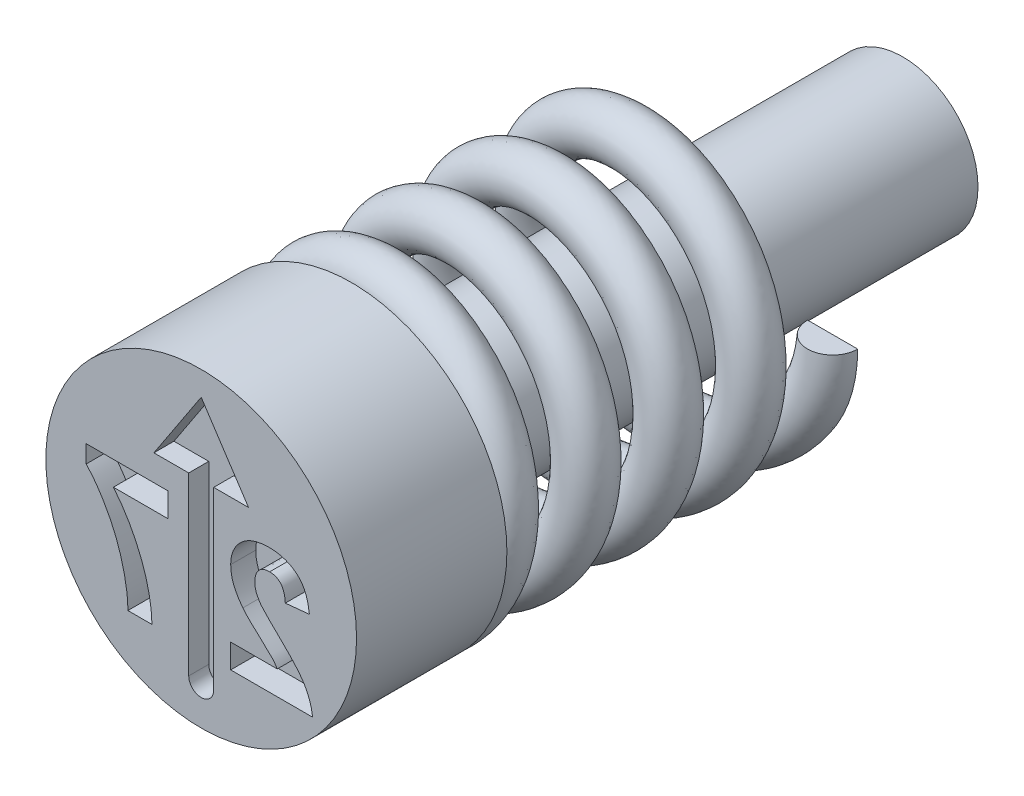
ISO-10303-21;
HEADER;
FILE_DESCRIPTION(('STEP AP214'),'2;1');
FILE_NAME('part.step','',(''),(''),'','','');
FILE_SCHEMA(('AUTOMOTIVE_DESIGN { 1 0 10303 214 1 1 1 1 }'));
ENDSEC;
DATA;
#1=APPLICATION_CONTEXT('core data for automotive mechanical design processes');
#2=APPLICATION_PROTOCOL_DEFINITION('international standard','automotive_design',2000,#1);
#3=PRODUCT_CONTEXT('',#1,'mechanical');
#4=PRODUCT('Part','Part','',(#3));
#5=PRODUCT_RELATED_PRODUCT_CATEGORY('part','',(#4));
#6=PRODUCT_DEFINITION_FORMATION('','',#4);
#7=PRODUCT_DEFINITION_CONTEXT('part definition',#1,'design');
#8=PRODUCT_DEFINITION('design','',#6,#7);
#9=PRODUCT_DEFINITION_SHAPE('','',#8);
#10=(LENGTH_UNIT() NAMED_UNIT(*) SI_UNIT(.MILLI.,.METRE.));
#11=(NAMED_UNIT(*) PLANE_ANGLE_UNIT() SI_UNIT($,.RADIAN.));
#12=(NAMED_UNIT(*) SI_UNIT($,.STERADIAN.) SOLID_ANGLE_UNIT());
#13=UNCERTAINTY_MEASURE_WITH_UNIT(LENGTH_MEASURE(1.E-05),#10,'distance_accuracy_value','');
#14=(GEOMETRIC_REPRESENTATION_CONTEXT(3) GLOBAL_UNCERTAINTY_ASSIGNED_CONTEXT((#13)) GLOBAL_UNIT_ASSIGNED_CONTEXT((#10,
#11,#12)) REPRESENTATION_CONTEXT('',''));
#15=CARTESIAN_POINT('',(0.,0.,0.));
#16=DIRECTION('',(0.,0.,1.));
#17=DIRECTION('',(1.,0.,0.));
#18=AXIS2_PLACEMENT_3D('',#15,#16,#17);
#19=CARTESIAN_POINT('',(2.6,0.,-10.5));
#20=DIRECTION('',(0.,-1.,0.));
#21=DIRECTION('',(0.,0.,-1.));
#22=AXIS2_PLACEMENT_3D('',#19,#20,#21);
#23=PLANE('',#22);
#24=CARTESIAN_POINT('',(2.6,0.,-10.));
#25=DIRECTION('',(0.,1.,0.));
#26=DIRECTION('',(0.,0.,1.));
#27=AXIS2_PLACEMENT_3D('',#24,#25,#26);
#28=CIRCLE('',#27,0.5);
#29=CARTESIAN_POINT('',(2.1,0.,-10.));
#30=VERTEX_POINT('',#29);
#31=CARTESIAN_POINT('',(3.1,0.,-10.));
#32=VERTEX_POINT('',#31);
#33=EDGE_CURVE('E92',#30,#32,#28,.T.);
#34=ORIENTED_EDGE('',*,*,#33,.T.);
#35=DIRECTION('',(-1.,0.,0.));
#36=VECTOR('',#35,1.);
#37=CARTESIAN_POINT('',(2.6,0.,-10.));
#38=LINE('',#37,#36);
#39=EDGE_CURVE('E79',#32,#30,#38,.T.);
#40=ORIENTED_EDGE('',*,*,#39,.T.);
#41=EDGE_LOOP('',(#34,#40));
#42=FACE_BOUND('',#41,.T.);
#43=ADVANCED_FACE('F53',(#42),#23,.F.);
#44=CARTESIAN_POINT('',(0.,-2.6,-3.5));
#45=DIRECTION('',(-1.,0.,0.));
#46=DIRECTION('',(0.,-1.,0.));
#47=AXIS2_PLACEMENT_3D('',#44,#45,#46);
#48=PLANE('',#47);
#49=DIRECTION('',(0.,-1.,0.));
#50=VECTOR('',#49,1.);
#51=CARTESIAN_POINT('',(0.,-2.6,-3.));
#52=LINE('',#51,#50);
#53=CARTESIAN_POINT('',(0.,-2.1,-3.));
#54=VERTEX_POINT('',#53);
#55=CARTESIAN_POINT('',(0.,-3.1,-3.));
#56=VERTEX_POINT('',#55);
#57=EDGE_CURVE('E73',#54,#56,#52,.T.);
#58=ORIENTED_EDGE('',*,*,#57,.F.);
#59=CARTESIAN_POINT('',(0.,-2.6,-3.));
#60=DIRECTION('',(-1.,0.,0.));
#61=DIRECTION('',(0.,-1.,0.));
#62=AXIS2_PLACEMENT_3D('',#59,#60,#61);
#63=CIRCLE('',#62,0.5);
#64=EDGE_CURVE('E89',#54,#56,#63,.T.);
#65=ORIENTED_EDGE('',*,*,#64,.T.);
#66=EDGE_LOOP('',(#58,#65));
#67=FACE_BOUND('',#66,.T.);
#68=ADVANCED_FACE('F55',(#67),#48,.T.);
#69=CARTESIAN_POINT('',(2.6,0.,-9.5));
#70=CARTESIAN_POINT('',(2.6,-1.07695526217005,-9.39705882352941));
#71=CARTESIAN_POINT('',(1.83847763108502,-1.83847763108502,-9.29411764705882));
#72=CARTESIAN_POINT('',(1.07695526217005,-2.6,-9.19117647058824));
#73=CARTESIAN_POINT('',(0.,-2.6,-9.08823529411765));
#74=CARTESIAN_POINT('',(-1.07695526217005,-2.6,-8.98529411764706));
#75=CARTESIAN_POINT('',(-1.83847763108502,-1.83847763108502,-8.88235294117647));
#76=CARTESIAN_POINT('',(-2.6,-1.07695526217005,-8.77941176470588));
#77=CARTESIAN_POINT('',(-2.6,0.,-8.6764705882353));
#78=CARTESIAN_POINT('',(-2.6,1.07695526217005,-8.57352941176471));
#79=CARTESIAN_POINT('',(-1.83847763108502,1.83847763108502,-8.47058823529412));
#80=CARTESIAN_POINT('',(-1.07695526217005,2.6,-8.36764705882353));
#81=CARTESIAN_POINT('',(0.,2.6,-8.26470588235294));
#82=CARTESIAN_POINT('',(1.07695526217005,2.6,-8.16176470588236));
#83=CARTESIAN_POINT('',(1.83847763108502,1.83847763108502,-8.05882352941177));
#84=CARTESIAN_POINT('',(2.6,1.07695526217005,-7.95588235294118));
#85=CARTESIAN_POINT('',(2.6,0.,-7.85294117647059));
#86=CARTESIAN_POINT('',(2.6,-1.07695526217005,-7.75));
#87=CARTESIAN_POINT('',(1.83847763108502,-1.83847763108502,-7.64705882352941));
#88=CARTESIAN_POINT('',(1.07695526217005,-2.6,-7.54411764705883));
#89=CARTESIAN_POINT('',(0.,-2.6,-7.44117647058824));
#90=CARTESIAN_POINT('',(-1.07695526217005,-2.6,-7.33823529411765));
#91=CARTESIAN_POINT('',(-1.83847763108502,-1.83847763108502,-7.23529411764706));
#92=CARTESIAN_POINT('',(-2.6,-1.07695526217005,-7.13235294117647));
#93=CARTESIAN_POINT('',(-2.6,0.,-7.02941176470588));
#94=CARTESIAN_POINT('',(-2.6,1.07695526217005,-6.9264705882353));
#95=CARTESIAN_POINT('',(-1.83847763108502,1.83847763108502,-6.82352941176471));
#96=CARTESIAN_POINT('',(-1.07695526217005,2.6,-6.72058823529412));
#97=CARTESIAN_POINT('',(0.,2.6,-6.61764705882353));
#98=CARTESIAN_POINT('',(1.07695526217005,2.6,-6.51470588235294));
#99=CARTESIAN_POINT('',(1.83847763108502,1.83847763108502,-6.41176470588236));
#100=CARTESIAN_POINT('',(2.6,1.07695526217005,-6.30882352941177));
#101=CARTESIAN_POINT('',(2.6,0.,-6.20588235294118));
#102=CARTESIAN_POINT('',(2.6,-1.07695526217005,-6.10294117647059));
#103=CARTESIAN_POINT('',(1.83847763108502,-1.83847763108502,-6.));
#104=CARTESIAN_POINT('',(1.07695526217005,-2.6,-5.89705882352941));
#105=CARTESIAN_POINT('',(0.,-2.6,-5.79411764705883));
#106=CARTESIAN_POINT('',(-1.07695526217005,-2.6,-5.69117647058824));
#107=CARTESIAN_POINT('',(-1.83847763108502,-1.83847763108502,-5.58823529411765));
#108=CARTESIAN_POINT('',(-2.6,-1.07695526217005,-5.48529411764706));
#109=CARTESIAN_POINT('',(-2.6,0.,-5.38235294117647));
#110=CARTESIAN_POINT('',(-2.6,1.07695526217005,-5.27941176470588));
#111=CARTESIAN_POINT('',(-1.83847763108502,1.83847763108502,-5.1764705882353));
#112=CARTESIAN_POINT('',(-1.07695526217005,2.6,-5.07352941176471));
#113=CARTESIAN_POINT('',(0.,2.6,-4.97058823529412));
#114=CARTESIAN_POINT('',(1.07695526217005,2.6,-4.86764705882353));
#115=CARTESIAN_POINT('',(1.83847763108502,1.83847763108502,-4.76470588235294));
#116=CARTESIAN_POINT('',(2.6,1.07695526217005,-4.66176470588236));
#117=CARTESIAN_POINT('',(2.6,0.,-4.55882352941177));
#118=CARTESIAN_POINT('',(2.6,-1.07695526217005,-4.45588235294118));
#119=CARTESIAN_POINT('',(1.83847763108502,-1.83847763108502,-4.35294117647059));
#120=CARTESIAN_POINT('',(1.07695526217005,-2.6,-4.25));
#121=CARTESIAN_POINT('',(0.,-2.6,-4.14705882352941));
#122=CARTESIAN_POINT('',(-1.07695526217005,-2.6,-4.04411764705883));
#123=CARTESIAN_POINT('',(-1.83847763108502,-1.83847763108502,-3.94117647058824));
#124=CARTESIAN_POINT('',(-2.6,-1.07695526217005,-3.83823529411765));
#125=CARTESIAN_POINT('',(-2.6,0.,-3.73529411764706));
#126=CARTESIAN_POINT('',(-2.6,1.07695526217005,-3.63235294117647));
#127=CARTESIAN_POINT('',(-1.83847763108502,1.83847763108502,-3.52941176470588));
#128=CARTESIAN_POINT('',(-1.07695526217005,2.6,-3.4264705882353));
#129=CARTESIAN_POINT('',(0.,2.6,-3.32352941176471));
#130=CARTESIAN_POINT('',(1.07695526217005,2.6,-3.22058823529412));
#131=CARTESIAN_POINT('',(1.83847763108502,1.83847763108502,-3.11764705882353));
#132=CARTESIAN_POINT('',(2.6,1.07695526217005,-3.01470588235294));
#133=CARTESIAN_POINT('',(2.6,0.,-2.91176470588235));
#134=CARTESIAN_POINT('',(2.6,-1.07695526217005,-2.80882352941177));
#135=CARTESIAN_POINT('',(1.83847763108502,-1.83847763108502,-2.70588235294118));
#136=CARTESIAN_POINT('',(1.07695526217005,-2.6,-2.60294117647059));
#137=CARTESIAN_POINT('',(0.,-2.6,-2.5));
#138=CARTESIAN_POINT('',(3.6,0.,-9.5));
#139=CARTESIAN_POINT('',(3.6,-1.49116882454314,-9.39705882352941));
#140=CARTESIAN_POINT('',(2.54558441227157,-2.54558441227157,-9.29411764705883));
#141=CARTESIAN_POINT('',(1.49116882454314,-3.6,-9.19117647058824));
#142=CARTESIAN_POINT('',(0.,-3.6,-9.08823529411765));
#143=CARTESIAN_POINT('',(-1.49116882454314,-3.6,-8.98529411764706));
#144=CARTESIAN_POINT('',(-2.54558441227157,-2.54558441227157,-8.88235294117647));
#145=CARTESIAN_POINT('',(-3.6,-1.49116882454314,-8.77941176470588));
#146=CARTESIAN_POINT('',(-3.6,0.,-8.6764705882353));
#147=CARTESIAN_POINT('',(-3.6,1.49116882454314,-8.57352941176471));
#148=CARTESIAN_POINT('',(-2.54558441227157,2.54558441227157,-8.47058823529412));
#149=CARTESIAN_POINT('',(-1.49116882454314,3.6,-8.36764705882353));
#150=CARTESIAN_POINT('',(0.,3.6,-8.26470588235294));
#151=CARTESIAN_POINT('',(1.49116882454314,3.6,-8.16176470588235));
#152=CARTESIAN_POINT('',(2.54558441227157,2.54558441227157,-8.05882352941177));
#153=CARTESIAN_POINT('',(3.6,1.49116882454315,-7.95588235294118));
#154=CARTESIAN_POINT('',(3.6,0.,-7.85294117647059));
#155=CARTESIAN_POINT('',(3.6,-1.49116882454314,-7.75));
#156=CARTESIAN_POINT('',(2.54558441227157,-2.54558441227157,-7.64705882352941));
#157=CARTESIAN_POINT('',(1.49116882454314,-3.6,-7.54411764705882));
#158=CARTESIAN_POINT('',(0.,-3.6,-7.44117647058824));
#159=CARTESIAN_POINT('',(-1.49116882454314,-3.6,-7.33823529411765));
#160=CARTESIAN_POINT('',(-2.54558441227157,-2.54558441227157,-7.23529411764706));
#161=CARTESIAN_POINT('',(-3.6,-1.49116882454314,-7.13235294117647));
#162=CARTESIAN_POINT('',(-3.6,0.,-7.02941176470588));
#163=CARTESIAN_POINT('',(-3.6,1.49116882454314,-6.92647058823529));
#164=CARTESIAN_POINT('',(-2.54558441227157,2.54558441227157,-6.82352941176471));
#165=CARTESIAN_POINT('',(-1.49116882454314,3.6,-6.72058823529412));
#166=CARTESIAN_POINT('',(0.,3.6,-6.61764705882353));
#167=CARTESIAN_POINT('',(1.49116882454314,3.6,-6.51470588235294));
#168=CARTESIAN_POINT('',(2.54558441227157,2.54558441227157,-6.41176470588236));
#169=CARTESIAN_POINT('',(3.6,1.49116882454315,-6.30882352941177));
#170=CARTESIAN_POINT('',(3.6,0.,-6.20588235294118));
#171=CARTESIAN_POINT('',(3.6,-1.49116882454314,-6.10294117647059));
#172=CARTESIAN_POINT('',(2.54558441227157,-2.54558441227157,-6.));
#173=CARTESIAN_POINT('',(1.49116882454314,-3.6,-5.89705882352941));
#174=CARTESIAN_POINT('',(0.,-3.6,-5.79411764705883));
#175=CARTESIAN_POINT('',(-1.49116882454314,-3.6,-5.69117647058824));
#176=CARTESIAN_POINT('',(-2.54558441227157,-2.54558441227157,-5.58823529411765));
#177=CARTESIAN_POINT('',(-3.6,-1.49116882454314,-5.48529411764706));
#178=CARTESIAN_POINT('',(-3.6,0.,-5.38235294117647));
#179=CARTESIAN_POINT('',(-3.6,1.49116882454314,-5.27941176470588));
#180=CARTESIAN_POINT('',(-2.54558441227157,2.54558441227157,-5.1764705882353));
#181=CARTESIAN_POINT('',(-1.49116882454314,3.6,-5.07352941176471));
#182=CARTESIAN_POINT('',(0.,3.6,-4.97058823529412));
#183=CARTESIAN_POINT('',(1.49116882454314,3.6,-4.86764705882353));
#184=CARTESIAN_POINT('',(2.54558441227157,2.54558441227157,-4.76470588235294));
#185=CARTESIAN_POINT('',(3.6,1.49116882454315,-4.66176470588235));
#186=CARTESIAN_POINT('',(3.6,0.,-4.55882352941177));
#187=CARTESIAN_POINT('',(3.6,-1.49116882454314,-4.45588235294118));
#188=CARTESIAN_POINT('',(2.54558441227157,-2.54558441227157,-4.35294117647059));
#189=CARTESIAN_POINT('',(1.49116882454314,-3.6,-4.25));
#190=CARTESIAN_POINT('',(0.,-3.6,-4.14705882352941));
#191=CARTESIAN_POINT('',(-1.49116882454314,-3.6,-4.04411764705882));
#192=CARTESIAN_POINT('',(-2.54558441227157,-2.54558441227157,-3.94117647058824));
#193=CARTESIAN_POINT('',(-3.6,-1.49116882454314,-3.83823529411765));
#194=CARTESIAN_POINT('',(-3.6,0.,-3.73529411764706));
#195=CARTESIAN_POINT('',(-3.6,1.49116882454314,-3.63235294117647));
#196=CARTESIAN_POINT('',(-2.54558441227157,2.54558441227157,-3.52941176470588));
#197=CARTESIAN_POINT('',(-1.49116882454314,3.6,-3.42647058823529));
#198=CARTESIAN_POINT('',(0.,3.6,-3.32352941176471));
#199=CARTESIAN_POINT('',(1.49116882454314,3.6,-3.22058823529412));
#200=CARTESIAN_POINT('',(2.54558441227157,2.54558441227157,-3.11764705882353));
#201=CARTESIAN_POINT('',(3.6,1.49116882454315,-3.01470588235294));
#202=CARTESIAN_POINT('',(3.6,0.,-2.91176470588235));
#203=CARTESIAN_POINT('',(3.6,-1.49116882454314,-2.80882352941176));
#204=CARTESIAN_POINT('',(2.54558441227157,-2.54558441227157,-2.70588235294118));
#205=CARTESIAN_POINT('',(1.49116882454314,-3.6,-2.60294117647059));
#206=CARTESIAN_POINT('',(0.,-3.6,-2.5));
#207=CARTESIAN_POINT('',(3.6,0.,-10.5));
#208=CARTESIAN_POINT('',(3.6,-1.49116882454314,-10.3970588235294));
#209=CARTESIAN_POINT('',(2.54558441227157,-2.54558441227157,-10.2941176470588));
#210=CARTESIAN_POINT('',(1.49116882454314,-3.6,-10.1911764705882));
#211=CARTESIAN_POINT('',(0.,-3.6,-10.0882352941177));
#212=CARTESIAN_POINT('',(-1.49116882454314,-3.6,-9.98529411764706));
#213=CARTESIAN_POINT('',(-2.54558441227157,-2.54558441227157,-9.88235294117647));
#214=CARTESIAN_POINT('',(-3.6,-1.49116882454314,-9.77941176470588));
#215=CARTESIAN_POINT('',(-3.6,0.,-9.6764705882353));
#216=CARTESIAN_POINT('',(-3.6,1.49116882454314,-9.57352941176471));
#217=CARTESIAN_POINT('',(-2.54558441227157,2.54558441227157,-9.47058823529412));
#218=CARTESIAN_POINT('',(-1.49116882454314,3.6,-9.36764705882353));
#219=CARTESIAN_POINT('',(0.,3.6,-9.26470588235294));
#220=CARTESIAN_POINT('',(1.49116882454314,3.6,-9.16176470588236));
#221=CARTESIAN_POINT('',(2.54558441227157,2.54558441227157,-9.05882352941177));
#222=CARTESIAN_POINT('',(3.6,1.49116882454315,-8.95588235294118));
#223=CARTESIAN_POINT('',(3.6,0.,-8.85294117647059));
#224=CARTESIAN_POINT('',(3.6,-1.49116882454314,-8.75));
#225=CARTESIAN_POINT('',(2.54558441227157,-2.54558441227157,-8.64705882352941));
#226=CARTESIAN_POINT('',(1.49116882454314,-3.6,-8.54411764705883));
#227=CARTESIAN_POINT('',(0.,-3.6,-8.44117647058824));
#228=CARTESIAN_POINT('',(-1.49116882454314,-3.6,-8.33823529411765));
#229=CARTESIAN_POINT('',(-2.54558441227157,-2.54558441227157,-8.23529411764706));
#230=CARTESIAN_POINT('',(-3.6,-1.49116882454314,-8.13235294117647));
#231=CARTESIAN_POINT('',(-3.6,0.,-8.02941176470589));
#232=CARTESIAN_POINT('',(-3.6,1.49116882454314,-7.9264705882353));
#233=CARTESIAN_POINT('',(-2.54558441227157,2.54558441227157,-7.82352941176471));
#234=CARTESIAN_POINT('',(-1.49116882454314,3.6,-7.72058823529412));
#235=CARTESIAN_POINT('',(0.,3.6,-7.61764705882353));
#236=CARTESIAN_POINT('',(1.49116882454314,3.6,-7.51470588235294));
#237=CARTESIAN_POINT('',(2.54558441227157,2.54558441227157,-7.41176470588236));
#238=CARTESIAN_POINT('',(3.6,1.49116882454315,-7.30882352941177));
#239=CARTESIAN_POINT('',(3.6,0.,-7.20588235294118));
#240=CARTESIAN_POINT('',(3.6,-1.49116882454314,-7.10294117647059));
#241=CARTESIAN_POINT('',(2.54558441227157,-2.54558441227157,-7.));
#242=CARTESIAN_POINT('',(1.49116882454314,-3.6,-6.89705882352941));
#243=CARTESIAN_POINT('',(0.,-3.6,-6.79411764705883));
#244=CARTESIAN_POINT('',(-1.49116882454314,-3.6,-6.69117647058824));
#245=CARTESIAN_POINT('',(-2.54558441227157,-2.54558441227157,-6.58823529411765));
#246=CARTESIAN_POINT('',(-3.6,-1.49116882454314,-6.48529411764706));
#247=CARTESIAN_POINT('',(-3.6,0.,-6.38235294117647));
#248=CARTESIAN_POINT('',(-3.6,1.49116882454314,-6.27941176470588));
#249=CARTESIAN_POINT('',(-2.54558441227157,2.54558441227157,-6.1764705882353));
#250=CARTESIAN_POINT('',(-1.49116882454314,3.6,-6.07352941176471));
#251=CARTESIAN_POINT('',(0.,3.6,-5.97058823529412));
#252=CARTESIAN_POINT('',(1.49116882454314,3.6,-5.86764705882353));
#253=CARTESIAN_POINT('',(2.54558441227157,2.54558441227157,-5.76470588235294));
#254=CARTESIAN_POINT('',(3.6,1.49116882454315,-5.66176470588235));
#255=CARTESIAN_POINT('',(3.6,0.,-5.55882352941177));
#256=CARTESIAN_POINT('',(3.6,-1.49116882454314,-5.45588235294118));
#257=CARTESIAN_POINT('',(2.54558441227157,-2.54558441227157,-5.35294117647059));
#258=CARTESIAN_POINT('',(1.49116882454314,-3.6,-5.25));
#259=CARTESIAN_POINT('',(0.,-3.6,-5.14705882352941));
#260=CARTESIAN_POINT('',(-1.49116882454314,-3.6,-5.04411764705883));
#261=CARTESIAN_POINT('',(-2.54558441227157,-2.54558441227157,-4.94117647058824));
#262=CARTESIAN_POINT('',(-3.6,-1.49116882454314,-4.83823529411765));
#263=CARTESIAN_POINT('',(-3.6,0.,-4.73529411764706));
#264=CARTESIAN_POINT('',(-3.6,1.49116882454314,-4.63235294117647));
#265=CARTESIAN_POINT('',(-2.54558441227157,2.54558441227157,-4.52941176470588));
#266=CARTESIAN_POINT('',(-1.49116882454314,3.6,-4.4264705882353));
#267=CARTESIAN_POINT('',(0.,3.6,-4.32352941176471));
#268=CARTESIAN_POINT('',(1.49116882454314,3.6,-4.22058823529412));
#269=CARTESIAN_POINT('',(2.54558441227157,2.54558441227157,-4.11764705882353));
#270=CARTESIAN_POINT('',(3.6,1.49116882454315,-4.01470588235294));
#271=CARTESIAN_POINT('',(3.6,0.,-3.91176470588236));
#272=CARTESIAN_POINT('',(3.6,-1.49116882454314,-3.80882352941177));
#273=CARTESIAN_POINT('',(2.54558441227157,-2.54558441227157,-3.70588235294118));
#274=CARTESIAN_POINT('',(1.49116882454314,-3.6,-3.60294117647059));
#275=CARTESIAN_POINT('',(0.,-3.6,-3.5));
#276=CARTESIAN_POINT('',(2.6,0.,-10.5));
#277=CARTESIAN_POINT('',(2.6,-1.07695526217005,-10.3970588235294));
#278=CARTESIAN_POINT('',(1.83847763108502,-1.83847763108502,-10.2941176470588));
#279=CARTESIAN_POINT('',(1.07695526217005,-2.6,-10.1911764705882));
#280=CARTESIAN_POINT('',(0.,-2.6,-10.0882352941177));
#281=CARTESIAN_POINT('',(-1.07695526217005,-2.6,-9.98529411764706));
#282=CARTESIAN_POINT('',(-1.83847763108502,-1.83847763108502,-9.88235294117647));
#283=CARTESIAN_POINT('',(-2.6,-1.07695526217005,-9.77941176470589));
#284=CARTESIAN_POINT('',(-2.6,0.,-9.6764705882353));
#285=CARTESIAN_POINT('',(-2.6,1.07695526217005,-9.57352941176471));
#286=CARTESIAN_POINT('',(-1.83847763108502,1.83847763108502,-9.47058823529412));
#287=CARTESIAN_POINT('',(-1.07695526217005,2.6,-9.36764705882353));
#288=CARTESIAN_POINT('',(0.,2.6,-9.26470588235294));
#289=CARTESIAN_POINT('',(1.07695526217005,2.6,-9.16176470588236));
#290=CARTESIAN_POINT('',(1.83847763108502,1.83847763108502,-9.05882352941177));
#291=CARTESIAN_POINT('',(2.6,1.07695526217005,-8.95588235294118));
#292=CARTESIAN_POINT('',(2.6,0.,-8.85294117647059));
#293=CARTESIAN_POINT('',(2.6,-1.07695526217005,-8.75));
#294=CARTESIAN_POINT('',(1.83847763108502,-1.83847763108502,-8.64705882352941));
#295=CARTESIAN_POINT('',(1.07695526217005,-2.6,-8.54411764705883));
#296=CARTESIAN_POINT('',(0.,-2.6,-8.44117647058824));
#297=CARTESIAN_POINT('',(-1.07695526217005,-2.6,-8.33823529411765));
#298=CARTESIAN_POINT('',(-1.83847763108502,-1.83847763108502,-8.23529411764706));
#299=CARTESIAN_POINT('',(-2.6,-1.07695526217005,-8.13235294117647));
#300=CARTESIAN_POINT('',(-2.6,0.,-8.02941176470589));
#301=CARTESIAN_POINT('',(-2.6,1.07695526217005,-7.9264705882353));
#302=CARTESIAN_POINT('',(-1.83847763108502,1.83847763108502,-7.82352941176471));
#303=CARTESIAN_POINT('',(-1.07695526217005,2.6,-7.72058823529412));
#304=CARTESIAN_POINT('',(0.,2.6,-7.61764705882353));
#305=CARTESIAN_POINT('',(1.07695526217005,2.6,-7.51470588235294));
#306=CARTESIAN_POINT('',(1.83847763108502,1.83847763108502,-7.41176470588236));
#307=CARTESIAN_POINT('',(2.6,1.07695526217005,-7.30882352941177));
#308=CARTESIAN_POINT('',(2.6,0.,-7.20588235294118));
#309=CARTESIAN_POINT('',(2.6,-1.07695526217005,-7.10294117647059));
#310=CARTESIAN_POINT('',(1.83847763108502,-1.83847763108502,-7.));
#311=CARTESIAN_POINT('',(1.07695526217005,-2.6,-6.89705882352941));
#312=CARTESIAN_POINT('',(0.,-2.6,-6.79411764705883));
#313=CARTESIAN_POINT('',(-1.07695526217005,-2.6,-6.69117647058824));
#314=CARTESIAN_POINT('',(-1.83847763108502,-1.83847763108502,-6.58823529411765));
#315=CARTESIAN_POINT('',(-2.6,-1.07695526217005,-6.48529411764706));
#316=CARTESIAN_POINT('',(-2.6,0.,-6.38235294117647));
#317=CARTESIAN_POINT('',(-2.6,1.07695526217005,-6.27941176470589));
#318=CARTESIAN_POINT('',(-1.83847763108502,1.83847763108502,-6.1764705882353));
#319=CARTESIAN_POINT('',(-1.07695526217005,2.6,-6.07352941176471));
#320=CARTESIAN_POINT('',(0.,2.6,-5.97058823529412));
#321=CARTESIAN_POINT('',(1.07695526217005,2.6,-5.86764705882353));
#322=CARTESIAN_POINT('',(1.83847763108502,1.83847763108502,-5.76470588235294));
#323=CARTESIAN_POINT('',(2.6,1.07695526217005,-5.66176470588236));
#324=CARTESIAN_POINT('',(2.6,0.,-5.55882352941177));
#325=CARTESIAN_POINT('',(2.6,-1.07695526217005,-5.45588235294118));
#326=CARTESIAN_POINT('',(1.83847763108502,-1.83847763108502,-5.35294117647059));
#327=CARTESIAN_POINT('',(1.07695526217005,-2.6,-5.25));
#328=CARTESIAN_POINT('',(0.,-2.6,-5.14705882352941));
#329=CARTESIAN_POINT('',(-1.07695526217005,-2.6,-5.04411764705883));
#330=CARTESIAN_POINT('',(-1.83847763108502,-1.83847763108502,-4.94117647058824));
#331=CARTESIAN_POINT('',(-2.6,-1.07695526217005,-4.83823529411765));
#332=CARTESIAN_POINT('',(-2.6,0.,-4.73529411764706));
#333=CARTESIAN_POINT('',(-2.6,1.07695526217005,-4.63235294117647));
#334=CARTESIAN_POINT('',(-1.83847763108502,1.83847763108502,-4.52941176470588));
#335=CARTESIAN_POINT('',(-1.07695526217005,2.6,-4.4264705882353));
#336=CARTESIAN_POINT('',(0.,2.6,-4.32352941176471));
#337=CARTESIAN_POINT('',(1.07695526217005,2.6,-4.22058823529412));
#338=CARTESIAN_POINT('',(1.83847763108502,1.83847763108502,-4.11764705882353));
#339=CARTESIAN_POINT('',(2.6,1.07695526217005,-4.01470588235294));
#340=CARTESIAN_POINT('',(2.6,0.,-3.91176470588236));
#341=CARTESIAN_POINT('',(2.6,-1.07695526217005,-3.80882352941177));
#342=CARTESIAN_POINT('',(1.83847763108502,-1.83847763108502,-3.70588235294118));
#343=CARTESIAN_POINT('',(1.07695526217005,-2.6,-3.60294117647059));
#344=CARTESIAN_POINT('',(0.,-2.6,-3.5));
#345=CARTESIAN_POINT('',(1.6,0.,-10.5));
#346=CARTESIAN_POINT('',(1.6,-0.662741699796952,-10.3970588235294));
#347=CARTESIAN_POINT('',(1.13137084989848,-1.13137084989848,-10.2941176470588));
#348=CARTESIAN_POINT('',(0.662741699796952,-1.6,-10.1911764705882));
#349=CARTESIAN_POINT('',(0.,-1.6,-10.0882352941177));
#350=CARTESIAN_POINT('',(-0.662741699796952,-1.6,-9.98529411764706));
#351=CARTESIAN_POINT('',(-1.13137084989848,-1.13137084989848,-9.88235294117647));
#352=CARTESIAN_POINT('',(-1.6,-0.662741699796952,-9.77941176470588));
#353=CARTESIAN_POINT('',(-1.6,0.,-9.6764705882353));
#354=CARTESIAN_POINT('',(-1.6,0.662741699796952,-9.57352941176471));
#355=CARTESIAN_POINT('',(-1.13137084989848,1.13137084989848,-9.47058823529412));
#356=CARTESIAN_POINT('',(-0.662741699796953,1.6,-9.36764705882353));
#357=CARTESIAN_POINT('',(0.,1.6,-9.26470588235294));
#358=CARTESIAN_POINT('',(0.662741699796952,1.6,-9.16176470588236));
#359=CARTESIAN_POINT('',(1.13137084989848,1.13137084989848,-9.05882352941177));
#360=CARTESIAN_POINT('',(1.6,0.662741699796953,-8.95588235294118));
#361=CARTESIAN_POINT('',(1.6,0.,-8.85294117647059));
#362=CARTESIAN_POINT('',(1.6,-0.662741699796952,-8.75));
#363=CARTESIAN_POINT('',(1.13137084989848,-1.13137084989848,-8.64705882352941));
#364=CARTESIAN_POINT('',(0.662741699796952,-1.6,-8.54411764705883));
#365=CARTESIAN_POINT('',(0.,-1.6,-8.44117647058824));
#366=CARTESIAN_POINT('',(-0.662741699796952,-1.6,-8.33823529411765));
#367=CARTESIAN_POINT('',(-1.13137084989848,-1.13137084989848,-8.23529411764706));
#368=CARTESIAN_POINT('',(-1.6,-0.662741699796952,-8.13235294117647));
#369=CARTESIAN_POINT('',(-1.6,0.,-8.02941176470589));
#370=CARTESIAN_POINT('',(-1.6,0.662741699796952,-7.9264705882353));
#371=CARTESIAN_POINT('',(-1.13137084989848,1.13137084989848,-7.82352941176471));
#372=CARTESIAN_POINT('',(-0.662741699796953,1.6,-7.72058823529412));
#373=CARTESIAN_POINT('',(0.,1.6,-7.61764705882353));
#374=CARTESIAN_POINT('',(0.662741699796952,1.6,-7.51470588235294));
#375=CARTESIAN_POINT('',(1.13137084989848,1.13137084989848,-7.41176470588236));
#376=CARTESIAN_POINT('',(1.6,0.662741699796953,-7.30882352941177));
#377=CARTESIAN_POINT('',(1.6,0.,-7.20588235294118));
#378=CARTESIAN_POINT('',(1.6,-0.662741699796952,-7.10294117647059));
#379=CARTESIAN_POINT('',(1.13137084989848,-1.13137084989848,-7.));
#380=CARTESIAN_POINT('',(0.662741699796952,-1.6,-6.89705882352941));
#381=CARTESIAN_POINT('',(0.,-1.6,-6.79411764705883));
#382=CARTESIAN_POINT('',(-0.662741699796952,-1.6,-6.69117647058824));
#383=CARTESIAN_POINT('',(-1.13137084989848,-1.13137084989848,-6.58823529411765));
#384=CARTESIAN_POINT('',(-1.6,-0.662741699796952,-6.48529411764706));
#385=CARTESIAN_POINT('',(-1.6,0.,-6.38235294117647));
#386=CARTESIAN_POINT('',(-1.6,0.662741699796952,-6.27941176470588));
#387=CARTESIAN_POINT('',(-1.13137084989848,1.13137084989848,-6.1764705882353));
#388=CARTESIAN_POINT('',(-0.662741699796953,1.6,-6.07352941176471));
#389=CARTESIAN_POINT('',(0.,1.6,-5.97058823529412));
#390=CARTESIAN_POINT('',(0.662741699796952,1.6,-5.86764705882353));
#391=CARTESIAN_POINT('',(1.13137084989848,1.13137084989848,-5.76470588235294));
#392=CARTESIAN_POINT('',(1.6,0.662741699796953,-5.66176470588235));
#393=CARTESIAN_POINT('',(1.6,0.,-5.55882352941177));
#394=CARTESIAN_POINT('',(1.6,-0.662741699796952,-5.45588235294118));
#395=CARTESIAN_POINT('',(1.13137084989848,-1.13137084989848,-5.35294117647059));
#396=CARTESIAN_POINT('',(0.662741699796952,-1.6,-5.25));
#397=CARTESIAN_POINT('',(0.,-1.6,-5.14705882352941));
#398=CARTESIAN_POINT('',(-0.662741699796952,-1.6,-5.04411764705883));
#399=CARTESIAN_POINT('',(-1.13137084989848,-1.13137084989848,-4.94117647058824));
#400=CARTESIAN_POINT('',(-1.6,-0.662741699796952,-4.83823529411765));
#401=CARTESIAN_POINT('',(-1.6,0.,-4.73529411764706));
#402=CARTESIAN_POINT('',(-1.6,0.662741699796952,-4.63235294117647));
#403=CARTESIAN_POINT('',(-1.13137084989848,1.13137084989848,-4.52941176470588));
#404=CARTESIAN_POINT('',(-0.662741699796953,1.6,-4.4264705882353));
#405=CARTESIAN_POINT('',(0.,1.6,-4.32352941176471));
#406=CARTESIAN_POINT('',(0.662741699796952,1.6,-4.22058823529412));
#407=CARTESIAN_POINT('',(1.13137084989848,1.13137084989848,-4.11764705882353));
#408=CARTESIAN_POINT('',(1.6,0.662741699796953,-4.01470588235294));
#409=CARTESIAN_POINT('',(1.6,0.,-3.91176470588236));
#410=CARTESIAN_POINT('',(1.6,-0.662741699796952,-3.80882352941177));
#411=CARTESIAN_POINT('',(1.13137084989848,-1.13137084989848,-3.70588235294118));
#412=CARTESIAN_POINT('',(0.662741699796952,-1.6,-3.60294117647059));
#413=CARTESIAN_POINT('',(0.,-1.6,-3.5));
#414=CARTESIAN_POINT('',(1.6,0.,-9.5));
#415=CARTESIAN_POINT('',(1.6,-0.662741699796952,-9.39705882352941));
#416=CARTESIAN_POINT('',(1.13137084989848,-1.13137084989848,-9.29411764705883));
#417=CARTESIAN_POINT('',(0.662741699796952,-1.6,-9.19117647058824));
#418=CARTESIAN_POINT('',(0.,-1.6,-9.08823529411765));
#419=CARTESIAN_POINT('',(-0.662741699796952,-1.6,-8.98529411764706));
#420=CARTESIAN_POINT('',(-1.13137084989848,-1.13137084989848,-8.88235294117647));
#421=CARTESIAN_POINT('',(-1.6,-0.662741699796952,-8.77941176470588));
#422=CARTESIAN_POINT('',(-1.6,0.,-8.6764705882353));
#423=CARTESIAN_POINT('',(-1.6,0.662741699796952,-8.57352941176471));
#424=CARTESIAN_POINT('',(-1.13137084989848,1.13137084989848,-8.47058823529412));
#425=CARTESIAN_POINT('',(-0.662741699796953,1.6,-8.36764705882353));
#426=CARTESIAN_POINT('',(0.,1.6,-8.26470588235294));
#427=CARTESIAN_POINT('',(0.662741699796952,1.6,-8.16176470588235));
#428=CARTESIAN_POINT('',(1.13137084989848,1.13137084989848,-8.05882352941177));
#429=CARTESIAN_POINT('',(1.6,0.662741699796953,-7.95588235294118));
#430=CARTESIAN_POINT('',(1.6,0.,-7.85294117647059));
#431=CARTESIAN_POINT('',(1.6,-0.662741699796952,-7.75));
#432=CARTESIAN_POINT('',(1.13137084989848,-1.13137084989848,-7.64705882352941));
#433=CARTESIAN_POINT('',(0.662741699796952,-1.6,-7.54411764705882));
#434=CARTESIAN_POINT('',(0.,-1.6,-7.44117647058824));
#435=CARTESIAN_POINT('',(-0.662741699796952,-1.6,-7.33823529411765));
#436=CARTESIAN_POINT('',(-1.13137084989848,-1.13137084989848,-7.23529411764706));
#437=CARTESIAN_POINT('',(-1.6,-0.662741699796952,-7.13235294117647));
#438=CARTESIAN_POINT('',(-1.6,0.,-7.02941176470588));
#439=CARTESIAN_POINT('',(-1.6,0.662741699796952,-6.92647058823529));
#440=CARTESIAN_POINT('',(-1.13137084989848,1.13137084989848,-6.82352941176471));
#441=CARTESIAN_POINT('',(-0.662741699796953,1.6,-6.72058823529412));
#442=CARTESIAN_POINT('',(0.,1.6,-6.61764705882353));
#443=CARTESIAN_POINT('',(0.662741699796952,1.6,-6.51470588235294));
#444=CARTESIAN_POINT('',(1.13137084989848,1.13137084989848,-6.41176470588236));
#445=CARTESIAN_POINT('',(1.6,0.662741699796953,-6.30882352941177));
#446=CARTESIAN_POINT('',(1.6,0.,-6.20588235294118));
#447=CARTESIAN_POINT('',(1.6,-0.662741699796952,-6.10294117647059));
#448=CARTESIAN_POINT('',(1.13137084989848,-1.13137084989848,-6.));
#449=CARTESIAN_POINT('',(0.662741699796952,-1.6,-5.89705882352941));
#450=CARTESIAN_POINT('',(0.,-1.6,-5.79411764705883));
#451=CARTESIAN_POINT('',(-0.662741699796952,-1.6,-5.69117647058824));
#452=CARTESIAN_POINT('',(-1.13137084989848,-1.13137084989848,-5.58823529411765));
#453=CARTESIAN_POINT('',(-1.6,-0.662741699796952,-5.48529411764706));
#454=CARTESIAN_POINT('',(-1.6,0.,-5.38235294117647));
#455=CARTESIAN_POINT('',(-1.6,0.662741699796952,-5.27941176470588));
#456=CARTESIAN_POINT('',(-1.13137084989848,1.13137084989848,-5.1764705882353));
#457=CARTESIAN_POINT('',(-0.662741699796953,1.6,-5.07352941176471));
#458=CARTESIAN_POINT('',(0.,1.6,-4.97058823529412));
#459=CARTESIAN_POINT('',(0.662741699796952,1.6,-4.86764705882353));
#460=CARTESIAN_POINT('',(1.13137084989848,1.13137084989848,-4.76470588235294));
#461=CARTESIAN_POINT('',(1.6,0.662741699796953,-4.66176470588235));
#462=CARTESIAN_POINT('',(1.6,0.,-4.55882352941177));
#463=CARTESIAN_POINT('',(1.6,-0.662741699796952,-4.45588235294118));
#464=CARTESIAN_POINT('',(1.13137084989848,-1.13137084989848,-4.35294117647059));
#465=CARTESIAN_POINT('',(0.662741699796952,-1.6,-4.25));
#466=CARTESIAN_POINT('',(0.,-1.6,-4.14705882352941));
#467=CARTESIAN_POINT('',(-0.662741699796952,-1.6,-4.04411764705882));
#468=CARTESIAN_POINT('',(-1.13137084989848,-1.13137084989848,-3.94117647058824));
#469=CARTESIAN_POINT('',(-1.6,-0.662741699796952,-3.83823529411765));
#470=CARTESIAN_POINT('',(-1.6,0.,-3.73529411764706));
#471=CARTESIAN_POINT('',(-1.6,0.662741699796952,-3.63235294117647));
#472=CARTESIAN_POINT('',(-1.13137084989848,1.13137084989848,-3.52941176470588));
#473=CARTESIAN_POINT('',(-0.662741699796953,1.6,-3.42647058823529));
#474=CARTESIAN_POINT('',(0.,1.6,-3.32352941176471));
#475=CARTESIAN_POINT('',(0.662741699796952,1.6,-3.22058823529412));
#476=CARTESIAN_POINT('',(1.13137084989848,1.13137084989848,-3.11764705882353));
#477=CARTESIAN_POINT('',(1.6,0.662741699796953,-3.01470588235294));
#478=CARTESIAN_POINT('',(1.6,0.,-2.91176470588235));
#479=CARTESIAN_POINT('',(1.6,-0.662741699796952,-2.80882352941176));
#480=CARTESIAN_POINT('',(1.13137084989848,-1.13137084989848,-2.70588235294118));
#481=CARTESIAN_POINT('',(0.662741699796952,-1.6,-2.60294117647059));
#482=CARTESIAN_POINT('',(0.,-1.6,-2.5));
#483=CARTESIAN_POINT('',(2.6,0.,-9.5));
#484=CARTESIAN_POINT('',(2.6,-1.07695526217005,-9.39705882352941));
#485=CARTESIAN_POINT('',(1.83847763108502,-1.83847763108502,-9.29411764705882));
#486=CARTESIAN_POINT('',(1.07695526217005,-2.6,-9.19117647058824));
#487=CARTESIAN_POINT('',(0.,-2.6,-9.08823529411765));
#488=CARTESIAN_POINT('',(-1.07695526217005,-2.6,-8.98529411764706));
#489=CARTESIAN_POINT('',(-1.83847763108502,-1.83847763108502,-8.88235294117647));
#490=CARTESIAN_POINT('',(-2.6,-1.07695526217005,-8.77941176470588));
#491=CARTESIAN_POINT('',(-2.6,0.,-8.6764705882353));
#492=CARTESIAN_POINT('',(-2.6,1.07695526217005,-8.57352941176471));
#493=CARTESIAN_POINT('',(-1.83847763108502,1.83847763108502,-8.47058823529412));
#494=CARTESIAN_POINT('',(-1.07695526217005,2.6,-8.36764705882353));
#495=CARTESIAN_POINT('',(0.,2.6,-8.26470588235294));
#496=CARTESIAN_POINT('',(1.07695526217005,2.6,-8.16176470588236));
#497=CARTESIAN_POINT('',(1.83847763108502,1.83847763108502,-8.05882352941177));
#498=CARTESIAN_POINT('',(2.6,1.07695526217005,-7.95588235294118));
#499=CARTESIAN_POINT('',(2.6,0.,-7.85294117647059));
#500=CARTESIAN_POINT('',(2.6,-1.07695526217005,-7.75));
#501=CARTESIAN_POINT('',(1.83847763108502,-1.83847763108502,-7.64705882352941));
#502=CARTESIAN_POINT('',(1.07695526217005,-2.6,-7.54411764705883));
#503=CARTESIAN_POINT('',(0.,-2.6,-7.44117647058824));
#504=CARTESIAN_POINT('',(-1.07695526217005,-2.6,-7.33823529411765));
#505=CARTESIAN_POINT('',(-1.83847763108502,-1.83847763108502,-7.23529411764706));
#506=CARTESIAN_POINT('',(-2.6,-1.07695526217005,-7.13235294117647));
#507=CARTESIAN_POINT('',(-2.6,0.,-7.02941176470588));
#508=CARTESIAN_POINT('',(-2.6,1.07695526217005,-6.9264705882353));
#509=CARTESIAN_POINT('',(-1.83847763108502,1.83847763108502,-6.82352941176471));
#510=CARTESIAN_POINT('',(-1.07695526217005,2.6,-6.72058823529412));
#511=CARTESIAN_POINT('',(0.,2.6,-6.61764705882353));
#512=CARTESIAN_POINT('',(1.07695526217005,2.6,-6.51470588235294));
#513=CARTESIAN_POINT('',(1.83847763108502,1.83847763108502,-6.41176470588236));
#514=CARTESIAN_POINT('',(2.6,1.07695526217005,-6.30882352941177));
#515=CARTESIAN_POINT('',(2.6,0.,-6.20588235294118));
#516=CARTESIAN_POINT('',(2.6,-1.07695526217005,-6.10294117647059));
#517=CARTESIAN_POINT('',(1.83847763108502,-1.83847763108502,-6.));
#518=CARTESIAN_POINT('',(1.07695526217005,-2.6,-5.89705882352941));
#519=CARTESIAN_POINT('',(0.,-2.6,-5.79411764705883));
#520=CARTESIAN_POINT('',(-1.07695526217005,-2.6,-5.69117647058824));
#521=CARTESIAN_POINT('',(-1.83847763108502,-1.83847763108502,-5.58823529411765));
#522=CARTESIAN_POINT('',(-2.6,-1.07695526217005,-5.48529411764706));
#523=CARTESIAN_POINT('',(-2.6,0.,-5.38235294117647));
#524=CARTESIAN_POINT('',(-2.6,1.07695526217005,-5.27941176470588));
#525=CARTESIAN_POINT('',(-1.83847763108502,1.83847763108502,-5.1764705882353));
#526=CARTESIAN_POINT('',(-1.07695526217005,2.6,-5.07352941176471));
#527=CARTESIAN_POINT('',(0.,2.6,-4.97058823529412));
#528=CARTESIAN_POINT('',(1.07695526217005,2.6,-4.86764705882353));
#529=CARTESIAN_POINT('',(1.83847763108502,1.83847763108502,-4.76470588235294));
#530=CARTESIAN_POINT('',(2.6,1.07695526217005,-4.66176470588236));
#531=CARTESIAN_POINT('',(2.6,0.,-4.55882352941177));
#532=CARTESIAN_POINT('',(2.6,-1.07695526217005,-4.45588235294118));
#533=CARTESIAN_POINT('',(1.83847763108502,-1.83847763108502,-4.35294117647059));
#534=CARTESIAN_POINT('',(1.07695526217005,-2.6,-4.25));
#535=CARTESIAN_POINT('',(0.,-2.6,-4.14705882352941));
#536=CARTESIAN_POINT('',(-1.07695526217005,-2.6,-4.04411764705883));
#537=CARTESIAN_POINT('',(-1.83847763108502,-1.83847763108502,-3.94117647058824));
#538=CARTESIAN_POINT('',(-2.6,-1.07695526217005,-3.83823529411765));
#539=CARTESIAN_POINT('',(-2.6,0.,-3.73529411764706));
#540=CARTESIAN_POINT('',(-2.6,1.07695526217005,-3.63235294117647));
#541=CARTESIAN_POINT('',(-1.83847763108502,1.83847763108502,-3.52941176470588));
#542=CARTESIAN_POINT('',(-1.07695526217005,2.6,-3.4264705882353));
#543=CARTESIAN_POINT('',(0.,2.6,-3.32352941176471));
#544=CARTESIAN_POINT('',(1.07695526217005,2.6,-3.22058823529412));
#545=CARTESIAN_POINT('',(1.83847763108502,1.83847763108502,-3.11764705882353));
#546=CARTESIAN_POINT('',(2.6,1.07695526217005,-3.01470588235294));
#547=CARTESIAN_POINT('',(2.6,0.,-2.91176470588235));
#548=CARTESIAN_POINT('',(2.6,-1.07695526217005,-2.80882352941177));
#549=CARTESIAN_POINT('',(1.83847763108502,-1.83847763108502,-2.70588235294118));
#550=CARTESIAN_POINT('',(1.07695526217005,-2.6,-2.60294117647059));
#551=CARTESIAN_POINT('',(0.,-2.6,-2.5));
#552=(BOUNDED_SURFACE() B_SPLINE_SURFACE(3,2,((#69,#70,#71,#72,#73,#74,#75,#76,#77,#78,#79,#80,
#81,#82,#83,#84,#85,#86,#87,#88,#89,#90,#91,#92,#93,#94,#95,#96,#97,#98,#99,#100,#101,#102,#103,
#104,#105,#106,#107,#108,#109,#110,#111,#112,#113,#114,#115,#116,#117,#118,#119,#120,#121,#122,
#123,#124,#125,#126,#127,#128,#129,#130,#131,#132,#133,#134,#135,#136,#137),(#138,#139,#140,
#141,#142,#143,#144,#145,#146,#147,#148,#149,#150,#151,#152,#153,#154,#155,#156,#157,#158,#159,
#160,#161,#162,#163,#164,#165,#166,#167,#168,#169,#170,#171,#172,#173,#174,#175,#176,#177,#178,
#179,#180,#181,#182,#183,#184,#185,#186,#187,#188,#189,#190,#191,#192,#193,#194,#195,#196,#197,
#198,#199,#200,#201,#202,#203,#204,#205,#206),(#207,#208,#209,#210,#211,#212,#213,#214,#215,
#216,#217,#218,#219,#220,#221,#222,#223,#224,#225,#226,#227,#228,#229,#230,#231,#232,#233,#234,
#235,#236,#237,#238,#239,#240,#241,#242,#243,#244,#245,#246,#247,#248,#249,#250,#251,#252,#253,
#254,#255,#256,#257,#258,#259,#260,#261,#262,#263,#264,#265,#266,#267,#268,#269,#270,#271,#272,
#273,#274,#275),(#276,#277,#278,#279,#280,#281,#282,#283,#284,#285,#286,#287,#288,#289,#290,
#291,#292,#293,#294,#295,#296,#297,#298,#299,#300,#301,#302,#303,#304,#305,#306,#307,#308,#309,
#310,#311,#312,#313,#314,#315,#316,#317,#318,#319,#320,#321,#322,#323,#324,#325,#326,#327,#328,
#329,#330,#331,#332,#333,#334,#335,#336,#337,#338,#339,#340,#341,#342,#343,#344),(#345,#346,
#347,#348,#349,#350,#351,#352,#353,#354,#355,#356,#357,#358,#359,#360,#361,#362,#363,#364,#365,
#366,#367,#368,#369,#370,#371,#372,#373,#374,#375,#376,#377,#378,#379,#380,#381,#382,#383,#384,
#385,#386,#387,#388,#389,#390,#391,#392,#393,#394,#395,#396,#397,#398,#399,#400,#401,#402,#403,
#404,#405,#406,#407,#408,#409,#410,#411,#412,#413),(#414,#415,#416,#417,#418,#419,#420,#421,
#422,#423,#424,#425,#426,#427,#428,#429,#430,#431,#432,#433,#434,#435,#436,#437,#438,#439,#440,
#441,#442,#443,#444,#445,#446,#447,#448,#449,#450,#451,#452,#453,#454,#455,#456,#457,#458,#459,
#460,#461,#462,#463,#464,#465,#466,#467,#468,#469,#470,#471,#472,#473,#474,#475,#476,#477,#478,
#479,#480,#481,#482),(#483,#484,#485,#486,#487,#488,#489,#490,#491,#492,#493,#494,#495,#496,
#497,#498,#499,#500,#501,#502,#503,#504,#505,#506,#507,#508,#509,#510,#511,#512,#513,#514,#515,
#516,#517,#518,#519,#520,#521,#522,#523,#524,#525,#526,#527,#528,#529,#530,#531,#532,#533,#534,
#535,#536,#537,#538,#539,#540,#541,#542,#543,#544,#545,#546,#547,#548,#549,#550,#551)),
.UNSPECIFIED.,.T.,.F.,.F.) B_SPLINE_SURFACE_WITH_KNOTS((4,3,4),(3,2,2,2,2,2,2,2,2,2,2,2,2,2,2,2,
2,2,2,2,2,2,2,2,2,2,2,2,2,2,2,2,2,2,3),(0.,0.5,1.),(0.,0.025,0.05,0.075,0.1,0.125,0.15,0.175,
0.2,0.225,0.25,0.275,0.3,0.325,0.35,0.375,0.4,0.425,0.45,0.475,0.5,0.525,0.55,0.575,0.6,0.625,
0.65,0.675,0.7,0.725,0.75,0.775,0.8,0.825,0.85),
.UNSPECIFIED.) GEOMETRIC_REPRESENTATION_ITEM() RATIONAL_B_SPLINE_SURFACE(((1.,0.923879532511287,
1.,0.923879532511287,1.,0.923879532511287,1.,0.923879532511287,1.,0.923879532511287,1.,
0.923879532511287,1.,0.923879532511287,1.,0.923879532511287,1.,0.923879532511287,1.,
0.923879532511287,1.,0.923879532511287,1.,0.923879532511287,1.,0.923879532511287,1.,
0.923879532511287,1.,0.923879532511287,1.,0.923879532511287,1.,0.923879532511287,1.,
0.923879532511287,1.,0.923879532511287,1.,0.923879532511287,1.,0.923879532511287,1.,
0.923879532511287,1.,0.923879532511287,1.,0.923879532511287,1.,0.923879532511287,1.,
0.923879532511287,1.,0.923879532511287,1.,0.923879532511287,1.,0.923879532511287,1.,
0.923879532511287,1.,0.923879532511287,1.,0.923879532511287,1.,0.923879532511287,1.,
0.923879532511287,1.),(0.333333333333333,0.307959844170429,0.333333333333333,0.307959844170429,
0.333333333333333,0.307959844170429,0.333333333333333,0.307959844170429,0.333333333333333,
0.307959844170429,0.333333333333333,0.307959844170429,0.333333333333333,0.307959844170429,
0.333333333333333,0.307959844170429,0.333333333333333,0.307959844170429,0.333333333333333,
0.307959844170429,0.333333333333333,0.307959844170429,0.333333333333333,0.307959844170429,
0.333333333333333,0.307959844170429,0.333333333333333,0.307959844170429,0.333333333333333,
0.307959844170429,0.333333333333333,0.307959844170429,0.333333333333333,0.307959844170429,
0.333333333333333,0.307959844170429,0.333333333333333,0.307959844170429,0.333333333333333,
0.307959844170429,0.333333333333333,0.307959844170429,0.333333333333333,0.307959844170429,
0.333333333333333,0.307959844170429,0.333333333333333,0.307959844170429,0.333333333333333,
0.307959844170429,0.333333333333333,0.307959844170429,0.333333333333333,0.307959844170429,
0.333333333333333,0.307959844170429,0.333333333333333,0.307959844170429,0.333333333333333,
0.307959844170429,0.333333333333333,0.307959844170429,0.333333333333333,0.307959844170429,
0.333333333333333,0.307959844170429,0.333333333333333,0.307959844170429,0.333333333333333),
(0.333333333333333,0.307959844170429,0.333333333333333,0.307959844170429,0.333333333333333,
0.307959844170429,0.333333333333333,0.307959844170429,0.333333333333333,0.307959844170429,
0.333333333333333,0.307959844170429,0.333333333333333,0.307959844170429,0.333333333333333,
0.307959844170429,0.333333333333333,0.307959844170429,0.333333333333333,0.307959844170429,
0.333333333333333,0.307959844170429,0.333333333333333,0.307959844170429,0.333333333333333,
0.307959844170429,0.333333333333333,0.307959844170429,0.333333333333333,0.307959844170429,
0.333333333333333,0.307959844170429,0.333333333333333,0.307959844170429,0.333333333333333,
0.307959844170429,0.333333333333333,0.307959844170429,0.333333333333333,0.307959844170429,
0.333333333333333,0.307959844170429,0.333333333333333,0.307959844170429,0.333333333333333,
0.307959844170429,0.333333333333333,0.307959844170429,0.333333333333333,0.307959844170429,
0.333333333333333,0.307959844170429,0.333333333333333,0.307959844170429,0.333333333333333,
0.307959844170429,0.333333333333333,0.307959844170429,0.333333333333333,0.307959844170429,
0.333333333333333,0.307959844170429,0.333333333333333,0.307959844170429,0.333333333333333,
0.307959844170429,0.333333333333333,0.307959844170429,0.333333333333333),(1.,0.923879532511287,
1.,0.923879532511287,1.,0.923879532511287,1.,0.923879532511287,1.,0.923879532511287,1.,
0.923879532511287,1.,0.923879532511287,1.,0.923879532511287,1.,0.923879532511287,1.,
0.923879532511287,1.,0.923879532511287,1.,0.923879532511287,1.,0.923879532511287,1.,
0.923879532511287,1.,0.923879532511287,1.,0.923879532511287,1.,0.923879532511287,1.,
0.923879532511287,1.,0.923879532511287,1.,0.923879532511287,1.,0.923879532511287,1.,
0.923879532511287,1.,0.923879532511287,1.,0.923879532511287,1.,0.923879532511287,1.,
0.923879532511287,1.,0.923879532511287,1.,0.923879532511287,1.,0.923879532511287,1.,
0.923879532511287,1.,0.923879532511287,1.,0.923879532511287,1.,0.923879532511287,1.,
0.923879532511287,1.),(0.333333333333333,0.307959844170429,0.333333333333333,0.307959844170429,
0.333333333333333,0.307959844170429,0.333333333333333,0.307959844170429,0.333333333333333,
0.307959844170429,0.333333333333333,0.307959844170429,0.333333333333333,0.307959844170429,
0.333333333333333,0.307959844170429,0.333333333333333,0.307959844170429,0.333333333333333,
0.307959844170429,0.333333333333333,0.307959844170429,0.333333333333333,0.307959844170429,
0.333333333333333,0.307959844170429,0.333333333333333,0.307959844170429,0.333333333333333,
0.307959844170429,0.333333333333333,0.307959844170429,0.333333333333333,0.307959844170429,
0.333333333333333,0.307959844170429,0.333333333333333,0.307959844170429,0.333333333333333,
0.307959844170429,0.333333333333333,0.307959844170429,0.333333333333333,0.307959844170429,
0.333333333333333,0.307959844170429,0.333333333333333,0.307959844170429,0.333333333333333,
0.307959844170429,0.333333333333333,0.307959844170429,0.333333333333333,0.307959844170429,
0.333333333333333,0.307959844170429,0.333333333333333,0.307959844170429,0.333333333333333,
0.307959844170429,0.333333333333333,0.307959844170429,0.333333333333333,0.307959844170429,
0.333333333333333,0.307959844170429,0.333333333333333,0.307959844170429,0.333333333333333),
(0.333333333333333,0.307959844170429,0.333333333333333,0.307959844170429,0.333333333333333,
0.307959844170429,0.333333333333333,0.307959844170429,0.333333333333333,0.307959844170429,
0.333333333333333,0.307959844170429,0.333333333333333,0.307959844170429,0.333333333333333,
0.307959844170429,0.333333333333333,0.307959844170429,0.333333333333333,0.307959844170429,
0.333333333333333,0.307959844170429,0.333333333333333,0.307959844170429,0.333333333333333,
0.307959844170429,0.333333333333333,0.307959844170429,0.333333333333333,0.307959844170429,
0.333333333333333,0.307959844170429,0.333333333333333,0.307959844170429,0.333333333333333,
0.307959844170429,0.333333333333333,0.307959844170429,0.333333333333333,0.307959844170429,
0.333333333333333,0.307959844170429,0.333333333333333,0.307959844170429,0.333333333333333,
0.307959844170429,0.333333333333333,0.307959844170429,0.333333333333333,0.307959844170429,
0.333333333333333,0.307959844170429,0.333333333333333,0.307959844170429,0.333333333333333,
0.307959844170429,0.333333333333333,0.307959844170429,0.333333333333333,0.307959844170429,
0.333333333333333,0.307959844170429,0.333333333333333,0.307959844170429,0.333333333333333,
0.307959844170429,0.333333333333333,0.307959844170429,0.333333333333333),(1.,0.923879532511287,
1.,0.923879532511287,1.,0.923879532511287,1.,0.923879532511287,1.,0.923879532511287,1.,
0.923879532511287,1.,0.923879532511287,1.,0.923879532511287,1.,0.923879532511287,1.,
0.923879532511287,1.,0.923879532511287,1.,0.923879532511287,1.,0.923879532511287,1.,
0.923879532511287,1.,0.923879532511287,1.,0.923879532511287,1.,0.923879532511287,1.,
0.923879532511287,1.,0.923879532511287,1.,0.923879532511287,1.,0.923879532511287,1.,
0.923879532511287,1.,0.923879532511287,1.,0.923879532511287,1.,0.923879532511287,1.,
0.923879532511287,1.,0.923879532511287,1.,0.923879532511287,1.,0.923879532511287,1.,
0.923879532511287,1.,0.923879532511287,1.,0.923879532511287,1.,0.923879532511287,1.,
0.923879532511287,1.))) REPRESENTATION_ITEM('') SURFACE());
#553=CARTESIAN_POINT('',(2.1,0.,-10.));
#554=CARTESIAN_POINT('',(2.09999840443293,-0.0632761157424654,-10.));
#555=CARTESIAN_POINT('',(2.09730667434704,-0.126518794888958,-10.));
#556=CARTESIAN_POINT('',(2.08660106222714,-0.252544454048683,-10.));
#557=CARTESIAN_POINT('',(2.07858784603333,-0.315327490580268,-10.));
#558=CARTESIAN_POINT('',(2.04668219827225,-0.502245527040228,-10.));
#559=CARTESIAN_POINT('',(2.0149234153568,-0.625130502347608,-10.));
#560=CARTESIAN_POINT('',(1.93148951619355,-0.86385654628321,-10.));
#561=CARTESIAN_POINT('',(1.87981156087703,-0.979696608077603,-10.));
#562=CARTESIAN_POINT('',(1.75794573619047,-1.20124694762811,-10.));
#563=CARTESIAN_POINT('',(1.68776849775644,-1.30696299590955,-10.));
#564=CARTESIAN_POINT('',(1.58960404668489,-1.43103861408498,-10.));
#565=CARTESIAN_POINT('',(1.56925631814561,-1.45566758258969,-10.));
#566=CARTESIAN_POINT('',(1.52753522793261,-1.50403899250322,-10.));
#567=CARTESIAN_POINT('',(1.50616207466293,-1.52778161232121,-10.));
#568=CARTESIAN_POINT('',(1.44063770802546,-1.59769397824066,-10.));
#569=CARTESIAN_POINT('',(1.3950809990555,-1.64254896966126,-10.));
#570=CARTESIAN_POINT('',(1.25321516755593,-1.77152030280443,-10.));
#571=CARTESIAN_POINT('',(1.15172123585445,-1.85002938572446,-10.));
#572=CARTESIAN_POINT('',(0.932558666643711,-1.99393274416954,-10.));
#573=CARTESIAN_POINT('',(0.814337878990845,-2.05848482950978,-9.99999999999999));
#574=CARTESIAN_POINT('',(0.630659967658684,-2.1408720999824,-10.));
#575=CARTESIAN_POINT('',(0.568340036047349,-2.16593756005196,-10.));
#576=CARTESIAN_POINT('',(0.441973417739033,-2.2112342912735,-9.99999999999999));
#577=CARTESIAN_POINT('',(0.377927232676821,-2.23146695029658,-9.99999999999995));
#578=CARTESIAN_POINT('',(0.256367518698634,-2.26495133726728,-9.99999999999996));
#579=CARTESIAN_POINT('',(0.199003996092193,-2.27875216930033,-9.99999999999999));
#580=CARTESIAN_POINT('',(0.112429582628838,-2.29672988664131,-10.));
#581=CARTESIAN_POINT('',(0.083495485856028,-2.30226678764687,-10.));
#582=CARTESIAN_POINT('',(0.0254657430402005,-2.31242692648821,-10.));
#583=CARTESIAN_POINT('',(-0.00362991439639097,-2.31705009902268,-10.));
#584=CARTESIAN_POINT('',(-0.0911039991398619,-2.32983349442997,-10.));
#585=CARTESIAN_POINT('',(-0.149642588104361,-2.33690227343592,-10.));
#586=CARTESIAN_POINT('',(-0.266956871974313,-2.34867515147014,-10.));
#587=CARTESIAN_POINT('',(-0.325732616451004,-2.35337872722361,-10.));
#588=CARTESIAN_POINT('',(-0.411207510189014,-2.35930299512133,-10.));
#589=CARTESIAN_POINT('',(-0.437876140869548,-2.36102197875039,-10.));
#590=CARTESIAN_POINT('',(-0.491223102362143,-2.36439879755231,-10.));
#591=CARTESIAN_POINT('',(-0.517901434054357,-2.36605662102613,-10.));
#592=CARTESIAN_POINT('',(-0.571255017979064,-2.36961561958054,-10.));
#593=CARTESIAN_POINT('',(-0.597930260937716,-2.37151692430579,-10.));
#594=CARTESIAN_POINT('',(-0.651213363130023,-2.37608500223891,-9.99999999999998));
#595=CARTESIAN_POINT('',(-0.677821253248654,-2.37875131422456,-9.99999999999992));
#596=CARTESIAN_POINT('',(-0.718988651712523,-2.38447387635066,-10.));
#597=CARTESIAN_POINT('',(-0.733639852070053,-2.38682841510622,-10.0000000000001));
#598=CARTESIAN_POINT('',(-0.762687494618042,-2.392632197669,-9.99999999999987));
#599=CARTESIAN_POINT('',(-0.777084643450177,-2.39607762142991,-9.99999999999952));
#600=CARTESIAN_POINT('',(-0.801636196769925,-2.40391093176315,-9.99999999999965));
#601=CARTESIAN_POINT('',(-0.811924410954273,-2.40782420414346,-9.99999999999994));
#602=CARTESIAN_POINT('',(-0.826652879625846,-2.41530157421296,-10.));
#603=CARTESIAN_POINT('',(-0.831474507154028,-2.41808577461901,-10.));
#604=CARTESIAN_POINT('',(-0.840606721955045,-2.42437761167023,-9.99999999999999));
#605=CARTESIAN_POINT('',(-0.844919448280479,-2.42788203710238,-9.99999999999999));
#606=CARTESIAN_POINT('',(-0.853185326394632,-2.43638619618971,-9.99999999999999));
#607=CARTESIAN_POINT('',(-0.857006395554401,-2.44152565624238,-10.));
#608=CARTESIAN_POINT('',(-0.862570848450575,-2.45290468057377,-10.));
#609=CARTESIAN_POINT('',(-0.864302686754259,-2.45915014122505,-10.));
#610=CARTESIAN_POINT('',(-0.865468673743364,-2.47133422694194,-10.));
#611=CARTESIAN_POINT('',(-0.865060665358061,-2.47726216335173,-10.));
#612=CARTESIAN_POINT('',(-0.862084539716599,-2.49339755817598,-10.));
#613=CARTESIAN_POINT('',(-0.858065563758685,-2.50328953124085,-9.99999999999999));
#614=CARTESIAN_POINT('',(-0.848026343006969,-2.52215780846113,-10.));
#615=CARTESIAN_POINT('',(-0.841954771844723,-2.5311019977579,-10.));
#616=CARTESIAN_POINT('',(-0.82871877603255,-2.54817385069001,-9.99999999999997));
#617=CARTESIAN_POINT('',(-0.821551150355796,-2.55629900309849,-9.99999999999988));
#618=CARTESIAN_POINT('',(-0.801822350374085,-2.57682454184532,-9.99999999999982));
#619=CARTESIAN_POINT('',(-0.788712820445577,-2.58868567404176,-9.99999999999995));
#620=CARTESIAN_POINT('',(-0.761492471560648,-2.61121319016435,-10.));
#621=CARTESIAN_POINT('',(-0.747379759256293,-2.62187721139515,-10.));
#622=CARTESIAN_POINT('',(-0.71842638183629,-2.6422872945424,-9.99999999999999));
#623=CARTESIAN_POINT('',(-0.703583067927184,-2.65202957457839,-10.));
#624=CARTESIAN_POINT('',(-0.67341450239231,-2.67069693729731,-10.));
#625=CARTESIAN_POINT('',(-0.658089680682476,-2.67962272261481,-10.));
#626=CARTESIAN_POINT('',(-0.608027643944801,-2.70729137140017,-10.));
#627=CARTESIAN_POINT('',(-0.572524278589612,-2.72465445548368,-10.));
#628=CARTESIAN_POINT('',(-0.500250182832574,-2.75655305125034,-10.));
#629=CARTESIAN_POINT('',(-0.463478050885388,-2.7710853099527,-10.));
#630=CARTESIAN_POINT('',(-0.389079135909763,-2.79759794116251,-10.));
#631=CARTESIAN_POINT('',(-0.351453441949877,-2.80958138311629,-10.));
#632=CARTESIAN_POINT('',(-0.275530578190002,-2.83121187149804,-10.));
#633=CARTESIAN_POINT('',(-0.237233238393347,-2.84085831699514,-10.));
#634=CARTESIAN_POINT('',(-0.166352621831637,-2.85656887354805,-10.));
#635=CARTESIAN_POINT('',(-0.133841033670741,-2.86295961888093,-10.));
#636=CARTESIAN_POINT('',(-0.0685616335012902,-2.8742236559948,-10.));
#637=CARTESIAN_POINT('',(-0.0357938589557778,-2.87909716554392,-10.));
#638=CARTESIAN_POINT('',(0.0299434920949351,-2.88744053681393,-10.));
#639=CARTESIAN_POINT('',(0.0629132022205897,-2.89090933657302,-10.));
#640=CARTESIAN_POINT('',(0.128963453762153,-2.896535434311,-9.99999999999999));
#641=CARTESIAN_POINT('',(0.162044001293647,-2.89869265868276,-9.99999999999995));
#642=CARTESIAN_POINT('',(0.261467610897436,-2.90319422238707,-10.0000000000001));
#643=CARTESIAN_POINT('',(0.327912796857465,-2.90355844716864,-10.0000000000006));
#644=CARTESIAN_POINT('',(0.460584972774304,-2.89915089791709,-9.99999999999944));
#645=CARTESIAN_POINT('',(0.526812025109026,-2.89438074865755,-9.99999999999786));
#646=CARTESIAN_POINT('',(0.727750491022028,-2.87218793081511,-9.99999999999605));
#647=CARTESIAN_POINT('',(0.861666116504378,-2.84675095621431,-9.99999999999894));
#648=CARTESIAN_POINT('',(1.12392249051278,-2.77606422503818,-10.0000000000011));
#649=CARTESIAN_POINT('',(1.25226741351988,-2.73082959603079,-10.0000000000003));
#650=CARTESIAN_POINT('',(1.51490649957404,-2.6157771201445,-9.99999999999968));
#651=CARTESIAN_POINT('',(1.64825695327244,-2.54377333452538,-9.99999999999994));
#652=CARTESIAN_POINT('',(1.83822060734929,-2.42049655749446,-10.));
#653=CARTESIAN_POINT('',(1.89990983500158,-2.37681831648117,-10.));
#654=CARTESIAN_POINT('',(2.01960990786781,-2.28465048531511,-9.99999999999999));
#655=CARTESIAN_POINT('',(2.07762067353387,-2.23616079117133,-10.));
#656=CARTESIAN_POINT('',(2.19199554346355,-2.13263933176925,-10.));
#657=CARTESIAN_POINT('',(2.24818787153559,-2.07741822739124,-10.));
#658=CARTESIAN_POINT('',(2.35598494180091,-1.96266474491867,-10.));
#659=CARTESIAN_POINT('',(2.40758948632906,-1.90313218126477,-10.));
#660=CARTESIAN_POINT('',(2.50584853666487,-1.78009428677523,-10.));
#661=CARTESIAN_POINT('',(2.55250246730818,-1.71658849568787,-10.));
#662=CARTESIAN_POINT('',(2.64055019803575,-1.58605530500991,-10.));
#663=CARTESIAN_POINT('',(2.68194412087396,-1.51902798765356,-9.99999999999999));
#664=CARTESIAN_POINT('',(2.8015127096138,-1.30673344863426,-9.99999999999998));
#665=CARTESIAN_POINT('',(2.87038954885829,-1.15608512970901,-10.));
#666=CARTESIAN_POINT('',(2.9818928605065,-0.845506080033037,-10.));
#667=CARTESIAN_POINT('',(3.02453703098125,-0.68558168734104,-10.));
#668=CARTESIAN_POINT('',(3.06905465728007,-0.43694393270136,-10.));
#669=CARTESIAN_POINT('',(3.08066807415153,-0.349874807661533,-10.));
#670=CARTESIAN_POINT('',(3.09613507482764,-0.175214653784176,-10.));
#671=CARTESIAN_POINT('',(3.10000320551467,-0.0876249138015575,-10.));
#672=CARTESIAN_POINT('',(3.1,0.,-10.));
#673=B_SPLINE_CURVE_WITH_KNOTS('',3,(#553,#554,#555,#556,#557,#558,#559,#560,#561,#562,#563,
#564,#565,#566,#567,#568,#569,#570,#571,#572,#573,#574,#575,#576,#577,#578,#579,#580,#581,#582,
#583,#584,#585,#586,#587,#588,#589,#590,#591,#592,#593,#594,#595,#596,#597,#598,#599,#600,#601,
#602,#603,#604,#605,#606,#607,#608,#609,#610,#611,#612,#613,#614,#615,#616,#617,#618,#619,#620,
#621,#622,#623,#624,#625,#626,#627,#628,#629,#630,#631,#632,#633,#634,#635,#636,#637,#638,#639,
#640,#641,#642,#643,#644,#645,#646,#647,#648,#649,#650,#651,#652,#653,#654,#655,#656,#657,#658,
#659,#660,#661,#662,#663,#664,#665,#666,#667,#668,#669,#670,#671,#672),.UNSPECIFIED.,.F.,.F.,(4,
2,2,2,2,2,2,2,2,2,2,2,2,2,2,2,2,2,2,2,2,2,2,2,2,2,2,2,2,2,2,2,2,2,2,2,2,2,2,2,2,2,2,2,2,2,2,2,2,
2,2,2,2,2,2,2,2,2,2,4),(0.,0.189706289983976,0.379388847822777,0.758217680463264,
1.13710052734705,1.51576611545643,1.61159327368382,1.70740103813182,1.89901374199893,
2.28229085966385,2.6845519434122,2.88590500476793,3.08720017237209,3.26407685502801,
3.35244120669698,3.44081187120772,3.61763550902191,3.7944982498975,3.87467097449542,
3.95485895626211,4.03508981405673,4.11527240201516,4.15976815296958,4.20410978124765,
4.23697678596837,4.25363171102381,4.2702139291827,4.28908801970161,4.30806594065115,
4.32566459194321,4.35715469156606,4.38949894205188,4.42193952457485,4.47485992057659,
4.52788299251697,4.58111495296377,4.63430066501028,4.75268934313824,4.87121327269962,
4.98959364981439,5.10800443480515,5.20736993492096,5.3067211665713,5.40614736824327,
5.50557914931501,5.70468344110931,5.90372474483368,6.31087899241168,6.71772267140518,
7.17013401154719,7.39670007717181,7.62327104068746,7.85936789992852,8.09547492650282,
8.33160935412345,8.56773827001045,9.06216685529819,9.55626150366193,9.81947471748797,
10.0821931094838),.UNSPECIFIED.);
#674=EDGE_CURVE('E67',#30,#32,#673,.T.);
#675=CARTESIAN_POINT('',(0.,-2.1,-3.));
#676=CARTESIAN_POINT('',(0.0632761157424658,-2.09999840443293,-3.));
#677=CARTESIAN_POINT('',(0.126518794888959,-2.09730667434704,-3.));
#678=CARTESIAN_POINT('',(0.252544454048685,-2.08660106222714,-3.));
#679=CARTESIAN_POINT('',(0.31532749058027,-2.07858784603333,-3.));
#680=CARTESIAN_POINT('',(0.502245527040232,-2.04668219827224,-3.));
#681=CARTESIAN_POINT('',(0.625130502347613,-2.0149234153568,-3.));
#682=CARTESIAN_POINT('',(0.863856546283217,-1.93148951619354,-3.));
#683=CARTESIAN_POINT('',(0.97969660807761,-1.87981156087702,-3.));
#684=CARTESIAN_POINT('',(1.20124694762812,-1.75794573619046,-3.));
#685=CARTESIAN_POINT('',(1.30696299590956,-1.68776849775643,-3.));
#686=CARTESIAN_POINT('',(1.43103861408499,-1.58960404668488,-3.));
#687=CARTESIAN_POINT('',(1.45566758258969,-1.5692563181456,-3.));
#688=CARTESIAN_POINT('',(1.50403899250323,-1.52753522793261,-3.));
#689=CARTESIAN_POINT('',(1.52778161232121,-1.50616207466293,-3.));
#690=CARTESIAN_POINT('',(1.59769397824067,-1.44063770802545,-3.));
#691=CARTESIAN_POINT('',(1.64254896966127,-1.3950809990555,-3.));
#692=CARTESIAN_POINT('',(1.77152030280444,-1.25321516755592,-3.));
#693=CARTESIAN_POINT('',(1.85002938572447,-1.15172123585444,-3.));
#694=CARTESIAN_POINT('',(1.99393274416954,-0.932558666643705,-3.00000000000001));
#695=CARTESIAN_POINT('',(2.05848482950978,-0.814337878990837,-3.00000000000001));
#696=CARTESIAN_POINT('',(2.1408720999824,-0.630659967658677,-3.));
#697=CARTESIAN_POINT('',(2.16593756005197,-0.568340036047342,-2.99999999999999));
#698=CARTESIAN_POINT('',(2.2112342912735,-0.441973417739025,-3.00000000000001));
#699=CARTESIAN_POINT('',(2.23146695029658,-0.377927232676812,-3.00000000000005));
#700=CARTESIAN_POINT('',(2.26495133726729,-0.256367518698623,-3.00000000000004));
#701=CARTESIAN_POINT('',(2.27875216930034,-0.19900399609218,-3.00000000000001));
#702=CARTESIAN_POINT('',(2.29672988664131,-0.112429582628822,-3.));
#703=CARTESIAN_POINT('',(2.30226678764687,-0.0834954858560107,-3.));
#704=CARTESIAN_POINT('',(2.31242692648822,-0.0254657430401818,-3.));
#705=CARTESIAN_POINT('',(2.31705009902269,0.00362991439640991,-3.));
#706=CARTESIAN_POINT('',(2.32983349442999,0.0911039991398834,-3.));
#707=CARTESIAN_POINT('',(2.33690227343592,0.149642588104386,-3.));
#708=CARTESIAN_POINT('',(2.34867515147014,0.266956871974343,-3.));
#709=CARTESIAN_POINT('',(2.35337872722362,0.325732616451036,-3.));
#710=CARTESIAN_POINT('',(2.35930299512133,0.411207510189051,-3.));
#711=CARTESIAN_POINT('',(2.36102197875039,0.437876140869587,-3.));
#712=CARTESIAN_POINT('',(2.36439879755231,0.491223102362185,-3.));
#713=CARTESIAN_POINT('',(2.36605662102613,0.517901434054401,-3.00000000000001));
#714=CARTESIAN_POINT('',(2.36961561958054,0.57125501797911,-3.));
#715=CARTESIAN_POINT('',(2.3715169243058,0.597930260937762,-2.99999999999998));
#716=CARTESIAN_POINT('',(2.37608500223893,0.651213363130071,-3.00000000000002));
#717=CARTESIAN_POINT('',(2.37875131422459,0.677821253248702,-3.00000000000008));
#718=CARTESIAN_POINT('',(2.38447387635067,0.718988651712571,-2.99999999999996));
#719=CARTESIAN_POINT('',(2.38682841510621,0.733639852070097,-2.99999999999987));
#720=CARTESIAN_POINT('',(2.39263219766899,0.76268749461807,-3.00000000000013));
#721=CARTESIAN_POINT('',(2.39607762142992,0.777084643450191,-3.00000000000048));
#722=CARTESIAN_POINT('',(2.40391093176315,0.801636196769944,-3.00000000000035));
#723=CARTESIAN_POINT('',(2.40782420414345,0.811924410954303,-3.00000000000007));
#724=CARTESIAN_POINT('',(2.41530157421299,0.826652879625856,-2.99999999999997));
#725=CARTESIAN_POINT('',(2.41808577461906,0.831474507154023,-2.99999999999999));
#726=CARTESIAN_POINT('',(2.42437761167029,0.84060672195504,-3.00000000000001));
#727=CARTESIAN_POINT('',(2.42788203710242,0.844919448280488,-3.00000000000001));
#728=CARTESIAN_POINT('',(2.43638619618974,0.853185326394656,-3.00000000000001));
#729=CARTESIAN_POINT('',(2.4415256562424,0.857006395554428,-3.00000000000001));
#730=CARTESIAN_POINT('',(2.4529046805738,0.862570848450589,-3.));
#731=CARTESIAN_POINT('',(2.45915014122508,0.864302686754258,-3.));
#732=CARTESIAN_POINT('',(2.47133422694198,0.865468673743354,-3.));
#733=CARTESIAN_POINT('',(2.47726216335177,0.865060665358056,-3.));
#734=CARTESIAN_POINT('',(2.49339755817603,0.862084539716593,-3.00000000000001));
#735=CARTESIAN_POINT('',(2.5032895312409,0.858065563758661,-3.00000000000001));
#736=CARTESIAN_POINT('',(2.52215780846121,0.848026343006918,-2.99999999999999));
#737=CARTESIAN_POINT('',(2.53110199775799,0.841954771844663,-2.99999999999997));
#738=CARTESIAN_POINT('',(2.54817385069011,0.828718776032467,-3.00000000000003));
#739=CARTESIAN_POINT('',(2.55629900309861,0.821551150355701,-3.00000000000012));
#740=CARTESIAN_POINT('',(2.57682454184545,0.801822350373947,-3.00000000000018));
#741=CARTESIAN_POINT('',(2.5886856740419,0.788712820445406,-3.00000000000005));
#742=CARTESIAN_POINT('',(2.61121319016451,0.761492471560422,-2.99999999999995));
#743=CARTESIAN_POINT('',(2.62187721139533,0.747379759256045,-2.99999999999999));
#744=CARTESIAN_POINT('',(2.6422872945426,0.718426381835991,-3.00000000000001));
#745=CARTESIAN_POINT('',(2.65202957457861,0.703583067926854,-3.));
#746=CARTESIAN_POINT('',(2.67069693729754,0.673414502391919,-3.));
#747=CARTESIAN_POINT('',(2.67962272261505,0.658089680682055,-3.));
#748=CARTESIAN_POINT('',(2.70729137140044,0.608027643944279,-3.));
#749=CARTESIAN_POINT('',(2.72465445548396,0.572524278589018,-3.));
#750=CARTESIAN_POINT('',(2.75655305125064,0.500250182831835,-3.));
#751=CARTESIAN_POINT('',(2.771085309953,0.463478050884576,-3.));
#752=CARTESIAN_POINT('',(2.79759794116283,0.389079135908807,-3.));
#753=CARTESIAN_POINT('',(2.8095813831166,0.351453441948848,-3.));
#754=CARTESIAN_POINT('',(2.83121187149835,0.275530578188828,-3.));
#755=CARTESIAN_POINT('',(2.84085831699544,0.237233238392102,-3.));
#756=CARTESIAN_POINT('',(2.85656887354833,0.166352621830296,-3.));
#757=CARTESIAN_POINT('',(2.86295961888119,0.133841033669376,-3.));
#758=CARTESIAN_POINT('',(2.87422365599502,0.0685616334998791,-3.));
#759=CARTESIAN_POINT('',(2.87909716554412,0.035793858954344,-3.));
#760=CARTESIAN_POINT('',(2.8874405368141,-0.0299434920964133,-3.));
#761=CARTESIAN_POINT('',(2.89090933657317,-0.0629132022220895,-2.99999999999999));
#762=CARTESIAN_POINT('',(2.89653543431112,-0.128963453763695,-3.00000000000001));
#763=CARTESIAN_POINT('',(2.89869265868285,-0.16204400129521,-3.00000000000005));
#764=CARTESIAN_POINT('',(2.9031942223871,-0.261467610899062,-2.9999999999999));
#765=CARTESIAN_POINT('',(2.90355844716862,-0.327912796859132,-2.99999999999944));
#766=CARTESIAN_POINT('',(2.89915089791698,-0.46058497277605,-3.00000000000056));
#767=CARTESIAN_POINT('',(2.8943807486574,-0.526812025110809,-3.00000000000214));
#768=CARTESIAN_POINT('',(2.87218793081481,-0.727750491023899,-3.00000000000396));
#769=CARTESIAN_POINT('',(2.8467509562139,-0.861666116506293,-3.00000000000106));
#770=CARTESIAN_POINT('',(2.77606422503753,-1.12392249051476,-2.99999999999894));
#771=CARTESIAN_POINT('',(2.73082959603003,-1.25226741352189,-2.99999999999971));
#772=CARTESIAN_POINT('',(2.6157771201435,-1.51490649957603,-3.00000000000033));
#773=CARTESIAN_POINT('',(2.54377333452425,-1.64825695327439,-3.00000000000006));
#774=CARTESIAN_POINT('',(2.42049655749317,-1.83822060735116,-2.99999999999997));
#775=CARTESIAN_POINT('',(2.37681831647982,-1.89990983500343,-2.99999999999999));
#776=CARTESIAN_POINT('',(2.28465048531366,-2.01960990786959,-3.00000000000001));
#777=CARTESIAN_POINT('',(2.23616079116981,-2.07762067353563,-3.));
#778=CARTESIAN_POINT('',(2.13263933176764,-2.19199554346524,-3.));
#779=CARTESIAN_POINT('',(2.07741822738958,-2.24818787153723,-3.));
#780=CARTESIAN_POINT('',(1.96266474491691,-2.35598494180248,-3.));
#781=CARTESIAN_POINT('',(1.90313218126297,-2.40758948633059,-3.));
#782=CARTESIAN_POINT('',(1.78009428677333,-2.5058485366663,-3.));
#783=CARTESIAN_POINT('',(1.71658849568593,-2.55250246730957,-3.));
#784=CARTESIAN_POINT('',(1.58605530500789,-2.64055019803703,-3.));
#785=CARTESIAN_POINT('',(1.5190279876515,-2.68194412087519,-3.00000000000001));
#786=CARTESIAN_POINT('',(1.30673344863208,-2.80151270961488,-3.00000000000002));
#787=CARTESIAN_POINT('',(1.15608512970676,-2.87038954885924,-3.));
#788=CARTESIAN_POINT('',(0.845506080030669,-2.98189286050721,-3.));
#789=CARTESIAN_POINT('',(0.685581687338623,-3.02453703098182,-3.));
#790=CARTESIAN_POINT('',(0.436943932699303,-3.06905465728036,-3.));
#791=CARTESIAN_POINT('',(0.349874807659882,-3.08066807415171,-3.));
#792=CARTESIAN_POINT('',(0.175214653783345,-3.09613507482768,-3.));
#793=CARTESIAN_POINT('',(0.0876249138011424,-3.10000320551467,-3.));
#794=CARTESIAN_POINT('',(0.,-3.1,-3.));
#795=B_SPLINE_CURVE_WITH_KNOTS('',3,(#675,#676,#677,#678,#679,#680,#681,#682,#683,#684,#685,
#686,#687,#688,#689,#690,#691,#692,#693,#694,#695,#696,#697,#698,#699,#700,#701,#702,#703,#704,
#705,#706,#707,#708,#709,#710,#711,#712,#713,#714,#715,#716,#717,#718,#719,#720,#721,#722,#723,
#724,#725,#726,#727,#728,#729,#730,#731,#732,#733,#734,#735,#736,#737,#738,#739,#740,#741,#742,
#743,#744,#745,#746,#747,#748,#749,#750,#751,#752,#753,#754,#755,#756,#757,#758,#759,#760,#761,
#762,#763,#764,#765,#766,#767,#768,#769,#770,#771,#772,#773,#774,#775,#776,#777,#778,#779,#780,
#781,#782,#783,#784,#785,#786,#787,#788,#789,#790,#791,#792,#793,#794),.UNSPECIFIED.,.F.,.F.,(4,
2,2,2,2,2,2,2,2,2,2,2,2,2,2,2,2,2,2,2,2,2,2,2,2,2,2,2,2,2,2,2,2,2,2,2,2,2,2,2,2,2,2,2,2,2,2,2,2,
2,2,2,2,2,2,2,2,2,2,4),(0.,0.189706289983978,0.37938884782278,0.75821768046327,1.13710052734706,
1.51576611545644,1.61159327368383,1.70740103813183,1.89901374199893,2.28229085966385,
2.68455194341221,2.88590500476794,3.0872001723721,3.26407685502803,3.352441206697,
3.44081187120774,3.61763550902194,3.79449824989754,3.87467097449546,3.95485895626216,
4.03508981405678,4.11527240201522,4.15976815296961,4.20410978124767,4.2369767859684,
4.25363171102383,4.27021392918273,4.28908801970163,4.30806594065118,4.32566459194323,
4.35715469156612,4.38949894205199,4.421939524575,4.47485992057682,4.52788299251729,
4.58111495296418,4.63430066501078,4.75268934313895,4.87121327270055,4.98959364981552,
5.10800443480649,5.20736993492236,5.30672116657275,5.40614736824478,5.50557914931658,
5.704683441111,5.90372474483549,6.31087899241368,6.71772267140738,7.17013401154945,
7.3967000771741,7.62327104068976,7.85936789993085,8.09547492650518,8.33160935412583,
8.56773827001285,9.06216685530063,9.55626150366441,9.8194747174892,10.0821931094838),.UNSPECIFIED.);
#796=EDGE_CURVE('E12',#54,#56,#795,.T.);
#797=ORIENTED_EDGE('',*,*,#33,.F.);
#798=ORIENTED_EDGE('',*,*,#674,.T.);
#799=EDGE_LOOP('',(#797,#798));
#800=FACE_BOUND('',#799,.T.);
#801=ORIENTED_EDGE('',*,*,#64,.F.);
#802=ORIENTED_EDGE('',*,*,#796,.T.);
#803=EDGE_LOOP('',(#801,#802));
#804=FACE_BOUND('',#803,.T.);
#805=ADVANCED_FACE('F91',(#800,#804),#552,.F.);
#806=CARTESIAN_POINT('',(-3.1,-3.1,-10.));
#807=DIRECTION('',(0.,0.,1.));
#808=DIRECTION('',(1.,0.,0.));
#809=AXIS2_PLACEMENT_3D('',#806,#807,#808);
#810=PLANE('',#809);
#811=ORIENTED_EDGE('',*,*,#674,.F.);
#812=ORIENTED_EDGE('',*,*,#39,.F.);
#813=EDGE_LOOP('',(#811,#812));
#814=FACE_BOUND('',#813,.T.);
#815=ADVANCED_FACE('F105',(#814),#810,.F.);
#816=CARTESIAN_POINT('',(3.1,-3.1,-3.));
#817=DIRECTION('',(0.,0.,-1.));
#818=DIRECTION('',(-1.,0.,0.));
#819=AXIS2_PLACEMENT_3D('',#816,#817,#818);
#820=PLANE('',#819);
#821=ORIENTED_EDGE('',*,*,#57,.T.);
#822=ORIENTED_EDGE('',*,*,#796,.F.);
#823=EDGE_LOOP('',(#821,#822));
#824=FACE_BOUND('',#823,.T.);
#825=ADVANCED_FACE('F84',(#824),#820,.F.);
#826=CLOSED_SHELL('',(#43,#68,#805,#815,#825));
#827=MANIFOLD_SOLID_BREP('B2',#826);
#828=CARTESIAN_POINT('',(0.,0.,0.));
#829=DIRECTION('',(0.,0.,1.));
#830=DIRECTION('',(1.,0.,0.));
#831=AXIS2_PLACEMENT_3D('',#828,#829,#830);
#832=PLANE('',#831);
#833=DIRECTION('',(1.,0.,0.));
#834=VECTOR('',#833,1.);
#835=CARTESIAN_POINT('',(-1.75178459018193,0.187179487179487,0.));
#836=LINE('',#835,#834);
#837=CARTESIAN_POINT('',(-1.75178459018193,0.187179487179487,0.));
#838=VERTEX_POINT('',#837);
#839=CARTESIAN_POINT('',(-0.661540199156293,0.187179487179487,0.));
#840=VERTEX_POINT('',#839);
#841=EDGE_CURVE('E180',#838,#840,#836,.T.);
#842=ORIENTED_EDGE('',*,*,#841,.F.);
#843=CARTESIAN_POINT('',(-0.982053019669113,-1.8,0.));
#844=CARTESIAN_POINT('',(-0.983660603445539,-1.75740949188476,0.));
#845=CARTESIAN_POINT('',(-0.986893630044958,-1.67175532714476,0.));
#846=CARTESIAN_POINT('',(-0.998989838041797,-1.54319122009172,0.));
#847=CARTESIAN_POINT('',(-1.01798823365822,-1.41414839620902,0.));
#848=CARTESIAN_POINT('',(-1.04158551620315,-1.28432861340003,0.));
#849=CARTESIAN_POINT('',(-1.07273981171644,-1.15404791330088,0.));
#850=CARTESIAN_POINT('',(-1.10829640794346,-1.02282369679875,0.));
#851=CARTESIAN_POINT('',(-1.15136787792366,-0.891356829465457,0.));
#852=CARTESIAN_POINT('',(-1.19964983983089,-0.759898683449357,0.));
#853=CARTESIAN_POINT('',(-1.25295058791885,-0.629697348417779,0.));
#854=CARTESIAN_POINT('',(-1.31104090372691,-0.50236774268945,0.));
#855=CARTESIAN_POINT('',(-1.37377061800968,-0.378704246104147,0.));
#856=CARTESIAN_POINT('',(-1.44032394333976,-0.258272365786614,0.));
#857=CARTESIAN_POINT('',(-1.51147513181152,-0.141459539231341,0.));
#858=CARTESIAN_POINT('',(-1.58727775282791,-0.0283926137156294,0.));
#859=CARTESIAN_POINT('',(-1.66665656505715,0.0817462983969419,0.));
#860=CARTESIAN_POINT('',(-1.72341336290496,0.152041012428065,0.));
#861=CARTESIAN_POINT('',(-1.75178459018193,0.187179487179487,0.));
#862=B_SPLINE_CURVE_WITH_KNOTS('',3,(#843,#844,#845,#846,#847,#848,#849,#850,#851,#852,#853,
#854,#855,#856,#857,#858,#859,#860,#861),.UNSPECIFIED.,.F.,.F.,(4,1,1,1,1,1,1,1,1,1,1,1,1,1,1,1,
4),(0.,0.0589531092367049,0.118561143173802,0.178522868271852,0.239353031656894,
0.301026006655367,0.363773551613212,0.427382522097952,0.492333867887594,0.557475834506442,
0.621960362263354,0.685889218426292,0.749254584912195,0.812267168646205,0.875035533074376,
0.937533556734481,1.),.UNSPECIFIED.);
#863=CARTESIAN_POINT('',(-0.982053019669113,-1.8,0.));
#864=VERTEX_POINT('',#863);
#865=EDGE_CURVE('E365',#864,#838,#862,.T.);
#866=ORIENTED_EDGE('',*,*,#865,.F.);
#867=DIRECTION('',(1.,0.,0.));
#868=VECTOR('',#867,1.);
#869=CARTESIAN_POINT('',(-1.46282225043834,-1.8,0.));
#870=LINE('',#869,#868);
#871=CARTESIAN_POINT('',(-1.46282225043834,-1.8,0.));
#872=VERTEX_POINT('',#871);
#873=EDGE_CURVE('E368',#872,#864,#870,.T.);
#874=ORIENTED_EDGE('',*,*,#873,.F.);
#875=CARTESIAN_POINT('',(-2.29615558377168,0.315384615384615,0.));
#876=CARTESIAN_POINT('',(-2.27910346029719,0.298034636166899,0.));
#877=CARTESIAN_POINT('',(-2.24404919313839,0.262368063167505,0.));
#878=CARTESIAN_POINT('',(-2.193837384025,0.203996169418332,0.));
#879=CARTESIAN_POINT('',(-2.14288161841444,0.140652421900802,0.));
#880=CARTESIAN_POINT('',(-2.09224743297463,0.0714832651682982,0.));
#881=CARTESIAN_POINT('',(-2.04036088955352,-0.00241865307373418,0.));
#882=CARTESIAN_POINT('',(-1.98950221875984,-0.0824699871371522,0.));
#883=CARTESIAN_POINT('',(-1.93792014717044,-0.16763223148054,0.));
#884=CARTESIAN_POINT('',(-1.8684743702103,-0.288094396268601,0.));
#885=CARTESIAN_POINT('',(-1.78730092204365,-0.445455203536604,0.));
#886=CARTESIAN_POINT('',(-1.70142370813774,-0.641062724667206,0.));
#887=CARTESIAN_POINT('',(-1.62826025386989,-0.842677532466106,0.));
#888=CARTESIAN_POINT('',(-1.5781611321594,-1.01446821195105,0.));
#889=CARTESIAN_POINT('',(-1.5443111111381,-1.15215817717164,0.));
#890=CARTESIAN_POINT('',(-1.52219514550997,-1.25284034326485,0.));
#891=CARTESIAN_POINT('',(-1.5035781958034,-1.35068918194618,0.));
#892=CARTESIAN_POINT('',(-1.48843331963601,-1.44587666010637,0.));
#893=CARTESIAN_POINT('',(-1.47713027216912,-1.5384462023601,0.));
#894=CARTESIAN_POINT('',(-1.46819893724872,-1.62807597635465,0.));
#895=CARTESIAN_POINT('',(-1.46379259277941,-1.7149845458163,0.));
#896=CARTESIAN_POINT('',(-1.46314239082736,-1.77195125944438,0.));
#897=CARTESIAN_POINT('',(-1.46282225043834,-1.8,0.));
#898=B_SPLINE_CURVE_WITH_KNOTS('',3,(#875,#876,#877,#878,#879,#880,#881,#882,#883,#884,#885,
#886,#887,#888,#889,#890,#891,#892,#893,#894,#895,#896,#897),.UNSPECIFIED.,.F.,.F.,(4,1,1,1,1,1,
1,1,1,1,1,1,1,1,1,1,1,1,1,1,4),(0.,0.0314272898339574,0.0646054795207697,0.0994393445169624,
0.136456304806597,0.175351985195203,0.216100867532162,0.258977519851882,0.304007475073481,
0.395756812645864,0.487615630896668,0.579873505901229,0.672707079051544,0.718694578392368,
0.76307923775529,0.80589344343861,0.847386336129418,0.88760014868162,0.926386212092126,
0.963754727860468,1.),.UNSPECIFIED.);
#899=CARTESIAN_POINT('',(-2.29615558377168,0.315384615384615,0.));
#900=VERTEX_POINT('',#899);
#901=EDGE_CURVE('E1033',#900,#872,#898,.T.);
#902=ORIENTED_EDGE('',*,*,#901,.F.);
#903=DIRECTION('',(0.,-1.,0.));
#904=VECTOR('',#903,1.);
#905=CARTESIAN_POINT('',(-2.29615558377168,0.667948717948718,0.));
#906=LINE('',#905,#904);
#907=CARTESIAN_POINT('',(-2.29615558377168,0.667948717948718,0.));
#908=VERTEX_POINT('',#907);
#909=EDGE_CURVE('E1030',#908,#900,#906,.T.);
#910=ORIENTED_EDGE('',*,*,#909,.F.);
#911=DIRECTION('',(-1.,0.,0.));
#912=VECTOR('',#911,1.);
#913=CARTESIAN_POINT('',(-0.661540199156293,0.667948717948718,0.));
#914=LINE('',#913,#912);
#915=CARTESIAN_POINT('',(-0.661540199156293,0.667948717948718,0.));
#916=VERTEX_POINT('',#915);
#917=EDGE_CURVE('E1027',#916,#908,#914,.T.);
#918=ORIENTED_EDGE('',*,*,#917,.F.);
#919=DIRECTION('',(0.,1.,0.));
#920=VECTOR('',#919,1.);
#921=CARTESIAN_POINT('',(-0.661540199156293,0.187179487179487,0.));
#922=LINE('',#921,#920);
#923=EDGE_CURVE('E1025',#840,#916,#922,.T.);
#924=ORIENTED_EDGE('',*,*,#923,.F.);
#925=EDGE_LOOP('',(#842,#866,#874,#902,#910,#918,#924));
#926=FACE_BOUND('',#925,.T.);
#927=DIRECTION('',(-1.,0.,0.));
#928=VECTOR('',#927,1.);
#929=CARTESIAN_POINT('',(1.51744617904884,-1.31923076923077,0.));
#930=LINE('',#929,#928);
#931=CARTESIAN_POINT('',(1.51744617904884,-1.31923076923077,0.));
#932=VERTEX_POINT('',#931);
#933=CARTESIAN_POINT('',(0.588459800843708,-1.31923076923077,0.));
#934=VERTEX_POINT('',#933);
#935=EDGE_CURVE('E188',#932,#934,#930,.T.);
#936=ORIENTED_EDGE('',*,*,#935,.F.);
#937=CARTESIAN_POINT('',(0.830847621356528,-0.607091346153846,0.));
#938=CARTESIAN_POINT('',(0.838451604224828,-0.616668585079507,0.));
#939=CARTESIAN_POINT('',(0.854737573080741,-0.637180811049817,0.));
#940=CARTESIAN_POINT('',(0.882444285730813,-0.668633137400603,0.));
#941=CARTESIAN_POINT('',(0.914553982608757,-0.702988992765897,0.));
#942=CARTESIAN_POINT('',(0.9506131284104,-0.740891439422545,0.));
#943=CARTESIAN_POINT('',(0.991812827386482,-0.780998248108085,0.));
#944=CARTESIAN_POINT('',(1.03667071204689,-0.824986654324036,0.));
#945=CARTESIAN_POINT('',(1.08716065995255,-0.870606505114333,0.));
#946=CARTESIAN_POINT('',(1.13945601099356,-0.918995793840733,0.));
#947=CARTESIAN_POINT('',(1.19197867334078,-0.966092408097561,0.));
#948=CARTESIAN_POINT('',(1.24025457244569,-1.01082375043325,0.));
#949=CARTESIAN_POINT('',(1.28410515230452,-1.05040138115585,0.));
#950=CARTESIAN_POINT('',(1.32148820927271,-1.08701016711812,0.));
#951=CARTESIAN_POINT('',(1.3546026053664,-1.11815158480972,0.));
#952=CARTESIAN_POINT('',(1.38225478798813,-1.14542253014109,0.));
#953=CARTESIAN_POINT('',(1.40496219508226,-1.16816279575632,0.));
#954=CARTESIAN_POINT('',(1.43625154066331,-1.20360910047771,0.));
#955=CARTESIAN_POINT('',(1.47606368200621,-1.25155024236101,0.));
#956=CARTESIAN_POINT('',(1.50407315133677,-1.2973593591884,0.));
#957=CARTESIAN_POINT('',(1.51744617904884,-1.31923076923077,0.));
#958=B_SPLINE_CURVE_WITH_KNOTS('',3,(#937,#938,#939,#940,#941,#942,#943,#944,#945,#946,#947,
#948,#949,#950,#951,#952,#953,#954,#955,#956,#957),.UNSPECIFIED.,.F.,.F.,(4,1,1,1,1,1,1,1,1,1,1,
1,1,1,1,1,1,1,4),(0.,0.0369753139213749,0.0791925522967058,0.126700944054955,0.179184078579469,
0.237368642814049,0.300558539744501,0.369153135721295,0.443112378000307,0.516018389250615,
0.582473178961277,0.642136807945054,0.694619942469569,0.740679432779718,0.779589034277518,
0.812073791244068,0.837814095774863,0.922564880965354,1.),.UNSPECIFIED.);
#959=CARTESIAN_POINT('',(0.830847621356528,-0.607091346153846,0.));
#960=VERTEX_POINT('',#959);
#961=EDGE_CURVE('E508',#960,#932,#958,.T.);
#962=ORIENTED_EDGE('',*,*,#961,.F.);
#963=CARTESIAN_POINT('',(0.588459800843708,0.0199118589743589,0.));
#964=CARTESIAN_POINT('',(0.589071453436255,-0.0073392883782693,0.));
#965=CARTESIAN_POINT('',(0.590284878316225,-0.0614013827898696,0.));
#966=CARTESIAN_POINT('',(0.601902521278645,-0.14132130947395,0.));
#967=CARTESIAN_POINT('',(0.619652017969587,-0.219398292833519,0.));
#968=CARTESIAN_POINT('',(0.645884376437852,-0.295823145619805,0.));
#969=CARTESIAN_POINT('',(0.679135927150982,-0.372429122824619,0.));
#970=CARTESIAN_POINT('',(0.72199797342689,-0.449388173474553,0.));
#971=CARTESIAN_POINT('',(0.771764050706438,-0.529021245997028,0.));
#972=CARTESIAN_POINT('',(0.810728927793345,-0.580507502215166,0.));
#973=CARTESIAN_POINT('',(0.830847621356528,-0.607091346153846,0.));
#974=B_SPLINE_CURVE_WITH_KNOTS('',3,(#963,#964,#965,#966,#967,#968,#969,#970,#971,#972,#973),
.UNSPECIFIED.,.F.,.F.,(4,1,1,1,1,1,1,1,4),(0.,0.119176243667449,0.236427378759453,
0.352663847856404,0.469086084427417,0.589462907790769,0.717601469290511,0.854189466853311,1.),.UNSPECIFIED.);
#975=CARTESIAN_POINT('',(0.588459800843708,0.0199118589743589,0.));
#976=VERTEX_POINT('',#975);
#977=EDGE_CURVE('E500',#976,#960,#974,.T.);
#978=ORIENTED_EDGE('',*,*,#977,.F.);
#979=CARTESIAN_POINT('',(1.35568736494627,0.7,0.));
#980=CARTESIAN_POINT('',(1.32661938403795,0.69944132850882,0.));
#981=CARTESIAN_POINT('',(1.27000584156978,0.698353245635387,0.));
#982=CARTESIAN_POINT('',(1.18736012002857,0.689367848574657,0.));
#983=CARTESIAN_POINT('',(1.10972040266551,0.673700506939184,0.));
#984=CARTESIAN_POINT('',(1.03640790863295,0.652946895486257,0.));
#985=CARTESIAN_POINT('',(0.968175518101,0.62523930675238,0.));
#986=CARTESIAN_POINT('',(0.904454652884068,0.591741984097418,0.));
#987=CARTESIAN_POINT('',(0.846248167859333,0.551183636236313,0.));
#988=CARTESIAN_POINT('',(0.792688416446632,0.505776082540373,0.));
#989=CARTESIAN_POINT('',(0.744810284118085,0.45584249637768,0.));
#990=CARTESIAN_POINT('',(0.702873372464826,0.402579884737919,0.));
#991=CARTESIAN_POINT('',(0.66773876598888,0.346025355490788,0.));
#992=CARTESIAN_POINT('',(0.638255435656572,0.286868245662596,0.));
#993=CARTESIAN_POINT('',(0.616364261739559,0.224156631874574,0.));
#994=CARTESIAN_POINT('',(0.600413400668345,0.158757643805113,0.));
#995=CARTESIAN_POINT('',(0.589837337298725,0.0903661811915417,0.));
#996=CARTESIAN_POINT('',(0.588924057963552,0.0436563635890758,0.));
#997=CARTESIAN_POINT('',(0.588459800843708,0.0199118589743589,0.));
#998=B_SPLINE_CURVE_WITH_KNOTS('',3,(#979,#980,#981,#982,#983,#984,#985,#986,#987,#988,#989,
#990,#991,#992,#993,#994,#995,#996,#997),.UNSPECIFIED.,.F.,.F.,(4,1,1,1,1,1,1,1,1,1,1,1,1,1,1,1,
4),(0.,0.075672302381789,0.147381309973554,0.216084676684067,0.281698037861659,
0.345459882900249,0.407485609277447,0.46873129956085,0.529782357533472,0.590032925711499,
0.648548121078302,0.70595351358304,0.763101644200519,0.820289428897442,0.878479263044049,
0.938226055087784,1.),.UNSPECIFIED.);
#999=CARTESIAN_POINT('',(1.35568736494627,0.7,0.));
#1000=VERTEX_POINT('',#999);
#1001=EDGE_CURVE('E492',#1000,#976,#998,.T.);
#1002=ORIENTED_EDGE('',*,*,#1001,.F.);
#1003=CARTESIAN_POINT('',(2.15897262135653,-0.0542067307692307,0.));
#1004=CARTESIAN_POINT('',(2.15510731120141,-0.0217487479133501,0.));
#1005=CARTESIAN_POINT('',(2.14761309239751,0.0411820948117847,0.));
#1006=CARTESIAN_POINT('',(2.12891114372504,0.131572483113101,0.));
#1007=CARTESIAN_POINT('',(2.10522581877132,0.214961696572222,0.));
#1008=CARTESIAN_POINT('',(2.0754279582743,0.291194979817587,0.));
#1009=CARTESIAN_POINT('',(2.04074914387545,0.360757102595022,0.));
#1010=CARTESIAN_POINT('',(1.99942046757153,0.422604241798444,0.));
#1011=CARTESIAN_POINT('',(1.95288599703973,0.477421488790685,0.));
#1012=CARTESIAN_POINT('',(1.90110551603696,0.525179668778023,0.));
#1013=CARTESIAN_POINT('',(1.84440820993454,0.566030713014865,0.));
#1014=CARTESIAN_POINT('',(1.78491456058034,0.602496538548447,0.));
#1015=CARTESIAN_POINT('',(1.72146189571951,0.632410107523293,0.));
#1016=CARTESIAN_POINT('',(1.65474883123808,0.657063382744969,0.));
#1017=CARTESIAN_POINT('',(1.58480551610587,0.676766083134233,0.));
#1018=CARTESIAN_POINT('',(1.51130845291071,0.689793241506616,0.));
#1019=CARTESIAN_POINT('',(1.43471123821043,0.69895659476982,0.));
#1020=CARTESIAN_POINT('',(1.38242565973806,0.699646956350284,0.));
#1021=CARTESIAN_POINT('',(1.35568736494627,0.7,0.));
#1022=B_SPLINE_CURVE_WITH_KNOTS('',3,(#1003,#1004,#1005,#1006,#1007,#1008,#1009,#1010,#1011,
#1012,#1013,#1014,#1015,#1016,#1017,#1018,#1019,#1020,#1021),.UNSPECIFIED.,.F.,.F.,(4,1,1,1,1,1,
1,1,1,1,1,1,1,1,1,1,4),(0.,0.0794357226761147,0.154013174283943,0.224141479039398,
0.289934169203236,0.352732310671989,0.41272577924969,0.470302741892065,0.527168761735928,
0.583502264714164,0.639948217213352,0.696584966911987,0.753726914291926,0.812707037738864,
0.872963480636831,0.93503486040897,1.),.UNSPECIFIED.);
#1023=CARTESIAN_POINT('',(2.15897262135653,-0.0542067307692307,0.));
#1024=VERTEX_POINT('',#1023);
#1025=EDGE_CURVE('E487',#1024,#1000,#1022,.T.);
#1026=ORIENTED_EDGE('',*,*,#1025,.F.);
#1027=DIRECTION('',(0.995240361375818,0.0974506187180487,0.));
#1028=VECTOR('',#1027,1.);
#1029=CARTESIAN_POINT('',(1.6782033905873,-0.101282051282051,0.));
#1030=LINE('',#1029,#1028);
#1031=CARTESIAN_POINT('',(1.6782033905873,-0.101282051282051,0.));
#1032=VERTEX_POINT('',#1031);
#1033=EDGE_CURVE('E481',#1032,#1024,#1030,.T.);
#1034=ORIENTED_EDGE('',*,*,#1033,.F.);
#1035=CARTESIAN_POINT('',(1.3657033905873,0.283333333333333,0.));
#1036=CARTESIAN_POINT('',(1.38750898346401,0.28234540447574,0.));
#1037=CARTESIAN_POINT('',(1.42963268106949,0.280436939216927,0.));
#1038=CARTESIAN_POINT('',(1.48949959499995,0.26376484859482,0.));
#1039=CARTESIAN_POINT('',(1.54187209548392,0.234903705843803,0.));
#1040=CARTESIAN_POINT('',(1.57919552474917,0.20201364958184,0.));
#1041=CARTESIAN_POINT('',(1.60440927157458,0.170030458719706,0.));
#1042=CARTESIAN_POINT('',(1.62158903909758,0.142159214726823,0.));
#1043=CARTESIAN_POINT('',(1.63639665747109,0.110488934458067,0.));
#1044=CARTESIAN_POINT('',(1.64951744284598,0.0753761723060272,0.));
#1045=CARTESIAN_POINT('',(1.65988137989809,0.0364186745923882,0.));
#1046=CARTESIAN_POINT('',(1.6682278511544,-0.00608685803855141,0.));
#1047=CARTESIAN_POINT('',(1.67495389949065,-0.0523691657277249,0.));
#1048=CARTESIAN_POINT('',(1.67709290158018,-0.0845664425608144,0.));
#1049=CARTESIAN_POINT('',(1.6782033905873,-0.101282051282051,0.));
#1050=B_SPLINE_CURVE_WITH_KNOTS('',3,(#1035,#1036,#1037,#1038,#1039,#1040,#1041,#1042,#1043,
#1044,#1045,#1046,#1047,#1048,#1049),.UNSPECIFIED.,.F.,.F.,(4,1,1,1,1,1,1,1,1,1,1,1,4),(0.,
0.116899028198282,0.225823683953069,0.330086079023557,0.435451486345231,0.490306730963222,
0.54824405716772,0.610766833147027,0.677675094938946,0.749188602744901,0.826858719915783,
0.910111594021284,1.),.UNSPECIFIED.);
#1051=CARTESIAN_POINT('',(1.3657033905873,0.283333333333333,0.));
#1052=VERTEX_POINT('',#1051);
#1053=EDGE_CURVE('E473',#1052,#1032,#1050,.T.);
#1054=ORIENTED_EDGE('',*,*,#1053,.F.);
#1055=CARTESIAN_POINT('',(1.06922903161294,-0.0446915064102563,0.));
#1056=CARTESIAN_POINT('',(1.07012944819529,-0.0197480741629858,0.));
#1057=CARTESIAN_POINT('',(1.0718329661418,0.0274429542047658,0.));
#1058=CARTESIAN_POINT('',(1.0861172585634,0.0940382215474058,0.));
#1059=CARTESIAN_POINT('',(1.11144813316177,0.151286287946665,0.));
#1060=CARTESIAN_POINT('',(1.14632408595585,0.19936287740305,0.));
#1061=CARTESIAN_POINT('',(1.19042479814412,0.237030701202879,0.));
#1062=CARTESIAN_POINT('',(1.24197981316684,0.264863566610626,0.));
#1063=CARTESIAN_POINT('',(1.30174381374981,0.280251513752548,0.));
#1064=CARTESIAN_POINT('',(1.34374947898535,0.2822755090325,0.));
#1065=CARTESIAN_POINT('',(1.3657033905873,0.283333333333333,0.));
#1066=B_SPLINE_CURVE_WITH_KNOTS('',3,(#1055,#1056,#1057,#1058,#1059,#1060,#1061,#1062,#1063,
#1064,#1065),.UNSPECIFIED.,.F.,.F.,(4,1,1,1,1,1,1,1,4),(0.,0.149140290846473,0.282161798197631,
0.40465570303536,0.521109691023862,0.634416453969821,0.748796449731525,0.868710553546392,1.),.UNSPECIFIED.);
#1067=CARTESIAN_POINT('',(1.06922903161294,-0.0446915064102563,0.));
#1068=VERTEX_POINT('',#1067);
#1069=EDGE_CURVE('E465',#1068,#1052,#1066,.T.);
#1070=ORIENTED_EDGE('',*,*,#1069,.F.);
#1071=CARTESIAN_POINT('',(1.16438127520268,-0.333653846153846,0.));
#1072=CARTESIAN_POINT('',(1.14990639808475,-0.30960952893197,0.));
#1073=CARTESIAN_POINT('',(1.12198603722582,-0.263230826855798,0.));
#1074=CARTESIAN_POINT('',(1.09136904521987,-0.190299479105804,0.));
#1075=CARTESIAN_POINT('',(1.07299158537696,-0.117383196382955,0.));
#1076=CARTESIAN_POINT('',(1.0704697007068,-0.0686609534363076,0.));
#1077=CARTESIAN_POINT('',(1.06922903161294,-0.0446915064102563,0.));
#1078=B_SPLINE_CURVE_WITH_KNOTS('',3,(#1071,#1072,#1073,#1074,#1075,#1076,#1077),.UNSPECIFIED.,
.F.,.F.,(4,1,1,1,4),(0.,0.272795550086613,0.526191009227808,0.766904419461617,1.),.UNSPECIFIED.);
#1079=CARTESIAN_POINT('',(1.16438127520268,-0.333653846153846,0.));
#1080=VERTEX_POINT('',#1079);
#1081=EDGE_CURVE('E457',#1080,#1068,#1078,.T.);
#1082=ORIENTED_EDGE('',*,*,#1081,.F.);
#1083=CARTESIAN_POINT('',(1.54699345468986,-0.737299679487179,0.));
#1084=CARTESIAN_POINT('',(1.52227588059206,-0.713440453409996,0.));
#1085=CARTESIAN_POINT('',(1.47522089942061,-0.668019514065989,0.));
#1086=CARTESIAN_POINT('',(1.4082145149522,-0.602978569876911,0.));
#1087=CARTESIAN_POINT('',(1.34930899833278,-0.543187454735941,0.));
#1088=CARTESIAN_POINT('',(1.29727271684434,-0.490195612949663,0.));
#1089=CARTESIAN_POINT('',(1.25330778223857,-0.442653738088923,0.));
#1090=CARTESIAN_POINT('',(1.21683587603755,-0.401308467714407,0.));
#1091=CARTESIAN_POINT('',(1.18739508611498,-0.365991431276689,0.));
#1092=CARTESIAN_POINT('',(1.17144992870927,-0.343586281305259,0.));
#1093=CARTESIAN_POINT('',(1.16438127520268,-0.333653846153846,0.));
#1094=B_SPLINE_CURVE_WITH_KNOTS('',3,(#1083,#1084,#1085,#1086,#1087,#1088,#1089,#1090,#1091,
#1092,#1093),.UNSPECIFIED.,.F.,.F.,(4,1,1,1,1,1,1,1,4),(0.,0.18509006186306,0.352356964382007,
0.503079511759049,0.637279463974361,0.752473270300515,0.851885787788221,0.934339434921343,1.),.UNSPECIFIED.);
#1095=CARTESIAN_POINT('',(1.54699345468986,-0.737299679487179,0.));
#1096=VERTEX_POINT('',#1095);
#1097=EDGE_CURVE('E449',#1096,#1080,#1094,.T.);
#1098=ORIENTED_EDGE('',*,*,#1097,.F.);
#1099=CARTESIAN_POINT('',(2.22307518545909,-1.8,0.));
#1100=CARTESIAN_POINT('',(2.21754075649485,-1.75891129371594,0.));
#1101=CARTESIAN_POINT('',(2.20647500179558,-1.67675692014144,0.));
#1102=CARTESIAN_POINT('',(2.17226364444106,-1.55675005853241,0.));
#1103=CARTESIAN_POINT('',(2.12660320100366,-1.43964386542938,0.));
#1104=CARTESIAN_POINT('',(2.07704746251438,-1.34434784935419,0.));
#1105=CARTESIAN_POINT('',(2.02775879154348,-1.26763783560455,0.));
#1106=CARTESIAN_POINT('',(1.98303917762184,-1.20478105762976,0.));
#1107=CARTESIAN_POINT('',(1.92969032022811,-1.13790414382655,0.));
#1108=CARTESIAN_POINT('',(1.86848636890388,-1.06646721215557,0.));
#1109=CARTESIAN_POINT('',(1.79976556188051,-0.99024695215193,0.));
#1110=CARTESIAN_POINT('',(1.72301519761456,-0.909526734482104,0.));
#1111=CARTESIAN_POINT('',(1.63786916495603,-0.824692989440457,0.));
#1112=CARTESIAN_POINT('',(1.57796741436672,-0.767086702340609,0.));
#1113=CARTESIAN_POINT('',(1.54699345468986,-0.737299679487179,0.));
#1114=B_SPLINE_CURVE_WITH_KNOTS('',3,(#1099,#1100,#1101,#1102,#1103,#1104,#1105,#1106,#1107,
#1108,#1109,#1110,#1111,#1112,#1113),.UNSPECIFIED.,.F.,.F.,(4,1,1,1,1,1,1,1,1,1,1,1,4),(0.,
0.0963574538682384,0.192660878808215,0.289454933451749,0.388479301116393,0.441921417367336,
0.501521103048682,0.567882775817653,0.640891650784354,0.72037065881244,0.806636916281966,
0.900015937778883,1.),.UNSPECIFIED.);
#1115=CARTESIAN_POINT('',(2.22307518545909,-1.8,0.));
#1116=VERTEX_POINT('',#1115);
#1117=EDGE_CURVE('E444',#1116,#1096,#1114,.T.);
#1118=ORIENTED_EDGE('',*,*,#1117,.F.);
#1119=DIRECTION('',(1.,0.,0.));
#1120=VECTOR('',#1119,1.);
#1121=CARTESIAN_POINT('',(0.588459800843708,-1.8,0.));
#1122=LINE('',#1121,#1120);
#1123=CARTESIAN_POINT('',(0.588459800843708,-1.8,0.));
#1124=VERTEX_POINT('',#1123);
#1125=EDGE_CURVE('E441',#1124,#1116,#1122,.T.);
#1126=ORIENTED_EDGE('',*,*,#1125,.F.);
#1127=DIRECTION('',(0.,-1.,0.));
#1128=VECTOR('',#1127,1.);
#1129=CARTESIAN_POINT('',(0.588459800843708,-1.31923076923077,0.));
#1130=LINE('',#1129,#1128);
#1131=EDGE_CURVE('E437',#934,#1124,#1130,.T.);
#1132=ORIENTED_EDGE('',*,*,#1131,.F.);
#1133=EDGE_LOOP('',(#936,#962,#978,#1002,#1026,#1034,#1054,#1070,#1082,#1098,#1118,#1126,#1132));
#1134=FACE_BOUND('',#1133,.T.);
#1135=DIRECTION('',(1.,0.,0.));
#1136=VECTOR('',#1135,1.);
#1137=CARTESIAN_POINT('',(0.249023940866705,1.18496091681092,0.));
#1138=LINE('',#1137,#1136);
#1139=CARTESIAN_POINT('',(0.249023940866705,1.18496091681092,0.));
#1140=VERTEX_POINT('',#1139);
#1141=CARTESIAN_POINT('',(0.943832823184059,1.18496091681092,0.));
#1142=VERTEX_POINT('',#1141);
#1143=EDGE_CURVE('E522',#1140,#1142,#1138,.T.);
#1144=ORIENTED_EDGE('',*,*,#1143,.F.);
#1145=DIRECTION('',(0.,1.,0.));
#1146=VECTOR('',#1145,1.);
#1147=CARTESIAN_POINT('',(0.249023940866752,-2.32214821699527,0.));
#1148=LINE('',#1147,#1146);
#1149=CARTESIAN_POINT('',(0.249023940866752,-2.32214821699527,0.));
#1150=VERTEX_POINT('',#1149);
#1151=EDGE_CURVE('E550',#1150,#1140,#1148,.T.);
#1152=ORIENTED_EDGE('',*,*,#1151,.F.);
#1153=CARTESIAN_POINT('',(0.,-2.32214821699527,0.));
#1154=DIRECTION('',(0.,0.,1.));
#1155=DIRECTION('',(1.,0.,0.));
#1156=AXIS2_PLACEMENT_3D('',#1153,#1154,#1155);
#1157=CIRCLE('',#1156,0.249023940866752);
#1158=CARTESIAN_POINT('',(-0.249023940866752,-2.32214821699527,0.));
#1159=VERTEX_POINT('',#1158);
#1160=EDGE_CURVE('E582',#1159,#1150,#1157,.T.);
#1161=ORIENTED_EDGE('',*,*,#1160,.F.);
#1162=DIRECTION('',(0.,-1.,0.));
#1163=VECTOR('',#1162,1.);
#1164=CARTESIAN_POINT('',(-0.249023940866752,-2.32214821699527,0.));
#1165=LINE('',#1164,#1163);
#1166=CARTESIAN_POINT('',(-0.249023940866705,1.18496091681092,0.));
#1167=VERTEX_POINT('',#1166);
#1168=EDGE_CURVE('E579',#1167,#1159,#1165,.T.);
#1169=ORIENTED_EDGE('',*,*,#1168,.F.);
#1170=DIRECTION('',(1.,0.,0.));
#1171=VECTOR('',#1170,1.);
#1172=CARTESIAN_POINT('',(-0.249023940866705,1.18496091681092,0.));
#1173=LINE('',#1172,#1171);
#1174=CARTESIAN_POINT('',(-0.943832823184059,1.18496091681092,0.));
#1175=VERTEX_POINT('',#1174);
#1176=EDGE_CURVE('E576',#1175,#1167,#1173,.T.);
#1177=ORIENTED_EDGE('',*,*,#1176,.F.);
#1178=DIRECTION('',(-0.550159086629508,-0.835059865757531,0.));
#1179=VECTOR('',#1178,1.);
#1180=CARTESIAN_POINT('',(-0.943832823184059,1.18496091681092,0.));
#1181=LINE('',#1180,#1179);
#1182=CARTESIAN_POINT('',(0.,2.61755910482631,0.));
#1183=VERTEX_POINT('',#1182);
#1184=EDGE_CURVE('E573',#1183,#1175,#1181,.T.);
#1185=ORIENTED_EDGE('',*,*,#1184,.F.);
#1186=DIRECTION('',(-0.550159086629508,0.835059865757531,0.));
#1187=VECTOR('',#1186,1.);
#1188=CARTESIAN_POINT('',(0.943832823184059,1.18496091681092,0.));
#1189=LINE('',#1188,#1187);
#1190=EDGE_CURVE('E570',#1142,#1183,#1189,.T.);
#1191=ORIENTED_EDGE('',*,*,#1190,.F.);
#1192=EDGE_LOOP('',(#1144,#1152,#1161,#1169,#1177,#1185,#1191));
#1193=FACE_BOUND('',#1192,.T.);
#1194=CARTESIAN_POINT('',(0.,0.,0.));
#1195=DIRECTION('',(0.,0.,1.));
#1196=DIRECTION('',(1.,0.,0.));
#1197=AXIS2_PLACEMENT_3D('',#1194,#1195,#1196);
#1198=CIRCLE('',#1197,3.1);
#1199=CARTESIAN_POINT('',(3.1,0.,0.));
#1200=VERTEX_POINT('',#1199);
#1201=EDGE_CURVE('E51',#1200,#1200,#1198,.T.);
#1202=ORIENTED_EDGE('',*,*,#1201,.T.);
#1203=EDGE_LOOP('',(#1202));
#1204=FACE_BOUND('',#1203,.T.);
#1205=ADVANCED_FACE('F166',(#926,#1134,#1193,#1204),#832,.T.);
#1206=CARTESIAN_POINT('',(0.,0.,0.));
#1207=DIRECTION('',(0.,0.,1.));
#1208=DIRECTION('',(1.,0.,0.));
#1209=AXIS2_PLACEMENT_3D('',#1206,#1207,#1208);
#1210=CYLINDRICAL_SURFACE('',#1209,3.1);
#1211=CARTESIAN_POINT('',(0.,0.,-3.));
#1212=DIRECTION('',(0.,0.,1.));
#1213=DIRECTION('',(1.,0.,0.));
#1214=AXIS2_PLACEMENT_3D('',#1211,#1212,#1213);
#1215=CIRCLE('',#1214,3.1);
#1216=CARTESIAN_POINT('',(3.1,0.,-3.));
#1217=VERTEX_POINT('',#1216);
#1218=EDGE_CURVE('E173',#1217,#1217,#1215,.T.);
#1219=ORIENTED_EDGE('',*,*,#1218,.T.);
#1220=EDGE_LOOP('',(#1219));
#1221=FACE_BOUND('',#1220,.T.);
#1222=ORIENTED_EDGE('',*,*,#1201,.F.);
#1223=EDGE_LOOP('',(#1222));
#1224=FACE_BOUND('',#1223,.T.);
#1225=ADVANCED_FACE('F609',(#1221,#1224),#1210,.T.);
#1226=CARTESIAN_POINT('',(3.1,0.,-3.));
#1227=DIRECTION('',(0.,0.,-1.));
#1228=DIRECTION('',(-1.,0.,0.));
#1229=AXIS2_PLACEMENT_3D('',#1226,#1227,#1228);
#1230=PLANE('',#1229);
#1231=CARTESIAN_POINT('',(0.,0.,-3.));
#1232=DIRECTION('',(0.,0.,1.));
#1233=DIRECTION('',(1.,0.,0.));
#1234=AXIS2_PLACEMENT_3D('',#1231,#1232,#1233);
#1235=CIRCLE('',#1234,1.5);
#1236=CARTESIAN_POINT('',(1.5,0.,-3.));
#1237=VERTEX_POINT('',#1236);
#1238=EDGE_CURVE('E604',#1237,#1237,#1235,.T.);
#1239=ORIENTED_EDGE('',*,*,#1238,.T.);
#1240=EDGE_LOOP('',(#1239));
#1241=FACE_BOUND('',#1240,.T.);
#1242=ORIENTED_EDGE('',*,*,#1218,.F.);
#1243=EDGE_LOOP('',(#1242));
#1244=FACE_BOUND('',#1243,.T.);
#1245=ADVANCED_FACE('F612',(#1241,#1244),#1230,.T.);
#1246=CARTESIAN_POINT('',(0.,0.,0.));
#1247=DIRECTION('',(0.,0.,1.));
#1248=DIRECTION('',(1.,0.,0.));
#1249=AXIS2_PLACEMENT_3D('',#1246,#1247,#1248);
#1250=CYLINDRICAL_SURFACE('',#1249,1.5);
#1251=CARTESIAN_POINT('',(0.,0.,-14.));
#1252=DIRECTION('',(0.,0.,1.));
#1253=DIRECTION('',(1.,0.,0.));
#1254=AXIS2_PLACEMENT_3D('',#1251,#1252,#1253);
#1255=CIRCLE('',#1254,1.5);
#1256=CARTESIAN_POINT('',(1.5,0.,-14.));
#1257=VERTEX_POINT('',#1256);
#1258=EDGE_CURVE('E589',#1257,#1257,#1255,.T.);
#1259=ORIENTED_EDGE('',*,*,#1258,.T.);
#1260=EDGE_LOOP('',(#1259));
#1261=FACE_BOUND('',#1260,.T.);
#1262=ORIENTED_EDGE('',*,*,#1238,.F.);
#1263=EDGE_LOOP('',(#1262));
#1264=FACE_BOUND('',#1263,.T.);
#1265=ADVANCED_FACE('F614',(#1261,#1264),#1250,.T.);
#1266=CARTESIAN_POINT('',(1.5,0.,-14.));
#1267=DIRECTION('',(0.,0.,-1.));
#1268=DIRECTION('',(-1.,0.,0.));
#1269=AXIS2_PLACEMENT_3D('',#1266,#1267,#1268);
#1270=PLANE('',#1269);
#1271=ORIENTED_EDGE('',*,*,#1258,.F.);
#1272=EDGE_LOOP('',(#1271));
#1273=FACE_BOUND('',#1272,.T.);
#1274=ADVANCED_FACE('F621',(#1273),#1270,.T.);
#1275=CARTESIAN_POINT('',(0.249023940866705,1.18496091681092,-0.4));
#1276=DIRECTION('',(0.,-1.,0.));
#1277=DIRECTION('',(1.,0.,0.));
#1278=AXIS2_PLACEMENT_3D('',#1275,#1276,#1277);
#1279=PLANE('',#1278);
#1280=ORIENTED_EDGE('',*,*,#1143,.T.);
#1281=DIRECTION('',(0.,0.,1.));
#1282=VECTOR('',#1281,1.);
#1283=CARTESIAN_POINT('',(0.943832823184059,1.18496091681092,-0.4));
#1284=LINE('',#1283,#1282);
#1285=CARTESIAN_POINT('',(0.943832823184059,1.18496091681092,-0.4));
#1286=VERTEX_POINT('',#1285);
#1287=EDGE_CURVE('E568',#1286,#1142,#1284,.T.);
#1288=ORIENTED_EDGE('',*,*,#1287,.F.);
#1289=DIRECTION('',(1.,0.,0.));
#1290=VECTOR('',#1289,1.);
#1291=CARTESIAN_POINT('',(0.249023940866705,1.18496091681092,-0.4));
#1292=LINE('',#1291,#1290);
#1293=CARTESIAN_POINT('',(0.249023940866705,1.18496091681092,-0.4));
#1294=VERTEX_POINT('',#1293);
#1295=EDGE_CURVE('E546',#1294,#1286,#1292,.T.);
#1296=ORIENTED_EDGE('',*,*,#1295,.F.);
#1297=DIRECTION('',(0.,0.,1.));
#1298=VECTOR('',#1297,1.);
#1299=CARTESIAN_POINT('',(0.249023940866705,1.18496091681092,-0.4));
#1300=LINE('',#1299,#1298);
#1301=EDGE_CURVE('E587',#1294,#1140,#1300,.T.);
#1302=ORIENTED_EDGE('',*,*,#1301,.T.);
#1303=EDGE_LOOP('',(#1280,#1288,#1296,#1302));
#1304=FACE_BOUND('',#1303,.T.);
#1305=ADVANCED_FACE('F641',(#1304),#1279,.F.);
#1306=CARTESIAN_POINT('',(0.249023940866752,-2.32214821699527,-0.4));
#1307=DIRECTION('',(1.,0.,0.));
#1308=DIRECTION('',(0.,1.,0.));
#1309=AXIS2_PLACEMENT_3D('',#1306,#1307,#1308);
#1310=PLANE('',#1309);
#1311=ORIENTED_EDGE('',*,*,#1151,.T.);
#1312=ORIENTED_EDGE('',*,*,#1301,.F.);
#1313=DIRECTION('',(0.,1.,0.));
#1314=VECTOR('',#1313,1.);
#1315=CARTESIAN_POINT('',(0.249023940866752,-2.32214821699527,-0.4));
#1316=LINE('',#1315,#1314);
#1317=CARTESIAN_POINT('',(0.249023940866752,-2.32214821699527,-0.4));
#1318=VERTEX_POINT('',#1317);
#1319=EDGE_CURVE('E565',#1318,#1294,#1316,.T.);
#1320=ORIENTED_EDGE('',*,*,#1319,.F.);
#1321=DIRECTION('',(0.,0.,1.));
#1322=VECTOR('',#1321,1.);
#1323=CARTESIAN_POINT('',(0.249023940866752,-2.32214821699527,-0.4));
#1324=LINE('',#1323,#1322);
#1325=EDGE_CURVE('E590',#1318,#1150,#1324,.T.);
#1326=ORIENTED_EDGE('',*,*,#1325,.T.);
#1327=EDGE_LOOP('',(#1311,#1312,#1320,#1326));
#1328=FACE_BOUND('',#1327,.T.);
#1329=ADVANCED_FACE('F652',(#1328),#1310,.F.);
#1330=CARTESIAN_POINT('',(0.,-2.32214821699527,-0.4));
#1331=DIRECTION('',(0.,0.,1.));
#1332=DIRECTION('',(1.,0.,0.));
#1333=AXIS2_PLACEMENT_3D('',#1330,#1331,#1332);
#1334=CYLINDRICAL_SURFACE('',#1333,0.249023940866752);
#1335=ORIENTED_EDGE('',*,*,#1160,.T.);
#1336=ORIENTED_EDGE('',*,*,#1325,.F.);
#1337=CARTESIAN_POINT('',(0.,-2.32214821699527,-0.4));
#1338=DIRECTION('',(0.,0.,1.));
#1339=DIRECTION('',(1.,0.,0.));
#1340=AXIS2_PLACEMENT_3D('',#1337,#1338,#1339);
#1341=CIRCLE('',#1340,0.249023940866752);
#1342=CARTESIAN_POINT('',(-0.249023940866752,-2.32214821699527,-0.4));
#1343=VERTEX_POINT('',#1342);
#1344=EDGE_CURVE('E562',#1343,#1318,#1341,.T.);
#1345=ORIENTED_EDGE('',*,*,#1344,.F.);
#1346=DIRECTION('',(0.,0.,1.));
#1347=VECTOR('',#1346,1.);
#1348=CARTESIAN_POINT('',(-0.249023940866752,-2.32214821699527,-0.4));
#1349=LINE('',#1348,#1347);
#1350=EDGE_CURVE('E592',#1343,#1159,#1349,.T.);
#1351=ORIENTED_EDGE('',*,*,#1350,.T.);
#1352=EDGE_LOOP('',(#1335,#1336,#1345,#1351));
#1353=FACE_BOUND('',#1352,.T.);
#1354=ADVANCED_FACE('F654',(#1353),#1334,.F.);
#1355=CARTESIAN_POINT('',(-0.249023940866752,-2.32214821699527,-0.4));
#1356=DIRECTION('',(-1.,0.,0.));
#1357=DIRECTION('',(0.,-1.,0.));
#1358=AXIS2_PLACEMENT_3D('',#1355,#1356,#1357);
#1359=PLANE('',#1358);
#1360=ORIENTED_EDGE('',*,*,#1168,.T.);
#1361=ORIENTED_EDGE('',*,*,#1350,.F.);
#1362=DIRECTION('',(0.,-1.,0.));
#1363=VECTOR('',#1362,1.);
#1364=CARTESIAN_POINT('',(-0.249023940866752,-2.32214821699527,-0.4));
#1365=LINE('',#1364,#1363);
#1366=CARTESIAN_POINT('',(-0.249023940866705,1.18496091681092,-0.4));
#1367=VERTEX_POINT('',#1366);
#1368=EDGE_CURVE('E559',#1367,#1343,#1365,.T.);
#1369=ORIENTED_EDGE('',*,*,#1368,.F.);
#1370=DIRECTION('',(0.,0.,1.));
#1371=VECTOR('',#1370,1.);
#1372=CARTESIAN_POINT('',(-0.249023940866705,1.18496091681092,-0.4));
#1373=LINE('',#1372,#1371);
#1374=EDGE_CURVE('E594',#1367,#1167,#1373,.T.);
#1375=ORIENTED_EDGE('',*,*,#1374,.T.);
#1376=EDGE_LOOP('',(#1360,#1361,#1369,#1375));
#1377=FACE_BOUND('',#1376,.T.);
#1378=ADVANCED_FACE('F658',(#1377),#1359,.F.);
#1379=CARTESIAN_POINT('',(-0.249023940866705,1.18496091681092,-0.4));
#1380=DIRECTION('',(0.,-1.,0.));
#1381=DIRECTION('',(1.,0.,0.));
#1382=AXIS2_PLACEMENT_3D('',#1379,#1380,#1381);
#1383=PLANE('',#1382);
#1384=ORIENTED_EDGE('',*,*,#1176,.T.);
#1385=ORIENTED_EDGE('',*,*,#1374,.F.);
#1386=DIRECTION('',(1.,0.,0.));
#1387=VECTOR('',#1386,1.);
#1388=CARTESIAN_POINT('',(-0.249023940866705,1.18496091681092,-0.4));
#1389=LINE('',#1388,#1387);
#1390=CARTESIAN_POINT('',(-0.943832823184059,1.18496091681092,-0.4));
#1391=VERTEX_POINT('',#1390);
#1392=EDGE_CURVE('E556',#1391,#1367,#1389,.T.);
#1393=ORIENTED_EDGE('',*,*,#1392,.F.);
#1394=DIRECTION('',(0.,0.,1.));
#1395=VECTOR('',#1394,1.);
#1396=CARTESIAN_POINT('',(-0.943832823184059,1.18496091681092,-0.4));
#1397=LINE('',#1396,#1395);
#1398=EDGE_CURVE('E596',#1391,#1175,#1397,.T.);
#1399=ORIENTED_EDGE('',*,*,#1398,.T.);
#1400=EDGE_LOOP('',(#1384,#1385,#1393,#1399));
#1401=FACE_BOUND('',#1400,.T.);
#1402=ADVANCED_FACE('F662',(#1401),#1383,.F.);
#1403=CARTESIAN_POINT('',(-0.943832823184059,1.18496091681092,-0.4));
#1404=DIRECTION('',(-0.835059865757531,0.550159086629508,0.));
#1405=DIRECTION('',(-0.550159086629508,-0.835059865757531,0.));
#1406=AXIS2_PLACEMENT_3D('',#1403,#1404,#1405);
#1407=PLANE('',#1406);
#1408=ORIENTED_EDGE('',*,*,#1184,.T.);
#1409=ORIENTED_EDGE('',*,*,#1398,.F.);
#1410=DIRECTION('',(-0.550159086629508,-0.835059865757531,0.));
#1411=VECTOR('',#1410,1.);
#1412=CARTESIAN_POINT('',(-0.943832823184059,1.18496091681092,-0.4));
#1413=LINE('',#1412,#1411);
#1414=CARTESIAN_POINT('',(0.,2.61755910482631,-0.4));
#1415=VERTEX_POINT('',#1414);
#1416=EDGE_CURVE('E553',#1415,#1391,#1413,.T.);
#1417=ORIENTED_EDGE('',*,*,#1416,.F.);
#1418=DIRECTION('',(0.,0.,1.));
#1419=VECTOR('',#1418,1.);
#1420=CARTESIAN_POINT('',(0.,2.61755910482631,-0.4));
#1421=LINE('',#1420,#1419);
#1422=EDGE_CURVE('E598',#1415,#1183,#1421,.T.);
#1423=ORIENTED_EDGE('',*,*,#1422,.T.);
#1424=EDGE_LOOP('',(#1408,#1409,#1417,#1423));
#1425=FACE_BOUND('',#1424,.T.);
#1426=ADVANCED_FACE('F664',(#1425),#1407,.F.);
#1427=CARTESIAN_POINT('',(0.943832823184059,1.18496091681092,-0.4));
#1428=DIRECTION('',(0.835059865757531,0.550159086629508,0.));
#1429=DIRECTION('',(-0.550159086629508,0.835059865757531,0.));
#1430=AXIS2_PLACEMENT_3D('',#1427,#1428,#1429);
#1431=PLANE('',#1430);
#1432=ORIENTED_EDGE('',*,*,#1190,.T.);
#1433=ORIENTED_EDGE('',*,*,#1422,.F.);
#1434=DIRECTION('',(-0.550159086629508,0.835059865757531,0.));
#1435=VECTOR('',#1434,1.);
#1436=CARTESIAN_POINT('',(0.943832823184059,1.18496091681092,-0.4));
#1437=LINE('',#1436,#1435);
#1438=EDGE_CURVE('E549',#1286,#1415,#1437,.T.);
#1439=ORIENTED_EDGE('',*,*,#1438,.F.);
#1440=ORIENTED_EDGE('',*,*,#1287,.T.);
#1441=EDGE_LOOP('',(#1432,#1433,#1439,#1440));
#1442=FACE_BOUND('',#1441,.T.);
#1443=ADVANCED_FACE('F645',(#1442),#1431,.F.);
#1444=CARTESIAN_POINT('',(0.,-2.32214821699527,-0.4));
#1445=DIRECTION('',(0.,0.,1.));
#1446=DIRECTION('',(1.,0.,0.));
#1447=AXIS2_PLACEMENT_3D('',#1444,#1445,#1446);
#1448=PLANE('',#1447);
#1449=ORIENTED_EDGE('',*,*,#1295,.T.);
#1450=ORIENTED_EDGE('',*,*,#1438,.T.);
#1451=ORIENTED_EDGE('',*,*,#1416,.T.);
#1452=ORIENTED_EDGE('',*,*,#1392,.T.);
#1453=ORIENTED_EDGE('',*,*,#1368,.T.);
#1454=ORIENTED_EDGE('',*,*,#1344,.T.);
#1455=ORIENTED_EDGE('',*,*,#1319,.T.);
#1456=EDGE_LOOP('',(#1449,#1450,#1451,#1452,#1453,#1454,#1455));
#1457=FACE_BOUND('',#1456,.T.);
#1458=ADVANCED_FACE('F648',(#1457),#1448,.T.);
#1459=CARTESIAN_POINT('',(1.51744617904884,-1.31923076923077,-0.5));
#1460=DIRECTION('',(0.,1.,0.));
#1461=DIRECTION('',(0.,0.,1.));
#1462=AXIS2_PLACEMENT_3D('',#1459,#1460,#1461);
#1463=PLANE('',#1462);
#1464=ORIENTED_EDGE('',*,*,#935,.T.);
#1465=DIRECTION('',(0.,0.,1.));
#1466=VECTOR('',#1465,1.);
#1467=CARTESIAN_POINT('',(0.588459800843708,-1.31923076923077,-0.5));
#1468=LINE('',#1467,#1466);
#1469=CARTESIAN_POINT('',(0.588459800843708,-1.31923076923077,-0.5));
#1470=VERTEX_POINT('',#1469);
#1471=EDGE_CURVE('E427',#1470,#934,#1468,.T.);
#1472=ORIENTED_EDGE('',*,*,#1471,.F.);
#1473=DIRECTION('',(-1.,0.,0.));
#1474=VECTOR('',#1473,1.);
#1475=CARTESIAN_POINT('',(1.51744617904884,-1.31923076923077,-0.5));
#1476=LINE('',#1475,#1474);
#1477=CARTESIAN_POINT('',(1.51744617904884,-1.31923076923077,-0.5));
#1478=VERTEX_POINT('',#1477);
#1479=EDGE_CURVE('E516',#1478,#1470,#1476,.T.);
#1480=ORIENTED_EDGE('',*,*,#1479,.F.);
#1481=DIRECTION('',(0.,0.,1.));
#1482=VECTOR('',#1481,1.);
#1483=CARTESIAN_POINT('',(1.51744617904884,-1.31923076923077,-0.5));
#1484=LINE('',#1483,#1482);
#1485=EDGE_CURVE('E517',#1478,#932,#1484,.T.);
#1486=ORIENTED_EDGE('',*,*,#1485,.T.);
#1487=EDGE_LOOP('',(#1464,#1472,#1480,#1486));
#1488=FACE_BOUND('',#1487,.T.);
#1489=ADVANCED_FACE('F417',(#1488),#1463,.F.);
#1490=CARTESIAN_POINT('',(0.830847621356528,-0.607091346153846,-0.5));
#1491=CARTESIAN_POINT('',(0.838451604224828,-0.616668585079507,-0.5));
#1492=CARTESIAN_POINT('',(0.854737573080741,-0.637180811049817,-0.5));
#1493=CARTESIAN_POINT('',(0.882444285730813,-0.668633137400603,-0.5));
#1494=CARTESIAN_POINT('',(0.914553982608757,-0.702988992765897,-0.5));
#1495=CARTESIAN_POINT('',(0.9506131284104,-0.740891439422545,-0.5));
#1496=CARTESIAN_POINT('',(0.991812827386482,-0.780998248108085,-0.5));
#1497=CARTESIAN_POINT('',(1.03667071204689,-0.824986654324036,-0.5));
#1498=CARTESIAN_POINT('',(1.08716065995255,-0.870606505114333,-0.5));
#1499=CARTESIAN_POINT('',(1.13945601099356,-0.918995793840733,-0.5));
#1500=CARTESIAN_POINT('',(1.19197867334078,-0.966092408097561,-0.5));
#1501=CARTESIAN_POINT('',(1.24025457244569,-1.01082375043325,-0.5));
#1502=CARTESIAN_POINT('',(1.28410515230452,-1.05040138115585,-0.5));
#1503=CARTESIAN_POINT('',(1.32148820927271,-1.08701016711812,-0.5));
#1504=CARTESIAN_POINT('',(1.3546026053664,-1.11815158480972,-0.5));
#1505=CARTESIAN_POINT('',(1.38225478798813,-1.14542253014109,-0.5));
#1506=CARTESIAN_POINT('',(1.40496219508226,-1.16816279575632,-0.5));
#1507=CARTESIAN_POINT('',(1.43625154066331,-1.20360910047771,-0.5));
#1508=CARTESIAN_POINT('',(1.47606368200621,-1.25155024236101,-0.5));
#1509=CARTESIAN_POINT('',(1.50407315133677,-1.2973593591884,-0.5));
#1510=CARTESIAN_POINT('',(1.51744617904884,-1.31923076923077,-0.5));
#1511=B_SPLINE_CURVE_WITH_KNOTS('',3,(#1490,#1491,#1492,#1493,#1494,#1495,#1496,#1497,#1498,
#1499,#1500,#1501,#1502,#1503,#1504,#1505,#1506,#1507,#1508,#1509,#1510),.UNSPECIFIED.,.F.,.F.,
(4,1,1,1,1,1,1,1,1,1,1,1,1,1,1,1,1,1,4),(0.,0.0369753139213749,0.0791925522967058,
0.126700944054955,0.179184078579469,0.237368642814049,0.300558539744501,0.369153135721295,
0.443112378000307,0.516018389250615,0.582473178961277,0.642136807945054,0.694619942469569,
0.740679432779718,0.779589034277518,0.812073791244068,0.837814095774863,0.922564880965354,1.),.UNSPECIFIED.);
#1512=DIRECTION('',(0.,0.,1.));
#1513=VECTOR('',#1512,1.);
#1514=SURFACE_OF_LINEAR_EXTRUSION('',#1511,#1513);
#1515=ORIENTED_EDGE('',*,*,#961,.T.);
#1516=ORIENTED_EDGE('',*,*,#1485,.F.);
#1517=CARTESIAN_POINT('',(0.830847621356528,-0.607091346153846,-0.5));
#1518=VERTEX_POINT('',#1517);
#1519=EDGE_CURVE('E421',#1518,#1478,#1511,.T.);
#1520=ORIENTED_EDGE('',*,*,#1519,.F.);
#1521=DIRECTION('',(0.,0.,1.));
#1522=VECTOR('',#1521,1.);
#1523=CARTESIAN_POINT('',(0.830847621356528,-0.607091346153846,-0.5));
#1524=LINE('',#1523,#1522);
#1525=EDGE_CURVE('E523',#1518,#960,#1524,.T.);
#1526=ORIENTED_EDGE('',*,*,#1525,.T.);
#1527=EDGE_LOOP('',(#1515,#1516,#1520,#1526));
#1528=FACE_BOUND('',#1527,.T.);
#1529=ADVANCED_FACE('F412',(#1528),#1514,.F.);
#1530=CARTESIAN_POINT('',(0.588459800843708,0.0199118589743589,-0.5));
#1531=CARTESIAN_POINT('',(0.589071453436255,-0.0073392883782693,-0.5));
#1532=CARTESIAN_POINT('',(0.590284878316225,-0.0614013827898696,-0.5));
#1533=CARTESIAN_POINT('',(0.601902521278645,-0.14132130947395,-0.5));
#1534=CARTESIAN_POINT('',(0.619652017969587,-0.219398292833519,-0.5));
#1535=CARTESIAN_POINT('',(0.645884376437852,-0.295823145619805,-0.5));
#1536=CARTESIAN_POINT('',(0.679135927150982,-0.372429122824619,-0.5));
#1537=CARTESIAN_POINT('',(0.72199797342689,-0.449388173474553,-0.5));
#1538=CARTESIAN_POINT('',(0.771764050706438,-0.529021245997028,-0.5));
#1539=CARTESIAN_POINT('',(0.810728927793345,-0.580507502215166,-0.5));
#1540=CARTESIAN_POINT('',(0.830847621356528,-0.607091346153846,-0.5));
#1541=B_SPLINE_CURVE_WITH_KNOTS('',3,(#1530,#1531,#1532,#1533,#1534,#1535,#1536,#1537,#1538,
#1539,#1540),.UNSPECIFIED.,.F.,.F.,(4,1,1,1,1,1,1,1,4),(0.,0.119176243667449,0.236427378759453,
0.352663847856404,0.469086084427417,0.589462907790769,0.717601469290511,0.854189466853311,1.),.UNSPECIFIED.);
#1542=DIRECTION('',(0.,0.,1.));
#1543=VECTOR('',#1542,1.);
#1544=SURFACE_OF_LINEAR_EXTRUSION('',#1541,#1543);
#1545=ORIENTED_EDGE('',*,*,#977,.T.);
#1546=ORIENTED_EDGE('',*,*,#1525,.F.);
#1547=CARTESIAN_POINT('',(0.588459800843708,0.0199118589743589,-0.5));
#1548=VERTEX_POINT('',#1547);
#1549=EDGE_CURVE('E428',#1548,#1518,#1541,.T.);
#1550=ORIENTED_EDGE('',*,*,#1549,.F.);
#1551=DIRECTION('',(0.,0.,1.));
#1552=VECTOR('',#1551,1.);
#1553=CARTESIAN_POINT('',(0.588459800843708,0.0199118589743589,-0.5));
#1554=LINE('',#1553,#1552);
#1555=EDGE_CURVE('E525',#1548,#976,#1554,.T.);
#1556=ORIENTED_EDGE('',*,*,#1555,.T.);
#1557=EDGE_LOOP('',(#1545,#1546,#1550,#1556));
#1558=FACE_BOUND('',#1557,.T.);
#1559=ADVANCED_FACE('F416',(#1558),#1544,.F.);
#1560=CARTESIAN_POINT('',(1.35568736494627,0.7,-0.5));
#1561=CARTESIAN_POINT('',(1.32661938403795,0.69944132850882,-0.5));
#1562=CARTESIAN_POINT('',(1.27000584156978,0.698353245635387,-0.5));
#1563=CARTESIAN_POINT('',(1.18736012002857,0.689367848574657,-0.5));
#1564=CARTESIAN_POINT('',(1.10972040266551,0.673700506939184,-0.5));
#1565=CARTESIAN_POINT('',(1.03640790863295,0.652946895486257,-0.5));
#1566=CARTESIAN_POINT('',(0.968175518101,0.62523930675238,-0.5));
#1567=CARTESIAN_POINT('',(0.904454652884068,0.591741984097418,-0.5));
#1568=CARTESIAN_POINT('',(0.846248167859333,0.551183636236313,-0.5));
#1569=CARTESIAN_POINT('',(0.792688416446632,0.505776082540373,-0.5));
#1570=CARTESIAN_POINT('',(0.744810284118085,0.45584249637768,-0.5));
#1571=CARTESIAN_POINT('',(0.702873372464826,0.402579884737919,-0.5));
#1572=CARTESIAN_POINT('',(0.66773876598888,0.346025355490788,-0.5));
#1573=CARTESIAN_POINT('',(0.638255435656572,0.286868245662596,-0.5));
#1574=CARTESIAN_POINT('',(0.616364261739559,0.224156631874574,-0.5));
#1575=CARTESIAN_POINT('',(0.600413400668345,0.158757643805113,-0.5));
#1576=CARTESIAN_POINT('',(0.589837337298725,0.0903661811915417,-0.5));
#1577=CARTESIAN_POINT('',(0.588924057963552,0.0436563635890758,-0.5));
#1578=CARTESIAN_POINT('',(0.588459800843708,0.0199118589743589,-0.5));
#1579=B_SPLINE_CURVE_WITH_KNOTS('',3,(#1560,#1561,#1562,#1563,#1564,#1565,#1566,#1567,#1568,
#1569,#1570,#1571,#1572,#1573,#1574,#1575,#1576,#1577,#1578),.UNSPECIFIED.,.F.,.F.,(4,1,1,1,1,1,
1,1,1,1,1,1,1,1,1,1,4),(0.,0.075672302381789,0.147381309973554,0.216084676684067,
0.281698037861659,0.345459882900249,0.407485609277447,0.46873129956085,0.529782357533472,
0.590032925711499,0.648548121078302,0.70595351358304,0.763101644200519,0.820289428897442,
0.878479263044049,0.938226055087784,1.),.UNSPECIFIED.);
#1580=DIRECTION('',(0.,0.,1.));
#1581=VECTOR('',#1580,1.);
#1582=SURFACE_OF_LINEAR_EXTRUSION('',#1579,#1581);
#1583=ORIENTED_EDGE('',*,*,#1001,.T.);
#1584=ORIENTED_EDGE('',*,*,#1555,.F.);
#1585=CARTESIAN_POINT('',(1.35568736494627,0.7,-0.5));
#1586=VERTEX_POINT('',#1585);
#1587=EDGE_CURVE('E1114',#1586,#1548,#1579,.T.);
#1588=ORIENTED_EDGE('',*,*,#1587,.F.);
#1589=DIRECTION('',(0.,0.,1.));
#1590=VECTOR('',#1589,1.);
#1591=CARTESIAN_POINT('',(1.35568736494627,0.7,-0.5));
#1592=LINE('',#1591,#1590);
#1593=EDGE_CURVE('E527',#1586,#1000,#1592,.T.);
#1594=ORIENTED_EDGE('',*,*,#1593,.T.);
#1595=EDGE_LOOP('',(#1583,#1584,#1588,#1594));
#1596=FACE_BOUND('',#1595,.T.);
#1597=ADVANCED_FACE('F764',(#1596),#1582,.F.);
#1598=CARTESIAN_POINT('',(2.15897262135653,-0.0542067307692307,-0.5));
#1599=CARTESIAN_POINT('',(2.15510731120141,-0.0217487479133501,-0.5));
#1600=CARTESIAN_POINT('',(2.14761309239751,0.0411820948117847,-0.5));
#1601=CARTESIAN_POINT('',(2.12891114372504,0.131572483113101,-0.5));
#1602=CARTESIAN_POINT('',(2.10522581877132,0.214961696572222,-0.5));
#1603=CARTESIAN_POINT('',(2.0754279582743,0.291194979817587,-0.5));
#1604=CARTESIAN_POINT('',(2.04074914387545,0.360757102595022,-0.5));
#1605=CARTESIAN_POINT('',(1.99942046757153,0.422604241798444,-0.5));
#1606=CARTESIAN_POINT('',(1.95288599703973,0.477421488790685,-0.5));
#1607=CARTESIAN_POINT('',(1.90110551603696,0.525179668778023,-0.5));
#1608=CARTESIAN_POINT('',(1.84440820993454,0.566030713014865,-0.5));
#1609=CARTESIAN_POINT('',(1.78491456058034,0.602496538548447,-0.5));
#1610=CARTESIAN_POINT('',(1.72146189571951,0.632410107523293,-0.5));
#1611=CARTESIAN_POINT('',(1.65474883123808,0.657063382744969,-0.5));
#1612=CARTESIAN_POINT('',(1.58480551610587,0.676766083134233,-0.5));
#1613=CARTESIAN_POINT('',(1.51130845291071,0.689793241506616,-0.5));
#1614=CARTESIAN_POINT('',(1.43471123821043,0.69895659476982,-0.5));
#1615=CARTESIAN_POINT('',(1.38242565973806,0.699646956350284,-0.5));
#1616=CARTESIAN_POINT('',(1.35568736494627,0.7,-0.5));
#1617=B_SPLINE_CURVE_WITH_KNOTS('',3,(#1598,#1599,#1600,#1601,#1602,#1603,#1604,#1605,#1606,
#1607,#1608,#1609,#1610,#1611,#1612,#1613,#1614,#1615,#1616),.UNSPECIFIED.,.F.,.F.,(4,1,1,1,1,1,
1,1,1,1,1,1,1,1,1,1,4),(0.,0.0794357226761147,0.154013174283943,0.224141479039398,
0.289934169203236,0.352732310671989,0.41272577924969,0.470302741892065,0.527168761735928,
0.583502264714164,0.639948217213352,0.696584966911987,0.753726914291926,0.812707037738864,
0.872963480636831,0.93503486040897,1.),.UNSPECIFIED.);
#1618=DIRECTION('',(0.,0.,1.));
#1619=VECTOR('',#1618,1.);
#1620=SURFACE_OF_LINEAR_EXTRUSION('',#1617,#1619);
#1621=ORIENTED_EDGE('',*,*,#1025,.T.);
#1622=ORIENTED_EDGE('',*,*,#1593,.F.);
#1623=CARTESIAN_POINT('',(2.15897262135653,-0.0542067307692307,-0.5));
#1624=VERTEX_POINT('',#1623);
#1625=EDGE_CURVE('E1109',#1624,#1586,#1617,.T.);
#1626=ORIENTED_EDGE('',*,*,#1625,.F.);
#1627=DIRECTION('',(0.,0.,1.));
#1628=VECTOR('',#1627,1.);
#1629=CARTESIAN_POINT('',(2.15897262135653,-0.0542067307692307,-0.5));
#1630=LINE('',#1629,#1628);
#1631=EDGE_CURVE('E529',#1624,#1024,#1630,.T.);
#1632=ORIENTED_EDGE('',*,*,#1631,.T.);
#1633=EDGE_LOOP('',(#1621,#1622,#1626,#1632));
#1634=FACE_BOUND('',#1633,.T.);
#1635=ADVANCED_FACE('F774',(#1634),#1620,.F.);
#1636=CARTESIAN_POINT('',(1.6782033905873,-0.101282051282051,-0.5));
#1637=DIRECTION('',(0.0974506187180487,-0.995240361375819,0.));
#1638=DIRECTION('',(0.995240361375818,0.0974506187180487,0.));
#1639=AXIS2_PLACEMENT_3D('',#1636,#1637,#1638);
#1640=PLANE('',#1639);
#1641=ORIENTED_EDGE('',*,*,#1033,.T.);
#1642=ORIENTED_EDGE('',*,*,#1631,.F.);
#1643=DIRECTION('',(0.995240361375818,0.0974506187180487,0.));
#1644=VECTOR('',#1643,1.);
#1645=CARTESIAN_POINT('',(1.6782033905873,-0.101282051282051,-0.5));
#1646=LINE('',#1645,#1644);
#1647=CARTESIAN_POINT('',(1.6782033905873,-0.101282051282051,-0.5));
#1648=VERTEX_POINT('',#1647);
#1649=EDGE_CURVE('E1104',#1648,#1624,#1646,.T.);
#1650=ORIENTED_EDGE('',*,*,#1649,.F.);
#1651=DIRECTION('',(0.,0.,1.));
#1652=VECTOR('',#1651,1.);
#1653=CARTESIAN_POINT('',(1.6782033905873,-0.101282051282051,-0.5));
#1654=LINE('',#1653,#1652);
#1655=EDGE_CURVE('E531',#1648,#1032,#1654,.T.);
#1656=ORIENTED_EDGE('',*,*,#1655,.T.);
#1657=EDGE_LOOP('',(#1641,#1642,#1650,#1656));
#1658=FACE_BOUND('',#1657,.T.);
#1659=ADVANCED_FACE('F784',(#1658),#1640,.F.);
#1660=CARTESIAN_POINT('',(1.3657033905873,0.283333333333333,-0.5));
#1661=CARTESIAN_POINT('',(1.38750898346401,0.28234540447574,-0.5));
#1662=CARTESIAN_POINT('',(1.42963268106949,0.280436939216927,-0.5));
#1663=CARTESIAN_POINT('',(1.48949959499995,0.26376484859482,-0.5));
#1664=CARTESIAN_POINT('',(1.54187209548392,0.234903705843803,-0.5));
#1665=CARTESIAN_POINT('',(1.57919552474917,0.20201364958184,-0.5));
#1666=CARTESIAN_POINT('',(1.60440927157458,0.170030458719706,-0.5));
#1667=CARTESIAN_POINT('',(1.62158903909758,0.142159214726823,-0.5));
#1668=CARTESIAN_POINT('',(1.63639665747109,0.110488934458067,-0.5));
#1669=CARTESIAN_POINT('',(1.64951744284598,0.0753761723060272,-0.5));
#1670=CARTESIAN_POINT('',(1.65988137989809,0.0364186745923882,-0.5));
#1671=CARTESIAN_POINT('',(1.6682278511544,-0.00608685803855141,-0.5));
#1672=CARTESIAN_POINT('',(1.67495389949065,-0.0523691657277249,-0.5));
#1673=CARTESIAN_POINT('',(1.67709290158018,-0.0845664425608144,-0.5));
#1674=CARTESIAN_POINT('',(1.6782033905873,-0.101282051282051,-0.5));
#1675=B_SPLINE_CURVE_WITH_KNOTS('',3,(#1660,#1661,#1662,#1663,#1664,#1665,#1666,#1667,#1668,
#1669,#1670,#1671,#1672,#1673,#1674),.UNSPECIFIED.,.F.,.F.,(4,1,1,1,1,1,1,1,1,1,1,1,4),(0.,
0.116899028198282,0.225823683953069,0.330086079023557,0.435451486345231,0.490306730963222,
0.54824405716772,0.610766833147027,0.677675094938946,0.749188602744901,0.826858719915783,
0.910111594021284,1.),.UNSPECIFIED.);
#1676=DIRECTION('',(0.,0.,1.));
#1677=VECTOR('',#1676,1.);
#1678=SURFACE_OF_LINEAR_EXTRUSION('',#1675,#1677);
#1679=ORIENTED_EDGE('',*,*,#1053,.T.);
#1680=ORIENTED_EDGE('',*,*,#1655,.F.);
#1681=CARTESIAN_POINT('',(1.3657033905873,0.283333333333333,-0.5));
#1682=VERTEX_POINT('',#1681);
#1683=EDGE_CURVE('E1095',#1682,#1648,#1675,.T.);
#1684=ORIENTED_EDGE('',*,*,#1683,.F.);
#1685=DIRECTION('',(0.,0.,1.));
#1686=VECTOR('',#1685,1.);
#1687=CARTESIAN_POINT('',(1.3657033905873,0.283333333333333,-0.5));
#1688=LINE('',#1687,#1686);
#1689=EDGE_CURVE('E533',#1682,#1052,#1688,.T.);
#1690=ORIENTED_EDGE('',*,*,#1689,.T.);
#1691=EDGE_LOOP('',(#1679,#1680,#1684,#1690));
#1692=FACE_BOUND('',#1691,.T.);
#1693=ADVANCED_FACE('F795',(#1692),#1678,.F.);
#1694=CARTESIAN_POINT('',(1.06922903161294,-0.0446915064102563,-0.5));
#1695=CARTESIAN_POINT('',(1.07012944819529,-0.0197480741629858,-0.5));
#1696=CARTESIAN_POINT('',(1.0718329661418,0.0274429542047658,-0.5));
#1697=CARTESIAN_POINT('',(1.0861172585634,0.0940382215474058,-0.5));
#1698=CARTESIAN_POINT('',(1.11144813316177,0.151286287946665,-0.5));
#1699=CARTESIAN_POINT('',(1.14632408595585,0.19936287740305,-0.5));
#1700=CARTESIAN_POINT('',(1.19042479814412,0.237030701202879,-0.5));
#1701=CARTESIAN_POINT('',(1.24197981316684,0.264863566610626,-0.5));
#1702=CARTESIAN_POINT('',(1.30174381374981,0.280251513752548,-0.5));
#1703=CARTESIAN_POINT('',(1.34374947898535,0.2822755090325,-0.5));
#1704=CARTESIAN_POINT('',(1.3657033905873,0.283333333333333,-0.5));
#1705=B_SPLINE_CURVE_WITH_KNOTS('',3,(#1694,#1695,#1696,#1697,#1698,#1699,#1700,#1701,#1702,
#1703,#1704),.UNSPECIFIED.,.F.,.F.,(4,1,1,1,1,1,1,1,4),(0.,0.149140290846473,0.282161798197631,
0.40465570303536,0.521109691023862,0.634416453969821,0.748796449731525,0.868710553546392,1.),.UNSPECIFIED.);
#1706=DIRECTION('',(0.,0.,1.));
#1707=VECTOR('',#1706,1.);
#1708=SURFACE_OF_LINEAR_EXTRUSION('',#1705,#1707);
#1709=ORIENTED_EDGE('',*,*,#1069,.T.);
#1710=ORIENTED_EDGE('',*,*,#1689,.F.);
#1711=CARTESIAN_POINT('',(1.06922903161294,-0.0446915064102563,-0.5));
#1712=VERTEX_POINT('',#1711);
#1713=EDGE_CURVE('E1086',#1712,#1682,#1705,.T.);
#1714=ORIENTED_EDGE('',*,*,#1713,.F.);
#1715=DIRECTION('',(0.,0.,1.));
#1716=VECTOR('',#1715,1.);
#1717=CARTESIAN_POINT('',(1.06922903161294,-0.0446915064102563,-0.5));
#1718=LINE('',#1717,#1716);
#1719=EDGE_CURVE('E535',#1712,#1068,#1718,.T.);
#1720=ORIENTED_EDGE('',*,*,#1719,.T.);
#1721=EDGE_LOOP('',(#1709,#1710,#1714,#1720));
#1722=FACE_BOUND('',#1721,.T.);
#1723=ADVANCED_FACE('F806',(#1722),#1708,.F.);
#1724=CARTESIAN_POINT('',(1.16438127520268,-0.333653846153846,-0.5));
#1725=CARTESIAN_POINT('',(1.14990639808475,-0.30960952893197,-0.5));
#1726=CARTESIAN_POINT('',(1.12198603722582,-0.263230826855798,-0.5));
#1727=CARTESIAN_POINT('',(1.09136904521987,-0.190299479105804,-0.5));
#1728=CARTESIAN_POINT('',(1.07299158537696,-0.117383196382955,-0.5));
#1729=CARTESIAN_POINT('',(1.0704697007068,-0.0686609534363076,-0.5));
#1730=CARTESIAN_POINT('',(1.06922903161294,-0.0446915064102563,-0.5));
#1731=B_SPLINE_CURVE_WITH_KNOTS('',3,(#1724,#1725,#1726,#1727,#1728,#1729,#1730),.UNSPECIFIED.,
.F.,.F.,(4,1,1,1,4),(0.,0.272795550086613,0.526191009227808,0.766904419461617,1.),.UNSPECIFIED.);
#1732=DIRECTION('',(0.,0.,1.));
#1733=VECTOR('',#1732,1.);
#1734=SURFACE_OF_LINEAR_EXTRUSION('',#1731,#1733);
#1735=ORIENTED_EDGE('',*,*,#1081,.T.);
#1736=ORIENTED_EDGE('',*,*,#1719,.F.);
#1737=CARTESIAN_POINT('',(1.16438127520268,-0.333653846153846,-0.5));
#1738=VERTEX_POINT('',#1737);
#1739=EDGE_CURVE('E1081',#1738,#1712,#1731,.T.);
#1740=ORIENTED_EDGE('',*,*,#1739,.F.);
#1741=DIRECTION('',(0.,0.,1.));
#1742=VECTOR('',#1741,1.);
#1743=CARTESIAN_POINT('',(1.16438127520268,-0.333653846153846,-0.5));
#1744=LINE('',#1743,#1742);
#1745=EDGE_CURVE('E537',#1738,#1080,#1744,.T.);
#1746=ORIENTED_EDGE('',*,*,#1745,.T.);
#1747=EDGE_LOOP('',(#1735,#1736,#1740,#1746));
#1748=FACE_BOUND('',#1747,.T.);
#1749=ADVANCED_FACE('F817',(#1748),#1734,.F.);
#1750=CARTESIAN_POINT('',(1.54699345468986,-0.737299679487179,-0.5));
#1751=CARTESIAN_POINT('',(1.52227588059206,-0.713440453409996,-0.5));
#1752=CARTESIAN_POINT('',(1.47522089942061,-0.668019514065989,-0.5));
#1753=CARTESIAN_POINT('',(1.4082145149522,-0.602978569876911,-0.5));
#1754=CARTESIAN_POINT('',(1.34930899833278,-0.543187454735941,-0.5));
#1755=CARTESIAN_POINT('',(1.29727271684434,-0.490195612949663,-0.5));
#1756=CARTESIAN_POINT('',(1.25330778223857,-0.442653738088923,-0.5));
#1757=CARTESIAN_POINT('',(1.21683587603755,-0.401308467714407,-0.5));
#1758=CARTESIAN_POINT('',(1.18739508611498,-0.365991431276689,-0.5));
#1759=CARTESIAN_POINT('',(1.17144992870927,-0.343586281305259,-0.5));
#1760=CARTESIAN_POINT('',(1.16438127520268,-0.333653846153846,-0.5));
#1761=B_SPLINE_CURVE_WITH_KNOTS('',3,(#1750,#1751,#1752,#1753,#1754,#1755,#1756,#1757,#1758,
#1759,#1760),.UNSPECIFIED.,.F.,.F.,(4,1,1,1,1,1,1,1,4),(0.,0.18509006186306,0.352356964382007,
0.503079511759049,0.637279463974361,0.752473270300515,0.851885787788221,0.934339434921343,1.),.UNSPECIFIED.);
#1762=DIRECTION('',(0.,0.,1.));
#1763=VECTOR('',#1762,1.);
#1764=SURFACE_OF_LINEAR_EXTRUSION('',#1761,#1763);
#1765=ORIENTED_EDGE('',*,*,#1097,.T.);
#1766=ORIENTED_EDGE('',*,*,#1745,.F.);
#1767=CARTESIAN_POINT('',(1.54699345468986,-0.737299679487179,-0.5));
#1768=VERTEX_POINT('',#1767);
#1769=EDGE_CURVE('E1072',#1768,#1738,#1761,.T.);
#1770=ORIENTED_EDGE('',*,*,#1769,.F.);
#1771=DIRECTION('',(0.,0.,1.));
#1772=VECTOR('',#1771,1.);
#1773=CARTESIAN_POINT('',(1.54699345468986,-0.737299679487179,-0.5));
#1774=LINE('',#1773,#1772);
#1775=EDGE_CURVE('E539',#1768,#1096,#1774,.T.);
#1776=ORIENTED_EDGE('',*,*,#1775,.T.);
#1777=EDGE_LOOP('',(#1765,#1766,#1770,#1776));
#1778=FACE_BOUND('',#1777,.T.);
#1779=ADVANCED_FACE('F828',(#1778),#1764,.F.);
#1780=CARTESIAN_POINT('',(2.22307518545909,-1.8,-0.5));
#1781=CARTESIAN_POINT('',(2.21754075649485,-1.75891129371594,-0.5));
#1782=CARTESIAN_POINT('',(2.20647500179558,-1.67675692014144,-0.5));
#1783=CARTESIAN_POINT('',(2.17226364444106,-1.55675005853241,-0.5));
#1784=CARTESIAN_POINT('',(2.12660320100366,-1.43964386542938,-0.5));
#1785=CARTESIAN_POINT('',(2.07704746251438,-1.34434784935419,-0.5));
#1786=CARTESIAN_POINT('',(2.02775879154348,-1.26763783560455,-0.5));
#1787=CARTESIAN_POINT('',(1.98303917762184,-1.20478105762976,-0.5));
#1788=CARTESIAN_POINT('',(1.92969032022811,-1.13790414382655,-0.5));
#1789=CARTESIAN_POINT('',(1.86848636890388,-1.06646721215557,-0.5));
#1790=CARTESIAN_POINT('',(1.79976556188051,-0.99024695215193,-0.5));
#1791=CARTESIAN_POINT('',(1.72301519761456,-0.909526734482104,-0.5));
#1792=CARTESIAN_POINT('',(1.63786916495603,-0.824692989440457,-0.5));
#1793=CARTESIAN_POINT('',(1.57796741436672,-0.767086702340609,-0.5));
#1794=CARTESIAN_POINT('',(1.54699345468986,-0.737299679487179,-0.5));
#1795=B_SPLINE_CURVE_WITH_KNOTS('',3,(#1780,#1781,#1782,#1783,#1784,#1785,#1786,#1787,#1788,
#1789,#1790,#1791,#1792,#1793,#1794),.UNSPECIFIED.,.F.,.F.,(4,1,1,1,1,1,1,1,1,1,1,1,4),(0.,
0.0963574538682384,0.192660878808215,0.289454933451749,0.388479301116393,0.441921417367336,
0.501521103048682,0.567882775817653,0.640891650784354,0.72037065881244,0.806636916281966,
0.900015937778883,1.),.UNSPECIFIED.);
#1796=DIRECTION('',(0.,0.,1.));
#1797=VECTOR('',#1796,1.);
#1798=SURFACE_OF_LINEAR_EXTRUSION('',#1795,#1797);
#1799=ORIENTED_EDGE('',*,*,#1117,.T.);
#1800=ORIENTED_EDGE('',*,*,#1775,.F.);
#1801=CARTESIAN_POINT('',(2.22307518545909,-1.8,-0.5));
#1802=VERTEX_POINT('',#1801);
#1803=EDGE_CURVE('E1066',#1802,#1768,#1795,.T.);
#1804=ORIENTED_EDGE('',*,*,#1803,.F.);
#1805=DIRECTION('',(0.,0.,1.));
#1806=VECTOR('',#1805,1.);
#1807=CARTESIAN_POINT('',(2.22307518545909,-1.8,-0.5));
#1808=LINE('',#1807,#1806);
#1809=EDGE_CURVE('E541',#1802,#1116,#1808,.T.);
#1810=ORIENTED_EDGE('',*,*,#1809,.T.);
#1811=EDGE_LOOP('',(#1799,#1800,#1804,#1810));
#1812=FACE_BOUND('',#1811,.T.);
#1813=ADVANCED_FACE('F839',(#1812),#1798,.F.);
#1814=CARTESIAN_POINT('',(0.588459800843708,-1.8,-0.5));
#1815=DIRECTION('',(0.,-1.,0.));
#1816=DIRECTION('',(0.,0.,-1.));
#1817=AXIS2_PLACEMENT_3D('',#1814,#1815,#1816);
#1818=PLANE('',#1817);
#1819=ORIENTED_EDGE('',*,*,#1125,.T.);
#1820=ORIENTED_EDGE('',*,*,#1809,.F.);
#1821=DIRECTION('',(1.,0.,0.));
#1822=VECTOR('',#1821,1.);
#1823=CARTESIAN_POINT('',(0.588459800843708,-1.8,-0.5));
#1824=LINE('',#1823,#1822);
#1825=CARTESIAN_POINT('',(0.588459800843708,-1.8,-0.5));
#1826=VERTEX_POINT('',#1825);
#1827=EDGE_CURVE('E1063',#1826,#1802,#1824,.T.);
#1828=ORIENTED_EDGE('',*,*,#1827,.F.);
#1829=DIRECTION('',(0.,0.,1.));
#1830=VECTOR('',#1829,1.);
#1831=CARTESIAN_POINT('',(0.588459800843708,-1.8,-0.5));
#1832=LINE('',#1831,#1830);
#1833=EDGE_CURVE('E543',#1826,#1124,#1832,.T.);
#1834=ORIENTED_EDGE('',*,*,#1833,.T.);
#1835=EDGE_LOOP('',(#1819,#1820,#1828,#1834));
#1836=FACE_BOUND('',#1835,.T.);
#1837=ADVANCED_FACE('F850',(#1836),#1818,.F.);
#1838=CARTESIAN_POINT('',(0.588459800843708,-1.31923076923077,-0.5));
#1839=DIRECTION('',(-1.,0.,0.));
#1840=DIRECTION('',(0.,0.,1.));
#1841=AXIS2_PLACEMENT_3D('',#1838,#1839,#1840);
#1842=PLANE('',#1841);
#1843=ORIENTED_EDGE('',*,*,#1131,.T.);
#1844=ORIENTED_EDGE('',*,*,#1833,.F.);
#1845=DIRECTION('',(0.,-1.,0.));
#1846=VECTOR('',#1845,1.);
#1847=CARTESIAN_POINT('',(0.588459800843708,-1.31923076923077,-0.5));
#1848=LINE('',#1847,#1846);
#1849=EDGE_CURVE('E1060',#1470,#1826,#1848,.T.);
#1850=ORIENTED_EDGE('',*,*,#1849,.F.);
#1851=ORIENTED_EDGE('',*,*,#1471,.T.);
#1852=EDGE_LOOP('',(#1843,#1844,#1850,#1851));
#1853=FACE_BOUND('',#1852,.T.);
#1854=ADVANCED_FACE('F410',(#1853),#1842,.F.);
#1855=CARTESIAN_POINT('',(1.98537013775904,-1.20912092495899,-0.5));
#1856=DIRECTION('',(0.,0.,-1.));
#1857=DIRECTION('',(-1.,0.,0.));
#1858=AXIS2_PLACEMENT_3D('',#1855,#1856,#1857);
#1859=PLANE('',#1858);
#1860=ORIENTED_EDGE('',*,*,#1479,.T.);
#1861=ORIENTED_EDGE('',*,*,#1849,.T.);
#1862=ORIENTED_EDGE('',*,*,#1827,.T.);
#1863=ORIENTED_EDGE('',*,*,#1803,.T.);
#1864=ORIENTED_EDGE('',*,*,#1769,.T.);
#1865=ORIENTED_EDGE('',*,*,#1739,.T.);
#1866=ORIENTED_EDGE('',*,*,#1713,.T.);
#1867=ORIENTED_EDGE('',*,*,#1683,.T.);
#1868=ORIENTED_EDGE('',*,*,#1649,.T.);
#1869=ORIENTED_EDGE('',*,*,#1625,.T.);
#1870=ORIENTED_EDGE('',*,*,#1587,.T.);
#1871=ORIENTED_EDGE('',*,*,#1549,.T.);
#1872=ORIENTED_EDGE('',*,*,#1519,.T.);
#1873=EDGE_LOOP('',(#1860,#1861,#1862,#1863,#1864,#1865,#1866,#1867,#1868,#1869,#1870,#1871,#1872));
#1874=FACE_BOUND('',#1873,.T.);
#1875=ADVANCED_FACE('F407',(#1874),#1859,.F.);
#1876=CARTESIAN_POINT('',(-1.75178459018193,0.187179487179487,-0.5));
#1877=DIRECTION('',(0.,-1.,0.));
#1878=DIRECTION('',(0.,0.,-1.));
#1879=AXIS2_PLACEMENT_3D('',#1876,#1877,#1878);
#1880=PLANE('',#1879);
#1881=ORIENTED_EDGE('',*,*,#841,.T.);
#1882=DIRECTION('',(0.,0.,1.));
#1883=VECTOR('',#1882,1.);
#1884=CARTESIAN_POINT('',(-0.661540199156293,0.187179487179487,-0.5));
#1885=LINE('',#1884,#1883);
#1886=CARTESIAN_POINT('',(-0.661540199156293,0.187179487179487,-0.5));
#1887=VERTEX_POINT('',#1886);
#1888=EDGE_CURVE('E342',#1887,#840,#1885,.T.);
#1889=ORIENTED_EDGE('',*,*,#1888,.F.);
#1890=DIRECTION('',(1.,0.,0.));
#1891=VECTOR('',#1890,1.);
#1892=CARTESIAN_POINT('',(-1.75178459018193,0.187179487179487,-0.5));
#1893=LINE('',#1892,#1891);
#1894=CARTESIAN_POINT('',(-1.75178459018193,0.187179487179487,-0.5));
#1895=VERTEX_POINT('',#1894);
#1896=EDGE_CURVE('E346',#1895,#1887,#1893,.T.);
#1897=ORIENTED_EDGE('',*,*,#1896,.F.);
#1898=DIRECTION('',(0.,0.,1.));
#1899=VECTOR('',#1898,1.);
#1900=CARTESIAN_POINT('',(-1.75178459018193,0.187179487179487,-0.5));
#1901=LINE('',#1900,#1899);
#1902=EDGE_CURVE('E438',#1895,#838,#1901,.T.);
#1903=ORIENTED_EDGE('',*,*,#1902,.T.);
#1904=EDGE_LOOP('',(#1881,#1889,#1897,#1903));
#1905=FACE_BOUND('',#1904,.T.);
#1906=ADVANCED_FACE('F344',(#1905),#1880,.F.);
#1907=CARTESIAN_POINT('',(-0.982053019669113,-1.8,-0.5));
#1908=CARTESIAN_POINT('',(-0.983660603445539,-1.75740949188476,-0.5));
#1909=CARTESIAN_POINT('',(-0.986893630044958,-1.67175532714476,-0.5));
#1910=CARTESIAN_POINT('',(-0.998989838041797,-1.54319122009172,-0.5));
#1911=CARTESIAN_POINT('',(-1.01798823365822,-1.41414839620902,-0.5));
#1912=CARTESIAN_POINT('',(-1.04158551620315,-1.28432861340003,-0.5));
#1913=CARTESIAN_POINT('',(-1.07273981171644,-1.15404791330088,-0.5));
#1914=CARTESIAN_POINT('',(-1.10829640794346,-1.02282369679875,-0.5));
#1915=CARTESIAN_POINT('',(-1.15136787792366,-0.891356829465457,-0.5));
#1916=CARTESIAN_POINT('',(-1.19964983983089,-0.759898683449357,-0.5));
#1917=CARTESIAN_POINT('',(-1.25295058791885,-0.629697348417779,-0.5));
#1918=CARTESIAN_POINT('',(-1.31104090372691,-0.50236774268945,-0.5));
#1919=CARTESIAN_POINT('',(-1.37377061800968,-0.378704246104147,-0.5));
#1920=CARTESIAN_POINT('',(-1.44032394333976,-0.258272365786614,-0.5));
#1921=CARTESIAN_POINT('',(-1.51147513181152,-0.141459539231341,-0.5));
#1922=CARTESIAN_POINT('',(-1.58727775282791,-0.0283926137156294,-0.5));
#1923=CARTESIAN_POINT('',(-1.66665656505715,0.0817462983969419,-0.5));
#1924=CARTESIAN_POINT('',(-1.72341336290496,0.152041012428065,-0.5));
#1925=CARTESIAN_POINT('',(-1.75178459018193,0.187179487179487,-0.5));
#1926=B_SPLINE_CURVE_WITH_KNOTS('',3,(#1907,#1908,#1909,#1910,#1911,#1912,#1913,#1914,#1915,
#1916,#1917,#1918,#1919,#1920,#1921,#1922,#1923,#1924,#1925),.UNSPECIFIED.,.F.,.F.,(4,1,1,1,1,1,
1,1,1,1,1,1,1,1,1,1,4),(0.,0.0589531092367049,0.118561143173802,0.178522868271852,
0.239353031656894,0.301026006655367,0.363773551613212,0.427382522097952,0.492333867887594,
0.557475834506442,0.621960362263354,0.685889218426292,0.749254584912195,0.812267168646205,
0.875035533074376,0.937533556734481,1.),.UNSPECIFIED.);
#1927=DIRECTION('',(0.,0.,1.));
#1928=VECTOR('',#1927,1.);
#1929=SURFACE_OF_LINEAR_EXTRUSION('',#1926,#1928);
#1930=ORIENTED_EDGE('',*,*,#865,.T.);
#1931=ORIENTED_EDGE('',*,*,#1902,.F.);
#1932=CARTESIAN_POINT('',(-0.982053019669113,-1.8,-0.5));
#1933=VERTEX_POINT('',#1932);
#1934=EDGE_CURVE('E352',#1933,#1895,#1926,.T.);
#1935=ORIENTED_EDGE('',*,*,#1934,.F.);
#1936=DIRECTION('',(0.,0.,1.));
#1937=VECTOR('',#1936,1.);
#1938=CARTESIAN_POINT('',(-0.982053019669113,-1.8,-0.5));
#1939=LINE('',#1938,#1937);
#1940=EDGE_CURVE('E1049',#1933,#864,#1939,.T.);
#1941=ORIENTED_EDGE('',*,*,#1940,.T.);
#1942=EDGE_LOOP('',(#1930,#1931,#1935,#1941));
#1943=FACE_BOUND('',#1942,.T.);
#1944=ADVANCED_FACE('F406',(#1943),#1929,.F.);
#1945=CARTESIAN_POINT('',(-1.46282225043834,-1.8,-0.5));
#1946=DIRECTION('',(0.,-1.,0.));
#1947=DIRECTION('',(0.,0.,-1.));
#1948=AXIS2_PLACEMENT_3D('',#1945,#1946,#1947);
#1949=PLANE('',#1948);
#1950=ORIENTED_EDGE('',*,*,#873,.T.);
#1951=ORIENTED_EDGE('',*,*,#1940,.F.);
#1952=DIRECTION('',(1.,0.,0.));
#1953=VECTOR('',#1952,1.);
#1954=CARTESIAN_POINT('',(-1.46282225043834,-1.8,-0.5));
#1955=LINE('',#1954,#1953);
#1956=CARTESIAN_POINT('',(-1.46282225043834,-1.8,-0.5));
#1957=VERTEX_POINT('',#1956);
#1958=EDGE_CURVE('E381',#1957,#1933,#1955,.T.);
#1959=ORIENTED_EDGE('',*,*,#1958,.F.);
#1960=DIRECTION('',(0.,0.,1.));
#1961=VECTOR('',#1960,1.);
#1962=CARTESIAN_POINT('',(-1.46282225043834,-1.8,-0.5));
#1963=LINE('',#1962,#1961);
#1964=EDGE_CURVE('E1051',#1957,#872,#1963,.T.);
#1965=ORIENTED_EDGE('',*,*,#1964,.T.);
#1966=EDGE_LOOP('',(#1950,#1951,#1959,#1965));
#1967=FACE_BOUND('',#1966,.T.);
#1968=ADVANCED_FACE('F392',(#1967),#1949,.F.);
#1969=CARTESIAN_POINT('',(-2.29615558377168,0.315384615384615,-0.5));
#1970=CARTESIAN_POINT('',(-2.27910346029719,0.298034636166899,-0.5));
#1971=CARTESIAN_POINT('',(-2.24404919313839,0.262368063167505,-0.5));
#1972=CARTESIAN_POINT('',(-2.193837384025,0.203996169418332,-0.5));
#1973=CARTESIAN_POINT('',(-2.14288161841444,0.140652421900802,-0.5));
#1974=CARTESIAN_POINT('',(-2.09224743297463,0.0714832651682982,-0.5));
#1975=CARTESIAN_POINT('',(-2.04036088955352,-0.00241865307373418,-0.5));
#1976=CARTESIAN_POINT('',(-1.98950221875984,-0.0824699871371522,-0.5));
#1977=CARTESIAN_POINT('',(-1.93792014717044,-0.16763223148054,-0.5));
#1978=CARTESIAN_POINT('',(-1.8684743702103,-0.288094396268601,-0.5));
#1979=CARTESIAN_POINT('',(-1.78730092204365,-0.445455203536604,-0.5));
#1980=CARTESIAN_POINT('',(-1.70142370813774,-0.641062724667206,-0.5));
#1981=CARTESIAN_POINT('',(-1.62826025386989,-0.842677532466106,-0.5));
#1982=CARTESIAN_POINT('',(-1.5781611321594,-1.01446821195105,-0.5));
#1983=CARTESIAN_POINT('',(-1.5443111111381,-1.15215817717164,-0.5));
#1984=CARTESIAN_POINT('',(-1.52219514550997,-1.25284034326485,-0.5));
#1985=CARTESIAN_POINT('',(-1.5035781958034,-1.35068918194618,-0.5));
#1986=CARTESIAN_POINT('',(-1.48843331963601,-1.44587666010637,-0.5));
#1987=CARTESIAN_POINT('',(-1.47713027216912,-1.5384462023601,-0.5));
#1988=CARTESIAN_POINT('',(-1.46819893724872,-1.62807597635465,-0.5));
#1989=CARTESIAN_POINT('',(-1.46379259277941,-1.7149845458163,-0.5));
#1990=CARTESIAN_POINT('',(-1.46314239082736,-1.77195125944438,-0.5));
#1991=CARTESIAN_POINT('',(-1.46282225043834,-1.8,-0.5));
#1992=B_SPLINE_CURVE_WITH_KNOTS('',3,(#1969,#1970,#1971,#1972,#1973,#1974,#1975,#1976,#1977,
#1978,#1979,#1980,#1981,#1982,#1983,#1984,#1985,#1986,#1987,#1988,#1989,#1990,#1991),
.UNSPECIFIED.,.F.,.F.,(4,1,1,1,1,1,1,1,1,1,1,1,1,1,1,1,1,1,1,1,4),(0.,0.0314272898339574,
0.0646054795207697,0.0994393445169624,0.136456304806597,0.175351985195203,0.216100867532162,
0.258977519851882,0.304007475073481,0.395756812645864,0.487615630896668,0.579873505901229,
0.672707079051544,0.718694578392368,0.76307923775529,0.80589344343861,0.847386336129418,
0.88760014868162,0.926386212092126,0.963754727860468,1.),.UNSPECIFIED.);
#1993=DIRECTION('',(0.,0.,1.));
#1994=VECTOR('',#1993,1.);
#1995=SURFACE_OF_LINEAR_EXTRUSION('',#1992,#1994);
#1996=ORIENTED_EDGE('',*,*,#901,.T.);
#1997=ORIENTED_EDGE('',*,*,#1964,.F.);
#1998=CARTESIAN_POINT('',(-2.29615558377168,0.315384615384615,-0.5));
#1999=VERTEX_POINT('',#1998);
#2000=EDGE_CURVE('E375',#1999,#1957,#1992,.T.);
#2001=ORIENTED_EDGE('',*,*,#2000,.F.);
#2002=DIRECTION('',(0.,0.,1.));
#2003=VECTOR('',#2002,1.);
#2004=CARTESIAN_POINT('',(-2.29615558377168,0.315384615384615,-0.5));
#2005=LINE('',#2004,#2003);
#2006=EDGE_CURVE('E1053',#1999,#900,#2005,.T.);
#2007=ORIENTED_EDGE('',*,*,#2006,.T.);
#2008=EDGE_LOOP('',(#1996,#1997,#2001,#2007));
#2009=FACE_BOUND('',#2008,.T.);
#2010=ADVANCED_FACE('F387',(#2009),#1995,.F.);
#2011=CARTESIAN_POINT('',(-2.29615558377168,0.667948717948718,-0.5));
#2012=DIRECTION('',(-1.,0.,0.));
#2013=DIRECTION('',(0.,0.,1.));
#2014=AXIS2_PLACEMENT_3D('',#2011,#2012,#2013);
#2015=PLANE('',#2014);
#2016=ORIENTED_EDGE('',*,*,#909,.T.);
#2017=ORIENTED_EDGE('',*,*,#2006,.F.);
#2018=DIRECTION('',(0.,-1.,0.));
#2019=VECTOR('',#2018,1.);
#2020=CARTESIAN_POINT('',(-2.29615558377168,0.667948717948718,-0.5));
#2021=LINE('',#2020,#2019);
#2022=CARTESIAN_POINT('',(-2.29615558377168,0.667948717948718,-0.5));
#2023=VERTEX_POINT('',#2022);
#2024=EDGE_CURVE('E372',#2023,#1999,#2021,.T.);
#2025=ORIENTED_EDGE('',*,*,#2024,.F.);
#2026=DIRECTION('',(0.,0.,1.));
#2027=VECTOR('',#2026,1.);
#2028=CARTESIAN_POINT('',(-2.29615558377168,0.667948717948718,-0.5));
#2029=LINE('',#2028,#2027);
#2030=EDGE_CURVE('E1055',#2023,#908,#2029,.T.);
#2031=ORIENTED_EDGE('',*,*,#2030,.T.);
#2032=EDGE_LOOP('',(#2016,#2017,#2025,#2031));
#2033=FACE_BOUND('',#2032,.T.);
#2034=ADVANCED_FACE('F391',(#2033),#2015,.F.);
#2035=CARTESIAN_POINT('',(-0.661540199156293,0.667948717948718,-0.5));
#2036=DIRECTION('',(0.,1.,0.));
#2037=DIRECTION('',(0.,0.,1.));
#2038=AXIS2_PLACEMENT_3D('',#2035,#2036,#2037);
#2039=PLANE('',#2038);
#2040=ORIENTED_EDGE('',*,*,#917,.T.);
#2041=ORIENTED_EDGE('',*,*,#2030,.F.);
#2042=DIRECTION('',(-1.,0.,0.));
#2043=VECTOR('',#2042,1.);
#2044=CARTESIAN_POINT('',(-0.661540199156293,0.667948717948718,-0.5));
#2045=LINE('',#2044,#2043);
#2046=CARTESIAN_POINT('',(-0.661540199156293,0.667948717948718,-0.5));
#2047=VERTEX_POINT('',#2046);
#2048=EDGE_CURVE('E360',#2047,#2023,#2045,.T.);
#2049=ORIENTED_EDGE('',*,*,#2048,.F.);
#2050=DIRECTION('',(0.,0.,1.));
#2051=VECTOR('',#2050,1.);
#2052=CARTESIAN_POINT('',(-0.661540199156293,0.667948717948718,-0.5));
#2053=LINE('',#2052,#2051);
#2054=EDGE_CURVE('E351',#2047,#916,#2053,.T.);
#2055=ORIENTED_EDGE('',*,*,#2054,.T.);
#2056=EDGE_LOOP('',(#2040,#2041,#2049,#2055));
#2057=FACE_BOUND('',#2056,.T.);
#2058=ADVANCED_FACE('F397',(#2057),#2039,.F.);
#2059=CARTESIAN_POINT('',(-0.661540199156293,0.187179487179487,-0.5));
#2060=DIRECTION('',(1.,0.,0.));
#2061=DIRECTION('',(0.,0.,-1.));
#2062=AXIS2_PLACEMENT_3D('',#2059,#2060,#2061);
#2063=PLANE('',#2062);
#2064=ORIENTED_EDGE('',*,*,#923,.T.);
#2065=ORIENTED_EDGE('',*,*,#2054,.F.);
#2066=DIRECTION('',(0.,1.,0.));
#2067=VECTOR('',#2066,1.);
#2068=CARTESIAN_POINT('',(-0.661540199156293,0.187179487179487,-0.5));
#2069=LINE('',#2068,#2067);
#2070=EDGE_CURVE('E355',#1887,#2047,#2069,.T.);
#2071=ORIENTED_EDGE('',*,*,#2070,.F.);
#2072=ORIENTED_EDGE('',*,*,#1888,.T.);
#2073=EDGE_LOOP('',(#2064,#2065,#2071,#2072));
#2074=FACE_BOUND('',#2073,.T.);
#2075=ADVANCED_FACE('F356',(#2074),#2063,.F.);
#2076=CARTESIAN_POINT('',(-1.69313317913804,-0.668388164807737,-0.5));
#2077=DIRECTION('',(0.,0.,1.));
#2078=DIRECTION('',(1.,0.,0.));
#2079=AXIS2_PLACEMENT_3D('',#2076,#2077,#2078);
#2080=PLANE('',#2079);
#2081=ORIENTED_EDGE('',*,*,#1896,.T.);
#2082=ORIENTED_EDGE('',*,*,#2070,.T.);
#2083=ORIENTED_EDGE('',*,*,#2048,.T.);
#2084=ORIENTED_EDGE('',*,*,#2024,.T.);
#2085=ORIENTED_EDGE('',*,*,#2000,.T.);
#2086=ORIENTED_EDGE('',*,*,#1958,.T.);
#2087=ORIENTED_EDGE('',*,*,#1934,.T.);
#2088=EDGE_LOOP('',(#2081,#2082,#2083,#2084,#2085,#2086,#2087));
#2089=FACE_BOUND('',#2088,.T.);
#2090=ADVANCED_FACE('F362',(#2089),#2080,.T.);
#2091=CLOSED_SHELL('',(#1205,#1225,#1245,#1265,#1274,#1305,#1329,#1354,#1378,#1402,#1426,#1443,
#1458,#1489,#1529,#1559,#1597,#1635,#1659,#1693,#1723,#1749,#1779,#1813,#1837,#1854,#1875,#1906,
#1944,#1968,#2010,#2034,#2058,#2075,#2090));
#2092=MANIFOLD_SOLID_BREP('B6',#2091);
#2093=ADVANCED_BREP_SHAPE_REPRESENTATION('',(#18,#827,#2092),#14);
#2094=SHAPE_DEFINITION_REPRESENTATION(#9,#2093);
ENDSEC;
END-ISO-10303-21;
